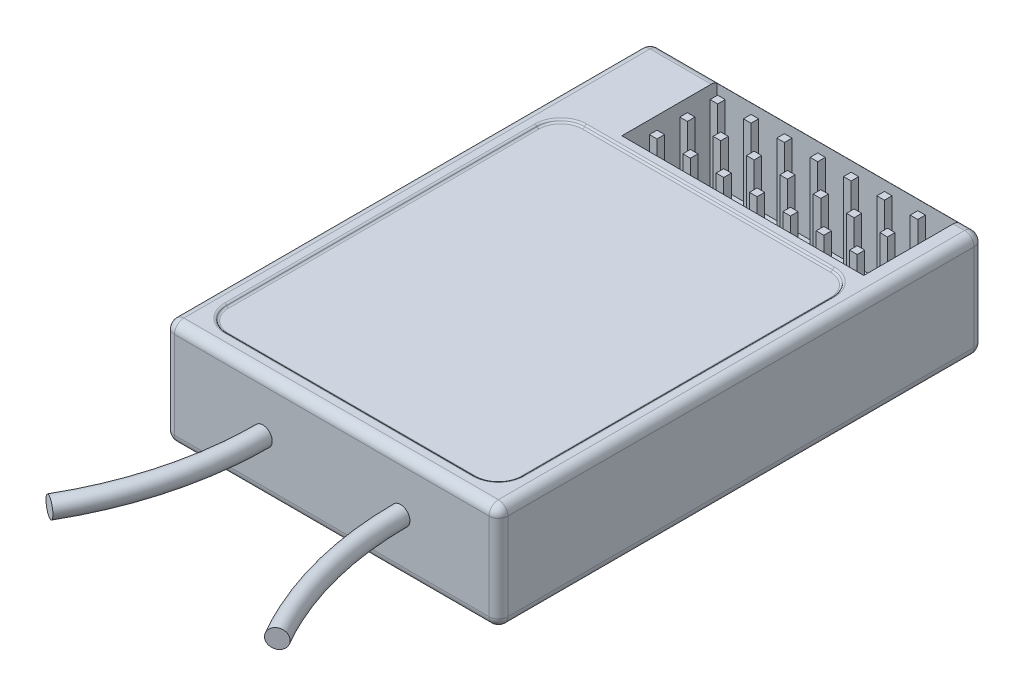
ISO-10303-21;
HEADER;
FILE_DESCRIPTION(('STEP AP214'),'2;1');
FILE_NAME('part.step','',(''),(''),'','','');
FILE_SCHEMA(('AUTOMOTIVE_DESIGN { 1 0 10303 214 1 1 1 1 }'));
ENDSEC;
DATA;
#1=APPLICATION_CONTEXT('core data for automotive mechanical design processes');
#2=APPLICATION_PROTOCOL_DEFINITION('international standard','automotive_design',2000,#1);
#3=PRODUCT_CONTEXT('',#1,'mechanical');
#4=PRODUCT('Part','Part','',(#3));
#5=PRODUCT_RELATED_PRODUCT_CATEGORY('part','',(#4));
#6=PRODUCT_DEFINITION_FORMATION('','',#4);
#7=PRODUCT_DEFINITION_CONTEXT('part definition',#1,'design');
#8=PRODUCT_DEFINITION('design','',#6,#7);
#9=PRODUCT_DEFINITION_SHAPE('','',#8);
#10=(LENGTH_UNIT() NAMED_UNIT(*) SI_UNIT(.MILLI.,.METRE.));
#11=(NAMED_UNIT(*) PLANE_ANGLE_UNIT() SI_UNIT($,.RADIAN.));
#12=(NAMED_UNIT(*) SI_UNIT($,.STERADIAN.) SOLID_ANGLE_UNIT());
#13=UNCERTAINTY_MEASURE_WITH_UNIT(LENGTH_MEASURE(1.E-05),#10,'distance_accuracy_value','');
#14=(GEOMETRIC_REPRESENTATION_CONTEXT(3) GLOBAL_UNCERTAINTY_ASSIGNED_CONTEXT((#13)) GLOBAL_UNIT_ASSIGNED_CONTEXT((#10,
#11,#12)) REPRESENTATION_CONTEXT('',''));
#15=CARTESIAN_POINT('',(0.,0.,0.));
#16=DIRECTION('',(0.,0.,1.));
#17=DIRECTION('',(1.,0.,0.));
#18=AXIS2_PLACEMENT_3D('',#15,#16,#17);
#19=CARTESIAN_POINT('',(2.0828,-3.175,-16.0147));
#20=DIRECTION('',(0.,1.,0.));
#21=DIRECTION('',(1.,0.,0.));
#22=AXIS2_PLACEMENT_3D('',#19,#20,#21);
#23=PLANE('',#22);
#24=DIRECTION('',(0.,0.,1.));
#25=VECTOR('',#24,1.);
#26=CARTESIAN_POINT('',(-8.0518,-3.175,-19.9898));
#27=LINE('',#26,#25);
#28=CARTESIAN_POINT('',(-8.0518,-3.175,-19.9898));
#29=VERTEX_POINT('',#28);
#30=CARTESIAN_POINT('',(-8.0518,-3.175,-19.52625));
#31=VERTEX_POINT('',#30);
#32=EDGE_CURVE('P0_E456',#29,#31,#27,.T.);
#33=ORIENTED_EDGE('',*,*,#32,.T.);
#34=DIRECTION('',(0.,0.,1.));
#35=VECTOR('',#34,1.);
#36=CARTESIAN_POINT('',(-8.0518,-3.175,-19.52625));
#37=LINE('',#36,#35);
#38=CARTESIAN_POINT('',(-8.0518,-3.175,-12.0396));
#39=VERTEX_POINT('',#38);
#40=EDGE_CURVE('P0_E559',#31,#39,#37,.T.);
#41=ORIENTED_EDGE('',*,*,#40,.T.);
#42=DIRECTION('',(1.,0.,0.));
#43=VECTOR('',#42,1.);
#44=CARTESIAN_POINT('',(-8.0518,-3.175,-12.0396));
#45=LINE('',#44,#43);
#46=CARTESIAN_POINT('',(12.2174,-3.175,-12.0396));
#47=VERTEX_POINT('',#46);
#48=EDGE_CURVE('P0_E395',#39,#47,#45,.T.);
#49=ORIENTED_EDGE('',*,*,#48,.T.);
#50=DIRECTION('',(0.,0.,-1.));
#51=VECTOR('',#50,1.);
#52=CARTESIAN_POINT('',(12.2174,-3.175,-12.0396));
#53=LINE('',#52,#51);
#54=CARTESIAN_POINT('',(12.2174,-3.175,-19.52625));
#55=VERTEX_POINT('',#54);
#56=EDGE_CURVE('P0_E622',#47,#55,#53,.T.);
#57=ORIENTED_EDGE('',*,*,#56,.T.);
#58=DIRECTION('',(0.,0.,-1.));
#59=VECTOR('',#58,1.);
#60=CARTESIAN_POINT('',(12.2174,-3.175,-19.52625));
#61=LINE('',#60,#59);
#62=CARTESIAN_POINT('',(12.2174,-3.175,-19.9898));
#63=VERTEX_POINT('',#62);
#64=EDGE_CURVE('P0_E27',#55,#63,#61,.T.);
#65=ORIENTED_EDGE('',*,*,#64,.T.);
#66=DIRECTION('',(-1.,0.,0.));
#67=VECTOR('',#66,1.);
#68=CARTESIAN_POINT('',(12.2174,-3.175,-19.9898));
#69=LINE('',#68,#67);
#70=EDGE_CURVE('P0_E11',#63,#29,#69,.T.);
#71=ORIENTED_EDGE('',*,*,#70,.T.);
#72=EDGE_LOOP('',(#33,#41,#49,#57,#65,#71));
#73=FACE_BOUND('',#72,.T.);
#74=ADVANCED_FACE('P0_F17',(#73),#23,.T.);
#75=CARTESIAN_POINT('',(12.2174,4.445,-19.9898));
#76=DIRECTION('',(0.,0.,-1.));
#77=DIRECTION('',(0.,-1.,0.));
#78=AXIS2_PLACEMENT_3D('',#75,#76,#77);
#79=PLANE('',#78);
#80=DIRECTION('',(1.,0.,0.));
#81=VECTOR('',#80,1.);
#82=CARTESIAN_POINT('',(-8.0518,4.29557946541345,-19.9898));
#83=LINE('',#82,#81);
#84=CARTESIAN_POINT('',(-8.0518,4.29557946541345,-19.9898));
#85=VERTEX_POINT('',#84);
#86=CARTESIAN_POINT('',(12.2174,4.29557946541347,-19.9898));
#87=VERTEX_POINT('',#86);
#88=EDGE_CURVE('P0_E450',#85,#87,#83,.T.);
#89=ORIENTED_EDGE('',*,*,#88,.F.);
#90=DIRECTION('',(0.,-1.,0.));
#91=VECTOR('',#90,1.);
#92=CARTESIAN_POINT('',(-8.0518,4.29557946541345,-19.9898));
#93=LINE('',#92,#91);
#94=EDGE_CURVE('P0_E451',#85,#29,#93,.T.);
#95=ORIENTED_EDGE('',*,*,#94,.T.);
#96=ORIENTED_EDGE('',*,*,#70,.F.);
#97=DIRECTION('',(0.,-1.,0.));
#98=VECTOR('',#97,1.);
#99=CARTESIAN_POINT('',(12.2174,4.29557946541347,-19.9898));
#100=LINE('',#99,#98);
#101=EDGE_CURVE('P0_E478',#87,#63,#100,.T.);
#102=ORIENTED_EDGE('',*,*,#101,.F.);
#103=EDGE_LOOP('',(#89,#95,#96,#102));
#104=FACE_BOUND('',#103,.T.);
#105=ADVANCED_FACE('P0_F1304',(#104),#79,.F.);
#106=CARTESIAN_POINT('',(12.2174,4.445,-12.0396));
#107=DIRECTION('',(1.,0.,0.));
#108=DIRECTION('',(0.,1.,0.));
#109=AXIS2_PLACEMENT_3D('',#106,#107,#108);
#110=PLANE('',#109);
#111=CARTESIAN_POINT('',(12.2174,3.65125,-19.52625));
#112=DIRECTION('',(1.,0.,0.));
#113=DIRECTION('',(0.,0.707106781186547,-0.707106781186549));
#114=AXIS2_PLACEMENT_3D('',#111,#112,#113);
#115=CIRCLE('',#114,0.79375);
#116=CARTESIAN_POINT('',(12.2174,4.445,-19.52625));
#117=VERTEX_POINT('',#116);
#118=EDGE_CURVE('P0_E503',#87,#117,#115,.T.);
#119=ORIENTED_EDGE('',*,*,#118,.F.);
#120=ORIENTED_EDGE('',*,*,#101,.T.);
#121=ORIENTED_EDGE('',*,*,#64,.F.);
#122=DIRECTION('',(0.,0.,-1.));
#123=VECTOR('',#122,1.);
#124=CARTESIAN_POINT('',(12.2174,-3.175,-12.0396));
#125=LINE('',#124,#123);
#126=CARTESIAN_POINT('',(12.2174,-3.175,-12.0396));
#127=VERTEX_POINT('',#126);
#128=EDGE_CURVE('P0_E551',#127,#55,#125,.T.);
#129=ORIENTED_EDGE('',*,*,#128,.F.);
#130=DIRECTION('',(0.,-1.,0.));
#131=VECTOR('',#130,1.);
#132=CARTESIAN_POINT('',(12.2174,4.445,-12.0396));
#133=LINE('',#132,#131);
#134=CARTESIAN_POINT('',(12.2174,4.445,-12.0396));
#135=VERTEX_POINT('',#134);
#136=EDGE_CURVE('P0_E455',#135,#127,#133,.T.);
#137=ORIENTED_EDGE('',*,*,#136,.F.);
#138=DIRECTION('',(0.,0.,1.));
#139=VECTOR('',#138,1.);
#140=CARTESIAN_POINT('',(12.2174,4.445,-19.52625));
#141=LINE('',#140,#139);
#142=EDGE_CURVE('P0_E516',#117,#135,#141,.T.);
#143=ORIENTED_EDGE('',*,*,#142,.F.);
#144=EDGE_LOOP('',(#119,#120,#121,#129,#137,#143));
#145=FACE_BOUND('',#144,.T.);
#146=ADVANCED_FACE('P0_F878',(#145),#110,.F.);
#147=CARTESIAN_POINT('',(-8.0518,4.445,-12.0396));
#148=DIRECTION('',(0.,0.,1.));
#149=DIRECTION('',(1.,0.,0.));
#150=AXIS2_PLACEMENT_3D('',#147,#148,#149);
#151=PLANE('',#150);
#152=DIRECTION('',(1.,0.,0.));
#153=VECTOR('',#152,1.);
#154=CARTESIAN_POINT('',(-8.0518,-3.175,-12.0396));
#155=LINE('',#154,#153);
#156=CARTESIAN_POINT('',(-8.0518,-3.175,-12.0396));
#157=VERTEX_POINT('',#156);
#158=EDGE_CURVE('P0_E46',#157,#127,#155,.T.);
#159=ORIENTED_EDGE('',*,*,#158,.F.);
#160=DIRECTION('',(0.,-1.,0.));
#161=VECTOR('',#160,1.);
#162=CARTESIAN_POINT('',(-8.0518,4.445,-12.0396));
#163=LINE('',#162,#161);
#164=CARTESIAN_POINT('',(-8.0518,4.445,-12.0396));
#165=VERTEX_POINT('',#164);
#166=EDGE_CURVE('P0_E512',#165,#157,#163,.T.);
#167=ORIENTED_EDGE('',*,*,#166,.F.);
#168=DIRECTION('',(-1.,0.,0.));
#169=VECTOR('',#168,1.);
#170=CARTESIAN_POINT('',(12.2174,4.445,-12.0396));
#171=LINE('',#170,#169);
#172=EDGE_CURVE('P0_E533',#135,#165,#171,.T.);
#173=ORIENTED_EDGE('',*,*,#172,.F.);
#174=ORIENTED_EDGE('',*,*,#136,.T.);
#175=EDGE_LOOP('',(#159,#167,#173,#174));
#176=FACE_BOUND('',#175,.T.);
#177=ADVANCED_FACE('P0_F880',(#176),#151,.F.);
#178=CARTESIAN_POINT('',(-8.0518,4.445,-19.9898));
#179=DIRECTION('',(-1.,0.,0.));
#180=DIRECTION('',(0.,0.,1.));
#181=AXIS2_PLACEMENT_3D('',#178,#179,#180);
#182=PLANE('',#181);
#183=CARTESIAN_POINT('',(-8.0518,3.65125,-19.52625));
#184=DIRECTION('',(-1.,0.,0.));
#185=DIRECTION('',(0.,0.707106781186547,-0.707106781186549));
#186=AXIS2_PLACEMENT_3D('',#183,#184,#185);
#187=CIRCLE('',#186,0.79375);
#188=CARTESIAN_POINT('',(-8.0518,4.445,-19.52625));
#189=VERTEX_POINT('',#188);
#190=EDGE_CURVE('P0_E720',#189,#85,#187,.T.);
#191=ORIENTED_EDGE('',*,*,#190,.F.);
#192=DIRECTION('',(0.,0.,-1.));
#193=VECTOR('',#192,1.);
#194=CARTESIAN_POINT('',(-8.0518,4.445,-12.0396));
#195=LINE('',#194,#193);
#196=EDGE_CURVE('P0_E537',#165,#189,#195,.T.);
#197=ORIENTED_EDGE('',*,*,#196,.F.);
#198=ORIENTED_EDGE('',*,*,#166,.T.);
#199=DIRECTION('',(0.,0.,1.));
#200=VECTOR('',#199,1.);
#201=CARTESIAN_POINT('',(-8.0518,-3.175,-19.52625));
#202=LINE('',#201,#200);
#203=EDGE_CURVE('P0_E40',#31,#157,#202,.T.);
#204=ORIENTED_EDGE('',*,*,#203,.F.);
#205=ORIENTED_EDGE('',*,*,#32,.F.);
#206=ORIENTED_EDGE('',*,*,#94,.F.);
#207=EDGE_LOOP('',(#191,#197,#198,#204,#205,#206));
#208=FACE_BOUND('',#207,.T.);
#209=ADVANCED_FACE('P0_F883',(#208),#182,.F.);
#210=CARTESIAN_POINT('',(13.97,4.445,0.));
#211=DIRECTION('',(1.,0.,0.));
#212=DIRECTION('',(0.,1.,0.));
#213=AXIS2_PLACEMENT_3D('',#210,#211,#212);
#214=PLANE('',#213);
#215=DIRECTION('',(0.,0.,1.));
#216=VECTOR('',#215,1.);
#217=CARTESIAN_POINT('',(13.97,-3.65125,-19.52625));
#218=LINE('',#217,#216);
#219=CARTESIAN_POINT('',(13.97,-3.65125,-19.52625));
#220=VERTEX_POINT('',#219);
#221=CARTESIAN_POINT('',(13.97,-3.65125,19.52625));
#222=VERTEX_POINT('',#221);
#223=EDGE_CURVE('P0_E411',#220,#222,#218,.T.);
#224=ORIENTED_EDGE('',*,*,#223,.F.);
#225=DIRECTION('',(0.,-1.,0.));
#226=VECTOR('',#225,1.);
#227=CARTESIAN_POINT('',(13.97,3.65125,-19.52625));
#228=LINE('',#227,#226);
#229=CARTESIAN_POINT('',(13.97,3.65125,-19.52625));
#230=VERTEX_POINT('',#229);
#231=EDGE_CURVE('P0_E509',#230,#220,#228,.T.);
#232=ORIENTED_EDGE('',*,*,#231,.F.);
#233=DIRECTION('',(0.,0.,-1.));
#234=VECTOR('',#233,1.);
#235=CARTESIAN_POINT('',(13.97,3.65125,19.52625));
#236=LINE('',#235,#234);
#237=CARTESIAN_POINT('',(13.97,3.65125,19.52625));
#238=VERTEX_POINT('',#237);
#239=EDGE_CURVE('P0_E449',#238,#230,#236,.T.);
#240=ORIENTED_EDGE('',*,*,#239,.F.);
#241=DIRECTION('',(0.,1.,0.));
#242=VECTOR('',#241,1.);
#243=CARTESIAN_POINT('',(13.97,-3.65125,19.52625));
#244=LINE('',#243,#242);
#245=EDGE_CURVE('P0_E417',#222,#238,#244,.T.);
#246=ORIENTED_EDGE('',*,*,#245,.F.);
#247=EDGE_LOOP('',(#224,#232,#240,#246));
#248=FACE_BOUND('',#247,.T.);
#249=ADVANCED_FACE('P0_F831',(#248),#214,.T.);
#250=CARTESIAN_POINT('',(0.,0.,-20.32));
#251=DIRECTION('',(0.,0.,1.));
#252=DIRECTION('',(1.,0.,0.));
#253=AXIS2_PLACEMENT_3D('',#250,#251,#252);
#254=PLANE('',#253);
#255=DIRECTION('',(1.,0.,0.));
#256=VECTOR('',#255,1.);
#257=CARTESIAN_POINT('',(-13.17625,-3.65125,-20.32));
#258=LINE('',#257,#256);
#259=CARTESIAN_POINT('',(-13.17625,-3.65125,-20.32));
#260=VERTEX_POINT('',#259);
#261=CARTESIAN_POINT('',(13.17625,-3.65125,-20.32));
#262=VERTEX_POINT('',#261);
#263=EDGE_CURVE('P0_E541',#260,#262,#258,.T.);
#264=ORIENTED_EDGE('',*,*,#263,.F.);
#265=DIRECTION('',(0.,-1.,0.));
#266=VECTOR('',#265,1.);
#267=CARTESIAN_POINT('',(-13.17625,3.65125,-20.32));
#268=LINE('',#267,#266);
#269=CARTESIAN_POINT('',(-13.17625,3.65125,-20.32));
#270=VERTEX_POINT('',#269);
#271=EDGE_CURVE('P0_E708',#270,#260,#268,.T.);
#272=ORIENTED_EDGE('',*,*,#271,.F.);
#273=DIRECTION('',(-1.,0.,0.));
#274=VECTOR('',#273,1.);
#275=CARTESIAN_POINT('',(13.17625,3.65125,-20.32));
#276=LINE('',#275,#274);
#277=CARTESIAN_POINT('',(13.17625,3.65125,-20.32));
#278=VERTEX_POINT('',#277);
#279=EDGE_CURVE('P0_E439',#278,#270,#276,.T.);
#280=ORIENTED_EDGE('',*,*,#279,.F.);
#281=DIRECTION('',(0.,1.,0.));
#282=VECTOR('',#281,1.);
#283=CARTESIAN_POINT('',(13.17625,-3.65125,-20.32));
#284=LINE('',#283,#282);
#285=EDGE_CURVE('P0_E21',#262,#278,#284,.T.);
#286=ORIENTED_EDGE('',*,*,#285,.F.);
#287=EDGE_LOOP('',(#264,#272,#280,#286));
#288=FACE_BOUND('',#287,.T.);
#289=ADVANCED_FACE('P0_F19',(#288),#254,.F.);
#290=CARTESIAN_POINT('',(13.17625,2.2225,-19.52625));
#291=DIRECTION('',(0.,1.,0.));
#292=DIRECTION('',(0.707106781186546,0.,-0.70710678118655));
#293=AXIS2_PLACEMENT_3D('',#290,#291,#292);
#294=CYLINDRICAL_SURFACE('',#293,0.79375);
#295=CARTESIAN_POINT('',(13.17625,-3.65125,-19.52625));
#296=DIRECTION('',(0.,-1.,0.));
#297=DIRECTION('',(0.707106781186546,0.,-0.707106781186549));
#298=AXIS2_PLACEMENT_3D('',#295,#296,#297);
#299=CIRCLE('',#298,0.79375);
#300=EDGE_CURVE('P0_E684',#262,#220,#299,.T.);
#301=ORIENTED_EDGE('',*,*,#300,.F.);
#302=ORIENTED_EDGE('',*,*,#285,.T.);
#303=CARTESIAN_POINT('',(13.17625,3.65125,-19.52625));
#304=DIRECTION('',(0.,1.,0.));
#305=DIRECTION('',(0.707106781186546,0.,-0.707106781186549));
#306=AXIS2_PLACEMENT_3D('',#303,#304,#305);
#307=CIRCLE('',#306,0.79375);
#308=EDGE_CURVE('P0_E420',#230,#278,#307,.T.);
#309=ORIENTED_EDGE('',*,*,#308,.F.);
#310=ORIENTED_EDGE('',*,*,#231,.T.);
#311=EDGE_LOOP('',(#301,#302,#309,#310));
#312=FACE_BOUND('',#311,.T.);
#313=ADVANCED_FACE('P0_F868',(#312),#294,.T.);
#314=CARTESIAN_POINT('',(13.17625,2.2225,19.52625));
#315=DIRECTION('',(0.,-1.,0.));
#316=DIRECTION('',(0.707106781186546,0.,0.70710678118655));
#317=AXIS2_PLACEMENT_3D('',#314,#315,#316);
#318=CYLINDRICAL_SURFACE('',#317,0.79375);
#319=CARTESIAN_POINT('',(13.17625,-3.65125,19.52625));
#320=DIRECTION('',(0.,-1.,0.));
#321=DIRECTION('',(0.707106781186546,0.,0.707106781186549));
#322=AXIS2_PLACEMENT_3D('',#319,#320,#321);
#323=CIRCLE('',#322,0.79375);
#324=CARTESIAN_POINT('',(13.17625,-3.65125,20.32));
#325=VERTEX_POINT('',#324);
#326=EDGE_CURVE('P0_E656',#222,#325,#323,.T.);
#327=ORIENTED_EDGE('',*,*,#326,.F.);
#328=ORIENTED_EDGE('',*,*,#245,.T.);
#329=CARTESIAN_POINT('',(13.17625,3.65125,19.52625));
#330=DIRECTION('',(0.,1.,0.));
#331=DIRECTION('',(0.707106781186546,0.,0.707106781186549));
#332=AXIS2_PLACEMENT_3D('',#329,#330,#331);
#333=CIRCLE('',#332,0.79375);
#334=CARTESIAN_POINT('',(13.17625,3.65125,20.32));
#335=VERTEX_POINT('',#334);
#336=EDGE_CURVE('P0_E582',#335,#238,#333,.T.);
#337=ORIENTED_EDGE('',*,*,#336,.F.);
#338=DIRECTION('',(0.,-1.,0.));
#339=VECTOR('',#338,1.);
#340=CARTESIAN_POINT('',(13.17625,3.65125,20.32));
#341=LINE('',#340,#339);
#342=EDGE_CURVE('P0_E495',#335,#325,#341,.T.);
#343=ORIENTED_EDGE('',*,*,#342,.T.);
#344=EDGE_LOOP('',(#327,#328,#337,#343));
#345=FACE_BOUND('',#344,.T.);
#346=ADVANCED_FACE('P0_F854',(#345),#318,.T.);
#347=CARTESIAN_POINT('',(-13.17625,3.65125,-19.52625));
#348=DIRECTION('',(0.,0.,1.));
#349=DIRECTION('',(1.,0.,0.));
#350=AXIS2_PLACEMENT_3D('',#347,#348,#349);
#351=SPHERICAL_SURFACE('',#350,0.79375);
#352=CARTESIAN_POINT('',(-13.17625,3.65125,-19.52625));
#353=DIRECTION('',(1.,0.,0.));
#354=DIRECTION('',(0.,0.,-1.));
#355=AXIS2_PLACEMENT_3D('',#352,#353,#354);
#356=CIRCLE('',#355,0.79375);
#357=CARTESIAN_POINT('',(-13.17625,4.445,-19.52625));
#358=VERTEX_POINT('',#357);
#359=EDGE_CURVE('P0_E443',#270,#358,#356,.T.);
#360=ORIENTED_EDGE('',*,*,#359,.F.);
#361=CARTESIAN_POINT('',(-13.17625,3.65125,-19.52625));
#362=DIRECTION('',(0.,1.,0.));
#363=DIRECTION('',(-0.707106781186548,0.,-0.707106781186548));
#364=AXIS2_PLACEMENT_3D('',#361,#362,#363);
#365=CIRCLE('',#364,0.79375);
#366=CARTESIAN_POINT('',(-13.97,3.65125,-19.52625));
#367=VERTEX_POINT('',#366);
#368=EDGE_CURVE('P0_E655',#270,#367,#365,.T.);
#369=ORIENTED_EDGE('',*,*,#368,.T.);
#370=CARTESIAN_POINT('',(-13.17625,3.65125,-19.52625));
#371=DIRECTION('',(0.,0.,1.));
#372=DIRECTION('',(0.,1.,0.));
#373=AXIS2_PLACEMENT_3D('',#370,#371,#372);
#374=CIRCLE('',#373,0.79375);
#375=EDGE_CURVE('P0_E583',#358,#367,#374,.T.);
#376=ORIENTED_EDGE('',*,*,#375,.F.);
#377=EDGE_LOOP('',(#360,#369,#376));
#378=FACE_BOUND('',#377,.T.);
#379=ADVANCED_FACE('P0_F1288',(#378),#351,.T.);
#380=CARTESIAN_POINT('',(13.17625,3.65125,-19.52625));
#381=DIRECTION('',(0.,0.,1.));
#382=DIRECTION('',(1.,0.,0.));
#383=AXIS2_PLACEMENT_3D('',#380,#381,#382);
#384=SPHERICAL_SURFACE('',#383,0.79375);
#385=CARTESIAN_POINT('',(13.17625,3.65125,-19.52625));
#386=DIRECTION('',(0.,0.,1.));
#387=DIRECTION('',(1.,0.,0.));
#388=AXIS2_PLACEMENT_3D('',#385,#386,#387);
#389=CIRCLE('',#388,0.79375);
#390=CARTESIAN_POINT('',(13.17625,4.445,-19.52625));
#391=VERTEX_POINT('',#390);
#392=EDGE_CURVE('P0_E410',#230,#391,#389,.T.);
#393=ORIENTED_EDGE('',*,*,#392,.F.);
#394=ORIENTED_EDGE('',*,*,#308,.T.);
#395=CARTESIAN_POINT('',(13.17625,3.65125,-19.52625));
#396=DIRECTION('',(-1.,0.,0.));
#397=DIRECTION('',(0.,1.,0.));
#398=AXIS2_PLACEMENT_3D('',#395,#396,#397);
#399=CIRCLE('',#398,0.79375);
#400=EDGE_CURVE('P0_E444',#391,#278,#399,.T.);
#401=ORIENTED_EDGE('',*,*,#400,.F.);
#402=EDGE_LOOP('',(#393,#394,#401));
#403=FACE_BOUND('',#402,.T.);
#404=ADVANCED_FACE('P0_F871',(#403),#384,.T.);
#405=CARTESIAN_POINT('',(13.17625,3.65125,19.52625));
#406=DIRECTION('',(0.,0.,1.));
#407=DIRECTION('',(1.,0.,0.));
#408=AXIS2_PLACEMENT_3D('',#405,#406,#407);
#409=SPHERICAL_SURFACE('',#408,0.79375);
#410=CARTESIAN_POINT('',(13.17625,3.65125,19.52625));
#411=DIRECTION('',(-1.,0.,0.));
#412=DIRECTION('',(0.,0.,1.));
#413=AXIS2_PLACEMENT_3D('',#410,#411,#412);
#414=CIRCLE('',#413,0.79375);
#415=CARTESIAN_POINT('',(13.17625,4.445,19.52625));
#416=VERTEX_POINT('',#415);
#417=EDGE_CURVE('P0_E409',#335,#416,#414,.T.);
#418=ORIENTED_EDGE('',*,*,#417,.F.);
#419=ORIENTED_EDGE('',*,*,#336,.T.);
#420=CARTESIAN_POINT('',(13.17625,3.65125,19.52625));
#421=DIRECTION('',(0.,0.,-1.));
#422=DIRECTION('',(0.,1.,0.));
#423=AXIS2_PLACEMENT_3D('',#420,#421,#422);
#424=CIRCLE('',#423,0.79375);
#425=EDGE_CURVE('P0_E445',#416,#238,#424,.T.);
#426=ORIENTED_EDGE('',*,*,#425,.F.);
#427=EDGE_LOOP('',(#418,#419,#426));
#428=FACE_BOUND('',#427,.T.);
#429=ADVANCED_FACE('P0_F827',(#428),#409,.T.);
#430=CARTESIAN_POINT('',(-13.17625,3.65125,19.52625));
#431=DIRECTION('',(0.,0.,1.));
#432=DIRECTION('',(1.,0.,0.));
#433=AXIS2_PLACEMENT_3D('',#430,#431,#432);
#434=SPHERICAL_SURFACE('',#433,0.79375);
#435=CARTESIAN_POINT('',(-13.17625,3.65125,19.52625));
#436=DIRECTION('',(0.,0.,-1.));
#437=DIRECTION('',(-1.,0.,0.));
#438=AXIS2_PLACEMENT_3D('',#435,#436,#437);
#439=CIRCLE('',#438,0.79375);
#440=CARTESIAN_POINT('',(-13.97,3.65125,19.52625));
#441=VERTEX_POINT('',#440);
#442=CARTESIAN_POINT('',(-13.17625,4.445,19.52625));
#443=VERTEX_POINT('',#442);
#444=EDGE_CURVE('P0_E579',#441,#443,#439,.T.);
#445=ORIENTED_EDGE('',*,*,#444,.F.);
#446=CARTESIAN_POINT('',(-13.17625,3.65125,19.52625));
#447=DIRECTION('',(0.,1.,0.));
#448=DIRECTION('',(-0.707106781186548,0.,0.707106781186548));
#449=AXIS2_PLACEMENT_3D('',#446,#447,#448);
#450=CIRCLE('',#449,0.79375);
#451=CARTESIAN_POINT('',(-13.17625,3.65125,20.32));
#452=VERTEX_POINT('',#451);
#453=EDGE_CURVE('P0_E499',#441,#452,#450,.T.);
#454=ORIENTED_EDGE('',*,*,#453,.T.);
#455=CARTESIAN_POINT('',(-13.17625,3.65125,19.52625));
#456=DIRECTION('',(1.,0.,0.));
#457=DIRECTION('',(0.,1.,0.));
#458=AXIS2_PLACEMENT_3D('',#455,#456,#457);
#459=CIRCLE('',#458,0.79375);
#460=EDGE_CURVE('P0_E406',#443,#452,#459,.T.);
#461=ORIENTED_EDGE('',*,*,#460,.F.);
#462=EDGE_LOOP('',(#445,#454,#461));
#463=FACE_BOUND('',#462,.T.);
#464=ADVANCED_FACE('P0_F892',(#463),#434,.T.);
#465=CARTESIAN_POINT('',(-13.17625,3.65125,0.));
#466=DIRECTION('',(0.,0.,1.));
#467=DIRECTION('',(-0.707106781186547,0.707106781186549,0.));
#468=AXIS2_PLACEMENT_3D('',#465,#466,#467);
#469=CYLINDRICAL_SURFACE('',#468,0.79375);
#470=ORIENTED_EDGE('',*,*,#375,.T.);
#471=DIRECTION('',(0.,0.,1.));
#472=VECTOR('',#471,1.);
#473=CARTESIAN_POINT('',(-13.97,3.65125,-19.52625));
#474=LINE('',#473,#472);
#475=EDGE_CURVE('P0_E718',#367,#441,#474,.T.);
#476=ORIENTED_EDGE('',*,*,#475,.T.);
#477=ORIENTED_EDGE('',*,*,#444,.T.);
#478=DIRECTION('',(0.,0.,-1.));
#479=VECTOR('',#478,1.);
#480=CARTESIAN_POINT('',(-13.17625,4.445,19.52625));
#481=LINE('',#480,#479);
#482=EDGE_CURVE('P0_E470',#443,#358,#481,.T.);
#483=ORIENTED_EDGE('',*,*,#482,.T.);
#484=EDGE_LOOP('',(#470,#476,#477,#483));
#485=FACE_BOUND('',#484,.T.);
#486=ADVANCED_FACE('P0_F887',(#485),#469,.T.);
#487=CARTESIAN_POINT('',(-6.985,3.65125,19.52625));
#488=DIRECTION('',(1.,0.,0.));
#489=DIRECTION('',(0.,0.707106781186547,0.707106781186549));
#490=AXIS2_PLACEMENT_3D('',#487,#488,#489);
#491=CYLINDRICAL_SURFACE('',#490,0.79375);
#492=ORIENTED_EDGE('',*,*,#460,.T.);
#493=DIRECTION('',(1.,0.,0.));
#494=VECTOR('',#493,1.);
#495=CARTESIAN_POINT('',(-13.17625,3.65125,20.32));
#496=LINE('',#495,#494);
#497=EDGE_CURVE('P0_E498',#452,#335,#496,.T.);
#498=ORIENTED_EDGE('',*,*,#497,.T.);
#499=ORIENTED_EDGE('',*,*,#417,.T.);
#500=DIRECTION('',(-1.,0.,0.));
#501=VECTOR('',#500,1.);
#502=CARTESIAN_POINT('',(13.17625,4.445,19.52625));
#503=LINE('',#502,#501);
#504=EDGE_CURVE('P0_E426',#416,#443,#503,.T.);
#505=ORIENTED_EDGE('',*,*,#504,.T.);
#506=EDGE_LOOP('',(#492,#498,#499,#505));
#507=FACE_BOUND('',#506,.T.);
#508=ADVANCED_FACE('P0_F846',(#507),#491,.T.);
#509=CARTESIAN_POINT('',(13.17625,3.65125,0.));
#510=DIRECTION('',(0.,0.,-1.));
#511=DIRECTION('',(0.707106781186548,0.707106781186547,0.));
#512=AXIS2_PLACEMENT_3D('',#509,#510,#511);
#513=CYLINDRICAL_SURFACE('',#512,0.79375);
#514=ORIENTED_EDGE('',*,*,#425,.T.);
#515=ORIENTED_EDGE('',*,*,#239,.T.);
#516=ORIENTED_EDGE('',*,*,#392,.T.);
#517=DIRECTION('',(0.,0.,1.));
#518=VECTOR('',#517,1.);
#519=CARTESIAN_POINT('',(13.17625,4.445,-19.52625));
#520=LINE('',#519,#518);
#521=EDGE_CURVE('P0_E421',#391,#416,#520,.T.);
#522=ORIENTED_EDGE('',*,*,#521,.T.);
#523=EDGE_LOOP('',(#514,#515,#516,#522));
#524=FACE_BOUND('',#523,.T.);
#525=ADVANCED_FACE('P0_F835',(#524),#513,.T.);
#526=CARTESIAN_POINT('',(-6.985,3.65125,-19.52625));
#527=DIRECTION('',(-1.,0.,0.));
#528=DIRECTION('',(0.,0.707106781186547,-0.707106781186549));
#529=AXIS2_PLACEMENT_3D('',#526,#527,#528);
#530=CYLINDRICAL_SURFACE('',#529,0.79375);
#531=ORIENTED_EDGE('',*,*,#118,.T.);
#532=DIRECTION('',(1.,0.,0.));
#533=VECTOR('',#532,1.);
#534=CARTESIAN_POINT('',(12.2174,4.445,-19.52625));
#535=LINE('',#534,#533);
#536=EDGE_CURVE('P0_E425',#117,#391,#535,.T.);
#537=ORIENTED_EDGE('',*,*,#536,.T.);
#538=ORIENTED_EDGE('',*,*,#400,.T.);
#539=ORIENTED_EDGE('',*,*,#279,.T.);
#540=ORIENTED_EDGE('',*,*,#359,.T.);
#541=DIRECTION('',(1.,0.,0.));
#542=VECTOR('',#541,1.);
#543=CARTESIAN_POINT('',(-13.17625,4.445,-19.52625));
#544=LINE('',#543,#542);
#545=EDGE_CURVE('P0_E474',#358,#189,#544,.T.);
#546=ORIENTED_EDGE('',*,*,#545,.T.);
#547=ORIENTED_EDGE('',*,*,#190,.T.);
#548=ORIENTED_EDGE('',*,*,#88,.T.);
#549=EDGE_LOOP('',(#531,#537,#538,#539,#540,#546,#547,#548));
#550=FACE_BOUND('',#549,.T.);
#551=ADVANCED_FACE('P0_F873',(#550),#530,.T.);
#552=CARTESIAN_POINT('',(13.97,-4.445,0.));
#553=DIRECTION('',(0.,-1.,0.));
#554=DIRECTION('',(0.,0.,-1.));
#555=AXIS2_PLACEMENT_3D('',#552,#553,#554);
#556=PLANE('',#555);
#557=DIRECTION('',(0.,0.,-1.));
#558=VECTOR('',#557,1.);
#559=CARTESIAN_POINT('',(13.17625,-4.445,19.52625));
#560=LINE('',#559,#558);
#561=CARTESIAN_POINT('',(13.17625,-4.445,19.52625));
#562=VERTEX_POINT('',#561);
#563=CARTESIAN_POINT('',(13.17625,-4.445,-19.52625));
#564=VERTEX_POINT('',#563);
#565=EDGE_CURVE('P0_E463',#562,#564,#560,.T.);
#566=ORIENTED_EDGE('',*,*,#565,.F.);
#567=DIRECTION('',(1.,0.,0.));
#568=VECTOR('',#567,1.);
#569=CARTESIAN_POINT('',(-13.17625,-4.445,19.52625));
#570=LINE('',#569,#568);
#571=CARTESIAN_POINT('',(-13.17625,-4.445,19.52625));
#572=VERTEX_POINT('',#571);
#573=EDGE_CURVE('P0_E617',#572,#562,#570,.T.);
#574=ORIENTED_EDGE('',*,*,#573,.F.);
#575=DIRECTION('',(0.,0.,1.));
#576=VECTOR('',#575,1.);
#577=CARTESIAN_POINT('',(-13.17625,-4.445,-19.52625));
#578=LINE('',#577,#576);
#579=CARTESIAN_POINT('',(-13.17625,-4.445,-19.52625));
#580=VERTEX_POINT('',#579);
#581=EDGE_CURVE('P0_E487',#580,#572,#578,.T.);
#582=ORIENTED_EDGE('',*,*,#581,.F.);
#583=DIRECTION('',(-1.,0.,0.));
#584=VECTOR('',#583,1.);
#585=CARTESIAN_POINT('',(13.17625,-4.445,-19.52625));
#586=LINE('',#585,#584);
#587=EDGE_CURVE('P0_E688',#564,#580,#586,.T.);
#588=ORIENTED_EDGE('',*,*,#587,.F.);
#589=EDGE_LOOP('',(#566,#574,#582,#588));
#590=FACE_BOUND('',#589,.T.);
#591=ADVANCED_FACE('P0_F1299',(#590),#556,.T.);
#592=CARTESIAN_POINT('',(0.,0.,20.32));
#593=DIRECTION('',(0.,0.,1.));
#594=DIRECTION('',(1.,0.,0.));
#595=AXIS2_PLACEMENT_3D('',#592,#593,#594);
#596=PLANE('',#595);
#597=DIRECTION('',(-1.,0.,0.));
#598=VECTOR('',#597,1.);
#599=CARTESIAN_POINT('',(13.17625,-3.65125,20.32));
#600=LINE('',#599,#598);
#601=CARTESIAN_POINT('',(-13.17625,-3.65125,20.32));
#602=VERTEX_POINT('',#601);
#603=EDGE_CURVE('P0_E393',#325,#602,#600,.T.);
#604=ORIENTED_EDGE('',*,*,#603,.F.);
#605=ORIENTED_EDGE('',*,*,#342,.F.);
#606=ORIENTED_EDGE('',*,*,#497,.F.);
#607=DIRECTION('',(0.,1.,0.));
#608=VECTOR('',#607,1.);
#609=CARTESIAN_POINT('',(-13.17625,-3.65125,20.32));
#610=LINE('',#609,#608);
#611=EDGE_CURVE('P0_E587',#602,#452,#610,.T.);
#612=ORIENTED_EDGE('',*,*,#611,.F.);
#613=EDGE_LOOP('',(#604,#605,#606,#612));
#614=FACE_BOUND('',#613,.T.);
#615=ADVANCED_FACE('P0_F852',(#614),#596,.T.);
#616=CARTESIAN_POINT('',(-13.17625,-2.2225,19.52625));
#617=DIRECTION('',(0.,1.,0.));
#618=DIRECTION('',(-0.707106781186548,0.,0.707106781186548));
#619=AXIS2_PLACEMENT_3D('',#616,#617,#618);
#620=CYLINDRICAL_SURFACE('',#619,0.79375);
#621=CARTESIAN_POINT('',(-13.17625,-3.65125,19.52625));
#622=DIRECTION('',(0.,-1.,0.));
#623=DIRECTION('',(-0.707106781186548,0.,0.707106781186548));
#624=AXIS2_PLACEMENT_3D('',#621,#622,#623);
#625=CIRCLE('',#624,0.79375);
#626=CARTESIAN_POINT('',(-13.97,-3.65125,19.52625));
#627=VERTEX_POINT('',#626);
#628=EDGE_CURVE('P0_E620',#602,#627,#625,.T.);
#629=ORIENTED_EDGE('',*,*,#628,.F.);
#630=ORIENTED_EDGE('',*,*,#611,.T.);
#631=ORIENTED_EDGE('',*,*,#453,.F.);
#632=DIRECTION('',(0.,-1.,0.));
#633=VECTOR('',#632,1.);
#634=CARTESIAN_POINT('',(-13.97,3.65125,19.52625));
#635=LINE('',#634,#633);
#636=EDGE_CURVE('P0_E740',#441,#627,#635,.T.);
#637=ORIENTED_EDGE('',*,*,#636,.T.);
#638=EDGE_LOOP('',(#629,#630,#631,#637));
#639=FACE_BOUND('',#638,.T.);
#640=ADVANCED_FACE('P0_F895',(#639),#620,.T.);
#641=CARTESIAN_POINT('',(-13.97,-4.445,0.));
#642=DIRECTION('',(-1.,0.,0.));
#643=DIRECTION('',(0.,0.,1.));
#644=AXIS2_PLACEMENT_3D('',#641,#642,#643);
#645=PLANE('',#644);
#646=DIRECTION('',(0.,0.,-1.));
#647=VECTOR('',#646,1.);
#648=CARTESIAN_POINT('',(-13.97,-3.65125,19.52625));
#649=LINE('',#648,#647);
#650=CARTESIAN_POINT('',(-13.97,-3.65125,-19.52625));
#651=VERTEX_POINT('',#650);
#652=EDGE_CURVE('P0_E504',#627,#651,#649,.T.);
#653=ORIENTED_EDGE('',*,*,#652,.F.);
#654=ORIENTED_EDGE('',*,*,#636,.F.);
#655=ORIENTED_EDGE('',*,*,#475,.F.);
#656=DIRECTION('',(0.,1.,0.));
#657=VECTOR('',#656,1.);
#658=CARTESIAN_POINT('',(-13.97,-3.65125,-19.52625));
#659=LINE('',#658,#657);
#660=EDGE_CURVE('P0_E651',#651,#367,#659,.T.);
#661=ORIENTED_EDGE('',*,*,#660,.F.);
#662=EDGE_LOOP('',(#653,#654,#655,#661));
#663=FACE_BOUND('',#662,.T.);
#664=ADVANCED_FACE('P0_F1272',(#663),#645,.T.);
#665=CARTESIAN_POINT('',(-13.17625,-2.2225,-19.52625));
#666=DIRECTION('',(0.,-1.,0.));
#667=DIRECTION('',(-0.707106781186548,0.,-0.707106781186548));
#668=AXIS2_PLACEMENT_3D('',#665,#666,#667);
#669=CYLINDRICAL_SURFACE('',#668,0.79375);
#670=CARTESIAN_POINT('',(-13.17625,-3.65125,-19.52625));
#671=DIRECTION('',(0.,-1.,0.));
#672=DIRECTION('',(-0.707106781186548,0.,-0.707106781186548));
#673=AXIS2_PLACEMENT_3D('',#670,#671,#672);
#674=CIRCLE('',#673,0.79375);
#675=EDGE_CURVE('P0_E405',#651,#260,#674,.T.);
#676=ORIENTED_EDGE('',*,*,#675,.F.);
#677=ORIENTED_EDGE('',*,*,#660,.T.);
#678=ORIENTED_EDGE('',*,*,#368,.F.);
#679=ORIENTED_EDGE('',*,*,#271,.T.);
#680=EDGE_LOOP('',(#676,#677,#678,#679));
#681=FACE_BOUND('',#680,.T.);
#682=ADVANCED_FACE('P0_F1276',(#681),#669,.T.);
#683=CARTESIAN_POINT('',(13.17625,-3.65125,19.52625));
#684=DIRECTION('',(0.,0.,1.));
#685=DIRECTION('',(1.,0.,0.));
#686=AXIS2_PLACEMENT_3D('',#683,#684,#685);
#687=SPHERICAL_SURFACE('',#686,0.79375);
#688=CARTESIAN_POINT('',(13.17625,-3.65125,19.52625));
#689=DIRECTION('',(0.,0.,-1.));
#690=DIRECTION('',(1.,0.,0.));
#691=AXIS2_PLACEMENT_3D('',#688,#689,#690);
#692=CIRCLE('',#691,0.79375);
#693=EDGE_CURVE('P0_E547',#222,#562,#692,.T.);
#694=ORIENTED_EDGE('',*,*,#693,.F.);
#695=ORIENTED_EDGE('',*,*,#326,.T.);
#696=CARTESIAN_POINT('',(13.17625,-3.65125,19.52625));
#697=DIRECTION('',(-1.,0.,0.));
#698=DIRECTION('',(0.,-1.,0.));
#699=AXIS2_PLACEMENT_3D('',#696,#697,#698);
#700=CIRCLE('',#699,0.79375);
#701=EDGE_CURVE('P0_E401',#562,#325,#700,.T.);
#702=ORIENTED_EDGE('',*,*,#701,.F.);
#703=EDGE_LOOP('',(#694,#695,#702));
#704=FACE_BOUND('',#703,.T.);
#705=ADVANCED_FACE('P0_F858',(#704),#687,.T.);
#706=CARTESIAN_POINT('',(-13.17625,-3.65125,19.52625));
#707=DIRECTION('',(0.,0.,1.));
#708=DIRECTION('',(1.,0.,0.));
#709=AXIS2_PLACEMENT_3D('',#706,#707,#708);
#710=SPHERICAL_SURFACE('',#709,0.79375);
#711=CARTESIAN_POINT('',(-13.17625,-3.65125,19.52625));
#712=DIRECTION('',(1.,0.,0.));
#713=DIRECTION('',(0.,0.,1.));
#714=AXIS2_PLACEMENT_3D('',#711,#712,#713);
#715=CIRCLE('',#714,0.79375);
#716=EDGE_CURVE('P0_E621',#602,#572,#715,.T.);
#717=ORIENTED_EDGE('',*,*,#716,.F.);
#718=ORIENTED_EDGE('',*,*,#628,.T.);
#719=CARTESIAN_POINT('',(-13.17625,-3.65125,19.52625));
#720=DIRECTION('',(0.,0.,-1.));
#721=DIRECTION('',(0.,-1.,0.));
#722=AXIS2_PLACEMENT_3D('',#719,#720,#721);
#723=CIRCLE('',#722,0.79375);
#724=EDGE_CURVE('P0_E508',#572,#627,#723,.T.);
#725=ORIENTED_EDGE('',*,*,#724,.F.);
#726=EDGE_LOOP('',(#717,#718,#725));
#727=FACE_BOUND('',#726,.T.);
#728=ADVANCED_FACE('P0_F902',(#727),#710,.T.);
#729=CARTESIAN_POINT('',(6.985,-3.65125,19.52625));
#730=DIRECTION('',(-1.,0.,0.));
#731=DIRECTION('',(0.,-0.707106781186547,0.707106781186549));
#732=AXIS2_PLACEMENT_3D('',#729,#730,#731);
#733=CYLINDRICAL_SURFACE('',#732,0.79375);
#734=ORIENTED_EDGE('',*,*,#701,.T.);
#735=ORIENTED_EDGE('',*,*,#603,.T.);
#736=ORIENTED_EDGE('',*,*,#716,.T.);
#737=ORIENTED_EDGE('',*,*,#573,.T.);
#738=EDGE_LOOP('',(#734,#735,#736,#737));
#739=FACE_BOUND('',#738,.T.);
#740=ADVANCED_FACE('P0_F904',(#739),#733,.T.);
#741=CARTESIAN_POINT('',(-13.17625,-3.65125,-19.52625));
#742=DIRECTION('',(0.,0.,1.));
#743=DIRECTION('',(1.,0.,0.));
#744=AXIS2_PLACEMENT_3D('',#741,#742,#743);
#745=SPHERICAL_SURFACE('',#744,0.79375);
#746=CARTESIAN_POINT('',(-13.17625,-3.65125,-19.52625));
#747=DIRECTION('',(0.,0.,1.));
#748=DIRECTION('',(-1.,0.,0.));
#749=AXIS2_PLACEMENT_3D('',#746,#747,#748);
#750=CIRCLE('',#749,0.79375);
#751=EDGE_CURVE('P0_E491',#651,#580,#750,.T.);
#752=ORIENTED_EDGE('',*,*,#751,.F.);
#753=ORIENTED_EDGE('',*,*,#675,.T.);
#754=CARTESIAN_POINT('',(-13.17625,-3.65125,-19.52625));
#755=DIRECTION('',(1.,0.,0.));
#756=DIRECTION('',(0.,-1.,0.));
#757=AXIS2_PLACEMENT_3D('',#754,#755,#756);
#758=CIRCLE('',#757,0.79375);
#759=EDGE_CURVE('P0_E415',#580,#260,#758,.T.);
#760=ORIENTED_EDGE('',*,*,#759,.F.);
#761=EDGE_LOOP('',(#752,#753,#760));
#762=FACE_BOUND('',#761,.T.);
#763=ADVANCED_FACE('P0_F1332',(#762),#745,.T.);
#764=CARTESIAN_POINT('',(-13.17625,-3.65125,0.));
#765=DIRECTION('',(0.,0.,-1.));
#766=DIRECTION('',(-0.707106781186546,-0.707106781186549,0.));
#767=AXIS2_PLACEMENT_3D('',#764,#765,#766);
#768=CYLINDRICAL_SURFACE('',#767,0.79375);
#769=ORIENTED_EDGE('',*,*,#724,.T.);
#770=ORIENTED_EDGE('',*,*,#652,.T.);
#771=ORIENTED_EDGE('',*,*,#751,.T.);
#772=ORIENTED_EDGE('',*,*,#581,.T.);
#773=EDGE_LOOP('',(#769,#770,#771,#772));
#774=FACE_BOUND('',#773,.T.);
#775=ADVANCED_FACE('P0_F1355',(#774),#768,.T.);
#776=CARTESIAN_POINT('',(13.17625,-3.65125,-19.52625));
#777=DIRECTION('',(0.,0.,1.));
#778=DIRECTION('',(1.,0.,0.));
#779=AXIS2_PLACEMENT_3D('',#776,#777,#778);
#780=SPHERICAL_SURFACE('',#779,0.79375);
#781=CARTESIAN_POINT('',(13.17625,-3.65125,-19.52625));
#782=DIRECTION('',(-1.,0.,0.));
#783=DIRECTION('',(0.,0.,-1.));
#784=AXIS2_PLACEMENT_3D('',#781,#782,#783);
#785=CIRCLE('',#784,0.79375);
#786=EDGE_CURVE('P0_E735',#262,#564,#785,.T.);
#787=ORIENTED_EDGE('',*,*,#786,.F.);
#788=ORIENTED_EDGE('',*,*,#300,.T.);
#789=CARTESIAN_POINT('',(13.17625,-3.65125,-19.52625));
#790=DIRECTION('',(0.,0.,1.));
#791=DIRECTION('',(0.,-1.,0.));
#792=AXIS2_PLACEMENT_3D('',#789,#790,#791);
#793=CIRCLE('',#792,0.79375);
#794=EDGE_CURVE('P0_E416',#564,#220,#793,.T.);
#795=ORIENTED_EDGE('',*,*,#794,.F.);
#796=EDGE_LOOP('',(#787,#788,#795));
#797=FACE_BOUND('',#796,.T.);
#798=ADVANCED_FACE('P0_F865',(#797),#780,.T.);
#799=CARTESIAN_POINT('',(6.985,-3.65125,-19.52625));
#800=DIRECTION('',(1.,0.,0.));
#801=DIRECTION('',(0.,-0.707106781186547,-0.707106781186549));
#802=AXIS2_PLACEMENT_3D('',#799,#800,#801);
#803=CYLINDRICAL_SURFACE('',#802,0.79375);
#804=ORIENTED_EDGE('',*,*,#759,.T.);
#805=ORIENTED_EDGE('',*,*,#263,.T.);
#806=ORIENTED_EDGE('',*,*,#786,.T.);
#807=ORIENTED_EDGE('',*,*,#587,.T.);
#808=EDGE_LOOP('',(#804,#805,#806,#807));
#809=FACE_BOUND('',#808,.T.);
#810=ADVANCED_FACE('P0_F1320',(#809),#803,.T.);
#811=CARTESIAN_POINT('',(13.17625,-3.65125,0.));
#812=DIRECTION('',(0.,0.,-1.));
#813=DIRECTION('',(0.707106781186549,-0.707106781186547,0.));
#814=AXIS2_PLACEMENT_3D('',#811,#812,#813);
#815=CYLINDRICAL_SURFACE('',#814,0.79375);
#816=ORIENTED_EDGE('',*,*,#693,.T.);
#817=ORIENTED_EDGE('',*,*,#565,.T.);
#818=ORIENTED_EDGE('',*,*,#794,.T.);
#819=ORIENTED_EDGE('',*,*,#223,.T.);
#820=EDGE_LOOP('',(#816,#817,#818,#819));
#821=FACE_BOUND('',#820,.T.);
#822=ADVANCED_FACE('P0_F861',(#821),#815,.T.);
#823=CARTESIAN_POINT('',(0.213922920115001,-3.556,-0.580135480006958));
#824=DIRECTION('',(0.,1.,0.));
#825=DIRECTION('',(1.,0.,0.));
#826=AXIS2_PLACEMENT_3D('',#823,#824,#825);
#827=PLANE('',#826);
#828=DIRECTION('',(0.,0.,1.));
#829=VECTOR('',#828,1.);
#830=CARTESIAN_POINT('',(13.17625,-3.556,-19.52625));
#831=LINE('',#830,#829);
#832=CARTESIAN_POINT('',(13.17625,-3.556,-19.52625));
#833=VERTEX_POINT('',#832);
#834=CARTESIAN_POINT('',(13.17625,-3.556,19.52625));
#835=VERTEX_POINT('',#834);
#836=EDGE_CURVE('P0_E567',#833,#835,#831,.T.);
#837=ORIENTED_EDGE('',*,*,#836,.F.);
#838=DIRECTION('',(1.,0.,0.));
#839=VECTOR('',#838,1.);
#840=CARTESIAN_POINT('',(12.2174,-3.556,-19.52625));
#841=LINE('',#840,#839);
#842=CARTESIAN_POINT('',(12.2174,-3.556,-19.52625));
#843=VERTEX_POINT('',#842);
#844=EDGE_CURVE('P0_E431',#843,#833,#841,.T.);
#845=ORIENTED_EDGE('',*,*,#844,.F.);
#846=DIRECTION('',(0.,0.,-1.));
#847=VECTOR('',#846,1.);
#848=CARTESIAN_POINT('',(12.2174,-3.556,-12.0396));
#849=LINE('',#848,#847);
#850=CARTESIAN_POINT('',(12.2174,-3.556,-12.0396));
#851=VERTEX_POINT('',#850);
#852=EDGE_CURVE('P0_E626',#851,#843,#849,.T.);
#853=ORIENTED_EDGE('',*,*,#852,.F.);
#854=DIRECTION('',(1.,0.,0.));
#855=VECTOR('',#854,1.);
#856=CARTESIAN_POINT('',(-8.0518,-3.556,-12.0396));
#857=LINE('',#856,#855);
#858=CARTESIAN_POINT('',(-8.0518,-3.556,-12.0396));
#859=VERTEX_POINT('',#858);
#860=EDGE_CURVE('P0_E399',#859,#851,#857,.T.);
#861=ORIENTED_EDGE('',*,*,#860,.F.);
#862=DIRECTION('',(0.,0.,1.));
#863=VECTOR('',#862,1.);
#864=CARTESIAN_POINT('',(-8.0518,-3.556,-19.52625));
#865=LINE('',#864,#863);
#866=CARTESIAN_POINT('',(-8.0518,-3.556,-19.52625));
#867=VERTEX_POINT('',#866);
#868=EDGE_CURVE('P0_E555',#867,#859,#865,.T.);
#869=ORIENTED_EDGE('',*,*,#868,.F.);
#870=DIRECTION('',(1.,0.,0.));
#871=VECTOR('',#870,1.);
#872=CARTESIAN_POINT('',(-13.17625,-3.556,-19.52625));
#873=LINE('',#872,#871);
#874=CARTESIAN_POINT('',(-13.17625,-3.556,-19.52625));
#875=VERTEX_POINT('',#874);
#876=EDGE_CURVE('P0_E485',#875,#867,#873,.T.);
#877=ORIENTED_EDGE('',*,*,#876,.F.);
#878=DIRECTION('',(0.,0.,-1.));
#879=VECTOR('',#878,1.);
#880=CARTESIAN_POINT('',(-13.17625,-3.556,19.52625));
#881=LINE('',#880,#879);
#882=CARTESIAN_POINT('',(-13.17625,-3.556,19.52625));
#883=VERTEX_POINT('',#882);
#884=EDGE_CURVE('P0_E668',#883,#875,#881,.T.);
#885=ORIENTED_EDGE('',*,*,#884,.F.);
#886=DIRECTION('',(-1.,0.,0.));
#887=VECTOR('',#886,1.);
#888=CARTESIAN_POINT('',(13.17625,-3.556,19.52625));
#889=LINE('',#888,#887);
#890=EDGE_CURVE('P0_E676',#835,#883,#889,.T.);
#891=ORIENTED_EDGE('',*,*,#890,.F.);
#892=EDGE_LOOP('',(#837,#845,#853,#861,#869,#877,#885,#891));
#893=FACE_BOUND('',#892,.T.);
#894=ADVANCED_FACE('P0_F1340',(#893),#827,.T.);
#895=CARTESIAN_POINT('',(0.213922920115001,-3.175,-0.580135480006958));
#896=DIRECTION('',(0.,1.,0.));
#897=DIRECTION('',(1.,0.,0.));
#898=AXIS2_PLACEMENT_3D('',#895,#896,#897);
#899=PLANE('',#898);
#900=DIRECTION('',(-1.,0.,0.));
#901=VECTOR('',#900,1.);
#902=CARTESIAN_POINT('',(13.17625,-3.175,19.52625));
#903=LINE('',#902,#901);
#904=CARTESIAN_POINT('',(13.17625,-3.175,19.52625));
#905=VERTEX_POINT('',#904);
#906=CARTESIAN_POINT('',(-13.17625,-3.175,19.52625));
#907=VERTEX_POINT('',#906);
#908=EDGE_CURVE('P0_E633',#905,#907,#903,.T.);
#909=ORIENTED_EDGE('',*,*,#908,.T.);
#910=DIRECTION('',(0.,0.,-1.));
#911=VECTOR('',#910,1.);
#912=CARTESIAN_POINT('',(-13.17625,-3.175,19.52625));
#913=LINE('',#912,#911);
#914=CARTESIAN_POINT('',(-13.17625,-3.175,-19.52625));
#915=VERTEX_POINT('',#914);
#916=EDGE_CURVE('P0_E675',#907,#915,#913,.T.);
#917=ORIENTED_EDGE('',*,*,#916,.T.);
#918=DIRECTION('',(1.,0.,0.));
#919=VECTOR('',#918,1.);
#920=CARTESIAN_POINT('',(-13.17625,-3.175,-19.52625));
#921=LINE('',#920,#919);
#922=EDGE_CURVE('P0_E482',#915,#31,#921,.T.);
#923=ORIENTED_EDGE('',*,*,#922,.T.);
#924=ORIENTED_EDGE('',*,*,#203,.T.);
#925=ORIENTED_EDGE('',*,*,#158,.T.);
#926=ORIENTED_EDGE('',*,*,#128,.T.);
#927=DIRECTION('',(1.,0.,0.));
#928=VECTOR('',#927,1.);
#929=CARTESIAN_POINT('',(12.2174,-3.175,-19.52625));
#930=LINE('',#929,#928);
#931=CARTESIAN_POINT('',(13.17625,-3.175,-19.52625));
#932=VERTEX_POINT('',#931);
#933=EDGE_CURVE('P0_E427',#55,#932,#930,.T.);
#934=ORIENTED_EDGE('',*,*,#933,.T.);
#935=DIRECTION('',(0.,0.,1.));
#936=VECTOR('',#935,1.);
#937=CARTESIAN_POINT('',(13.17625,-3.175,-19.52625));
#938=LINE('',#937,#936);
#939=EDGE_CURVE('P0_E546',#932,#905,#938,.T.);
#940=ORIENTED_EDGE('',*,*,#939,.T.);
#941=EDGE_LOOP('',(#909,#917,#923,#924,#925,#926,#934,#940));
#942=FACE_BOUND('',#941,.T.);
#943=ADVANCED_FACE('P0_F1372',(#942),#899,.F.);
#944=CARTESIAN_POINT('',(13.17625,-3.556,-19.52625));
#945=DIRECTION('',(1.,0.,0.));
#946=DIRECTION('',(0.,1.,0.));
#947=AXIS2_PLACEMENT_3D('',#944,#945,#946);
#948=PLANE('',#947);
#949=ORIENTED_EDGE('',*,*,#939,.F.);
#950=DIRECTION('',(0.,1.,0.));
#951=VECTOR('',#950,1.);
#952=CARTESIAN_POINT('',(13.17625,-3.556,-19.52625));
#953=LINE('',#952,#951);
#954=EDGE_CURVE('P0_E542',#833,#932,#953,.T.);
#955=ORIENTED_EDGE('',*,*,#954,.F.);
#956=ORIENTED_EDGE('',*,*,#836,.T.);
#957=DIRECTION('',(0.,1.,0.));
#958=VECTOR('',#957,1.);
#959=CARTESIAN_POINT('',(13.17625,-3.556,19.52625));
#960=LINE('',#959,#958);
#961=EDGE_CURVE('P0_E680',#835,#905,#960,.T.);
#962=ORIENTED_EDGE('',*,*,#961,.T.);
#963=EDGE_LOOP('',(#949,#955,#956,#962));
#964=FACE_BOUND('',#963,.T.);
#965=ADVANCED_FACE('P0_F1376',(#964),#948,.F.);
#966=CARTESIAN_POINT('',(12.2174,-3.556,-19.52625));
#967=DIRECTION('',(0.,0.,-1.));
#968=DIRECTION('',(0.,-1.,0.));
#969=AXIS2_PLACEMENT_3D('',#966,#967,#968);
#970=PLANE('',#969);
#971=ORIENTED_EDGE('',*,*,#933,.F.);
#972=DIRECTION('',(0.,1.,0.));
#973=VECTOR('',#972,1.);
#974=CARTESIAN_POINT('',(12.2174,-3.556,-19.52625));
#975=LINE('',#974,#973);
#976=EDGE_CURVE('P0_E432',#843,#55,#975,.T.);
#977=ORIENTED_EDGE('',*,*,#976,.F.);
#978=ORIENTED_EDGE('',*,*,#844,.T.);
#979=ORIENTED_EDGE('',*,*,#954,.T.);
#980=EDGE_LOOP('',(#971,#977,#978,#979));
#981=FACE_BOUND('',#980,.T.);
#982=ADVANCED_FACE('P0_F1535',(#981),#970,.F.);
#983=CARTESIAN_POINT('',(12.2174,-3.556,-12.0396));
#984=DIRECTION('',(-1.,0.,0.));
#985=DIRECTION('',(0.,0.,1.));
#986=AXIS2_PLACEMENT_3D('',#983,#984,#985);
#987=PLANE('',#986);
#988=ORIENTED_EDGE('',*,*,#56,.F.);
#989=DIRECTION('',(0.,1.,0.));
#990=VECTOR('',#989,1.);
#991=CARTESIAN_POINT('',(12.2174,-3.556,-12.0396));
#992=LINE('',#991,#990);
#993=EDGE_CURVE('P0_E627',#851,#47,#992,.T.);
#994=ORIENTED_EDGE('',*,*,#993,.F.);
#995=ORIENTED_EDGE('',*,*,#852,.T.);
#996=ORIENTED_EDGE('',*,*,#976,.T.);
#997=EDGE_LOOP('',(#988,#994,#995,#996));
#998=FACE_BOUND('',#997,.T.);
#999=ADVANCED_FACE('P0_F1539',(#998),#987,.F.);
#1000=CARTESIAN_POINT('',(-8.0518,-3.556,-12.0396));
#1001=DIRECTION('',(0.,0.,-1.));
#1002=DIRECTION('',(0.,-1.,0.));
#1003=AXIS2_PLACEMENT_3D('',#1000,#1001,#1002);
#1004=PLANE('',#1003);
#1005=ORIENTED_EDGE('',*,*,#48,.F.);
#1006=DIRECTION('',(0.,1.,0.));
#1007=VECTOR('',#1006,1.);
#1008=CARTESIAN_POINT('',(-8.0518,-3.556,-12.0396));
#1009=LINE('',#1008,#1007);
#1010=EDGE_CURVE('P0_E400',#859,#39,#1009,.T.);
#1011=ORIENTED_EDGE('',*,*,#1010,.F.);
#1012=ORIENTED_EDGE('',*,*,#860,.T.);
#1013=ORIENTED_EDGE('',*,*,#993,.T.);
#1014=EDGE_LOOP('',(#1005,#1011,#1012,#1013));
#1015=FACE_BOUND('',#1014,.T.);
#1016=ADVANCED_FACE('P0_F1548',(#1015),#1004,.F.);
#1017=CARTESIAN_POINT('',(-8.0518,-3.556,-19.52625));
#1018=DIRECTION('',(1.,0.,0.));
#1019=DIRECTION('',(0.,1.,0.));
#1020=AXIS2_PLACEMENT_3D('',#1017,#1018,#1019);
#1021=PLANE('',#1020);
#1022=ORIENTED_EDGE('',*,*,#40,.F.);
#1023=DIRECTION('',(0.,1.,0.));
#1024=VECTOR('',#1023,1.);
#1025=CARTESIAN_POINT('',(-8.0518,-3.556,-19.52625));
#1026=LINE('',#1025,#1024);
#1027=EDGE_CURVE('P0_E660',#867,#31,#1026,.T.);
#1028=ORIENTED_EDGE('',*,*,#1027,.F.);
#1029=ORIENTED_EDGE('',*,*,#868,.T.);
#1030=ORIENTED_EDGE('',*,*,#1010,.T.);
#1031=EDGE_LOOP('',(#1022,#1028,#1029,#1030));
#1032=FACE_BOUND('',#1031,.T.);
#1033=ADVANCED_FACE('P0_F1424',(#1032),#1021,.F.);
#1034=CARTESIAN_POINT('',(-13.17625,-3.556,-19.52625));
#1035=DIRECTION('',(0.,0.,-1.));
#1036=DIRECTION('',(0.,-1.,0.));
#1037=AXIS2_PLACEMENT_3D('',#1034,#1035,#1036);
#1038=PLANE('',#1037);
#1039=ORIENTED_EDGE('',*,*,#922,.F.);
#1040=DIRECTION('',(0.,1.,0.));
#1041=VECTOR('',#1040,1.);
#1042=CARTESIAN_POINT('',(-13.17625,-3.556,-19.52625));
#1043=LINE('',#1042,#1041);
#1044=EDGE_CURVE('P0_E486',#875,#915,#1043,.T.);
#1045=ORIENTED_EDGE('',*,*,#1044,.F.);
#1046=ORIENTED_EDGE('',*,*,#876,.T.);
#1047=ORIENTED_EDGE('',*,*,#1027,.T.);
#1048=EDGE_LOOP('',(#1039,#1045,#1046,#1047));
#1049=FACE_BOUND('',#1048,.T.);
#1050=ADVANCED_FACE('P0_F1419',(#1049),#1038,.F.);
#1051=CARTESIAN_POINT('',(-13.17625,-3.556,19.52625));
#1052=DIRECTION('',(-1.,0.,0.));
#1053=DIRECTION('',(0.,0.,1.));
#1054=AXIS2_PLACEMENT_3D('',#1051,#1052,#1053);
#1055=PLANE('',#1054);
#1056=ORIENTED_EDGE('',*,*,#916,.F.);
#1057=DIRECTION('',(0.,1.,0.));
#1058=VECTOR('',#1057,1.);
#1059=CARTESIAN_POINT('',(-13.17625,-3.556,19.52625));
#1060=LINE('',#1059,#1058);
#1061=EDGE_CURVE('P0_E671',#883,#907,#1060,.T.);
#1062=ORIENTED_EDGE('',*,*,#1061,.F.);
#1063=ORIENTED_EDGE('',*,*,#884,.T.);
#1064=ORIENTED_EDGE('',*,*,#1044,.T.);
#1065=EDGE_LOOP('',(#1056,#1062,#1063,#1064));
#1066=FACE_BOUND('',#1065,.T.);
#1067=ADVANCED_FACE('P0_F1423',(#1066),#1055,.F.);
#1068=CARTESIAN_POINT('',(13.17625,-3.556,19.52625));
#1069=DIRECTION('',(0.,0.,1.));
#1070=DIRECTION('',(1.,0.,0.));
#1071=AXIS2_PLACEMENT_3D('',#1068,#1069,#1070);
#1072=PLANE('',#1071);
#1073=ORIENTED_EDGE('',*,*,#908,.F.);
#1074=ORIENTED_EDGE('',*,*,#961,.F.);
#1075=ORIENTED_EDGE('',*,*,#890,.T.);
#1076=ORIENTED_EDGE('',*,*,#1061,.T.);
#1077=EDGE_LOOP('',(#1073,#1074,#1075,#1076));
#1078=FACE_BOUND('',#1077,.T.);
#1079=ADVANCED_FACE('P0_F1434',(#1078),#1072,.F.);
#1080=CARTESIAN_POINT('',(0.,4.2465625,3.743325));
#1081=DIRECTION('',(0.,1.,0.));
#1082=DIRECTION('',(1.,0.,0.));
#1083=AXIS2_PLACEMENT_3D('',#1080,#1081,#1082);
#1084=PLANE('',#1083);
#1085=DIRECTION('',(0.,0.,-1.));
#1086=VECTOR('',#1085,1.);
#1087=CARTESIAN_POINT('',(-12.2158125,4.2465625,16.73225));
#1088=LINE('',#1087,#1086);
#1089=CARTESIAN_POINT('',(-12.2158125,4.2465625,16.73225));
#1090=VERTEX_POINT('',#1089);
#1091=CARTESIAN_POINT('',(-12.2158125,4.2465625,-9.2456));
#1092=VERTEX_POINT('',#1091);
#1093=EDGE_CURVE('P0_E563',#1090,#1092,#1088,.T.);
#1094=ORIENTED_EDGE('',*,*,#1093,.F.);
#1095=CARTESIAN_POINT('',(-10.38225,4.2465625,16.73225));
#1096=DIRECTION('',(0.,-1.,0.));
#1097=DIRECTION('',(-0.707106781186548,0.,0.707106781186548));
#1098=AXIS2_PLACEMENT_3D('',#1095,#1096,#1097);
#1099=CIRCLE('',#1098,1.8335625);
#1100=CARTESIAN_POINT('',(-10.38225,4.2465625,18.5658125));
#1101=VERTEX_POINT('',#1100);
#1102=EDGE_CURVE('P0_E647',#1101,#1090,#1099,.T.);
#1103=ORIENTED_EDGE('',*,*,#1102,.F.);
#1104=DIRECTION('',(-1.,0.,0.));
#1105=VECTOR('',#1104,1.);
#1106=CARTESIAN_POINT('',(10.38225,4.2465625,18.5658125));
#1107=LINE('',#1106,#1105);
#1108=CARTESIAN_POINT('',(10.38225,4.2465625,18.5658125));
#1109=VERTEX_POINT('',#1108);
#1110=EDGE_CURVE('P0_E350',#1109,#1101,#1107,.T.);
#1111=ORIENTED_EDGE('',*,*,#1110,.F.);
#1112=CARTESIAN_POINT('',(10.38225,4.2465625,16.73225));
#1113=DIRECTION('',(0.,-1.,0.));
#1114=DIRECTION('',(0.707106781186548,0.,0.707106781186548));
#1115=AXIS2_PLACEMENT_3D('',#1112,#1113,#1114);
#1116=CIRCLE('',#1115,1.8335625);
#1117=CARTESIAN_POINT('',(12.2158125,4.2465625,16.73225));
#1118=VERTEX_POINT('',#1117);
#1119=EDGE_CURVE('P0_E349',#1118,#1109,#1116,.T.);
#1120=ORIENTED_EDGE('',*,*,#1119,.F.);
#1121=DIRECTION('',(0.,0.,1.));
#1122=VECTOR('',#1121,1.);
#1123=CARTESIAN_POINT('',(12.2158125,4.2465625,-9.2456));
#1124=LINE('',#1123,#1122);
#1125=CARTESIAN_POINT('',(12.2158125,4.2465625,-9.2456));
#1126=VERTEX_POINT('',#1125);
#1127=EDGE_CURVE('P0_E345',#1126,#1118,#1124,.T.);
#1128=ORIENTED_EDGE('',*,*,#1127,.F.);
#1129=CARTESIAN_POINT('',(10.38225,4.2465625,-9.2456));
#1130=DIRECTION('',(0.,-1.,0.));
#1131=DIRECTION('',(0.707106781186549,0.,-0.707106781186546));
#1132=AXIS2_PLACEMENT_3D('',#1129,#1130,#1131);
#1133=CIRCLE('',#1132,1.8335625);
#1134=CARTESIAN_POINT('',(10.38225,4.2465625,-11.0791625));
#1135=VERTEX_POINT('',#1134);
#1136=EDGE_CURVE('P0_E522',#1135,#1126,#1133,.T.);
#1137=ORIENTED_EDGE('',*,*,#1136,.F.);
#1138=DIRECTION('',(1.,0.,0.));
#1139=VECTOR('',#1138,1.);
#1140=CARTESIAN_POINT('',(-10.38225,4.2465625,-11.0791625));
#1141=LINE('',#1140,#1139);
#1142=CARTESIAN_POINT('',(-10.38225,4.2465625,-11.0791625));
#1143=VERTEX_POINT('',#1142);
#1144=EDGE_CURVE('P0_E532',#1143,#1135,#1141,.T.);
#1145=ORIENTED_EDGE('',*,*,#1144,.F.);
#1146=CARTESIAN_POINT('',(-10.38225,4.2465625,-9.2456));
#1147=DIRECTION('',(0.,-1.,0.));
#1148=DIRECTION('',(-0.707106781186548,0.,-0.707106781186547));
#1149=AXIS2_PLACEMENT_3D('',#1146,#1147,#1148);
#1150=CIRCLE('',#1149,1.8335625);
#1151=EDGE_CURVE('P0_E531',#1092,#1143,#1150,.T.);
#1152=ORIENTED_EDGE('',*,*,#1151,.F.);
#1153=EDGE_LOOP('',(#1094,#1103,#1111,#1120,#1128,#1137,#1145,#1152));
#1154=FACE_BOUND('',#1153,.T.);
#1155=ADVANCED_FACE('P0_F1430',(#1154),#1084,.T.);
#1156=CARTESIAN_POINT('',(12.2158125,4.445,10.2377875));
#1157=DIRECTION('',(0.,0.,-1.));
#1158=DIRECTION('',(0.707106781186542,-0.707106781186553,0.));
#1159=AXIS2_PLACEMENT_3D('',#1156,#1157,#1158);
#1160=CYLINDRICAL_SURFACE('',#1159,0.1984375);
#1161=DIRECTION('',(0.,0.,1.));
#1162=VECTOR('',#1161,1.);
#1163=CARTESIAN_POINT('',(12.3876644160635,4.34578125,-9.2456));
#1164=LINE('',#1163,#1162);
#1165=CARTESIAN_POINT('',(12.3876644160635,4.34578125,-9.2456));
#1166=VERTEX_POINT('',#1165);
#1167=CARTESIAN_POINT('',(12.3876644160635,4.34578125,16.73225));
#1168=VERTEX_POINT('',#1167);
#1169=EDGE_CURVE('P0_E343',#1166,#1168,#1164,.T.);
#1170=ORIENTED_EDGE('',*,*,#1169,.F.);
#1171=CARTESIAN_POINT('',(12.2158125,4.445,-9.2456));
#1172=DIRECTION('',(0.,0.,-1.));
#1173=DIRECTION('',(1.,0.,0.));
#1174=AXIS2_PLACEMENT_3D('',#1171,#1172,#1173);
#1175=CIRCLE('',#1174,0.1984375);
#1176=EDGE_CURVE('P0_E526',#1166,#1126,#1175,.T.);
#1177=ORIENTED_EDGE('',*,*,#1176,.T.);
#1178=ORIENTED_EDGE('',*,*,#1127,.T.);
#1179=CARTESIAN_POINT('',(12.2158125,4.445,16.73225));
#1180=DIRECTION('',(0.,0.,-1.));
#1181=DIRECTION('',(1.,0.,0.));
#1182=AXIS2_PLACEMENT_3D('',#1179,#1180,#1181);
#1183=CIRCLE('',#1182,0.1984375);
#1184=EDGE_CURVE('P0_E338',#1168,#1118,#1183,.T.);
#1185=ORIENTED_EDGE('',*,*,#1184,.F.);
#1186=EDGE_LOOP('',(#1170,#1177,#1178,#1185));
#1187=FACE_BOUND('',#1186,.T.);
#1188=ADVANCED_FACE('P0_F340',(#1187),#1160,.F.);
#1189=CARTESIAN_POINT('',(10.38225,4.445,16.73225));
#1190=DIRECTION('',(0.,1.,0.));
#1191=DIRECTION('',(0.,0.,1.));
#1192=AXIS2_PLACEMENT_3D('',#1189,#1190,#1191);
#1193=TOROIDAL_SURFACE('',#1192,1.8335625,0.1984375);
#1194=CARTESIAN_POINT('',(10.38225,4.34578125,16.73225));
#1195=DIRECTION('',(0.,-1.,0.));
#1196=DIRECTION('',(0.707106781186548,0.,0.707106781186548));
#1197=AXIS2_PLACEMENT_3D('',#1194,#1195,#1196);
#1198=CIRCLE('',#1197,2.00541441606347);
#1199=CARTESIAN_POINT('',(10.38225,4.34578125,18.7376644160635));
#1200=VERTEX_POINT('',#1199);
#1201=EDGE_CURVE('P0_E353',#1168,#1200,#1198,.T.);
#1202=ORIENTED_EDGE('',*,*,#1201,.F.);
#1203=ORIENTED_EDGE('',*,*,#1184,.T.);
#1204=ORIENTED_EDGE('',*,*,#1119,.T.);
#1205=CARTESIAN_POINT('',(10.38225,4.445,18.5658125));
#1206=DIRECTION('',(1.,0.,0.));
#1207=DIRECTION('',(0.,0.,1.));
#1208=AXIS2_PLACEMENT_3D('',#1205,#1206,#1207);
#1209=CIRCLE('',#1208,0.1984375);
#1210=EDGE_CURVE('P0_E356',#1200,#1109,#1209,.T.);
#1211=ORIENTED_EDGE('',*,*,#1210,.F.);
#1212=EDGE_LOOP('',(#1202,#1203,#1204,#1211));
#1213=FACE_BOUND('',#1212,.T.);
#1214=ADVANCED_FACE('P0_F354',(#1213),#1193,.F.);
#1215=CARTESIAN_POINT('',(-5.191125,4.445,18.5658125));
#1216=DIRECTION('',(1.,0.,0.));
#1217=DIRECTION('',(0.,-0.707106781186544,0.707106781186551));
#1218=AXIS2_PLACEMENT_3D('',#1215,#1216,#1217);
#1219=CYLINDRICAL_SURFACE('',#1218,0.1984375);
#1220=DIRECTION('',(-1.,0.,0.));
#1221=VECTOR('',#1220,1.);
#1222=CARTESIAN_POINT('',(10.38225,4.34578125,18.7376644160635));
#1223=LINE('',#1222,#1221);
#1224=CARTESIAN_POINT('',(-10.38225,4.34578125,18.7376644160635));
#1225=VERTEX_POINT('',#1224);
#1226=EDGE_CURVE('P0_E521',#1200,#1225,#1223,.T.);
#1227=ORIENTED_EDGE('',*,*,#1226,.F.);
#1228=ORIENTED_EDGE('',*,*,#1210,.T.);
#1229=ORIENTED_EDGE('',*,*,#1110,.T.);
#1230=CARTESIAN_POINT('',(-10.38225,4.445,18.5658125));
#1231=DIRECTION('',(1.,0.,0.));
#1232=DIRECTION('',(0.,0.,1.));
#1233=AXIS2_PLACEMENT_3D('',#1230,#1231,#1232);
#1234=CIRCLE('',#1233,0.1984375);
#1235=EDGE_CURVE('P0_E578',#1225,#1101,#1234,.T.);
#1236=ORIENTED_EDGE('',*,*,#1235,.F.);
#1237=EDGE_LOOP('',(#1227,#1228,#1229,#1236));
#1238=FACE_BOUND('',#1237,.T.);
#1239=ADVANCED_FACE('P0_F1414',(#1238),#1219,.F.);
#1240=CARTESIAN_POINT('',(-10.38225,4.445,16.73225));
#1241=DIRECTION('',(0.,1.,0.));
#1242=DIRECTION('',(0.,0.,1.));
#1243=AXIS2_PLACEMENT_3D('',#1240,#1241,#1242);
#1244=TOROIDAL_SURFACE('',#1243,1.8335625,0.1984375);
#1245=CARTESIAN_POINT('',(-10.38225,4.34578125,16.73225));
#1246=DIRECTION('',(0.,-1.,0.));
#1247=DIRECTION('',(-0.707106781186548,0.,0.707106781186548));
#1248=AXIS2_PLACEMENT_3D('',#1245,#1246,#1247);
#1249=CIRCLE('',#1248,2.00541441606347);
#1250=CARTESIAN_POINT('',(-12.3876644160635,4.34578125,16.73225));
#1251=VERTEX_POINT('',#1250);
#1252=EDGE_CURVE('P0_E520',#1225,#1251,#1249,.T.);
#1253=ORIENTED_EDGE('',*,*,#1252,.F.);
#1254=ORIENTED_EDGE('',*,*,#1235,.T.);
#1255=ORIENTED_EDGE('',*,*,#1102,.T.);
#1256=CARTESIAN_POINT('',(-12.2158125,4.445,16.73225));
#1257=DIRECTION('',(0.,0.,1.));
#1258=DIRECTION('',(-1.,0.,0.));
#1259=AXIS2_PLACEMENT_3D('',#1256,#1257,#1258);
#1260=CIRCLE('',#1259,0.1984375);
#1261=EDGE_CURVE('P0_E609',#1251,#1090,#1260,.T.);
#1262=ORIENTED_EDGE('',*,*,#1261,.F.);
#1263=EDGE_LOOP('',(#1253,#1254,#1255,#1262));
#1264=FACE_BOUND('',#1263,.T.);
#1265=ADVANCED_FACE('P0_F1443',(#1264),#1244,.F.);
#1266=CARTESIAN_POINT('',(-13.97,4.445,0.));
#1267=DIRECTION('',(0.,1.,0.));
#1268=DIRECTION('',(1.,0.,0.));
#1269=AXIS2_PLACEMENT_3D('',#1266,#1267,#1268);
#1270=PLANE('',#1269);
#1271=DIRECTION('',(0.,0.,1.));
#1272=VECTOR('',#1271,1.);
#1273=CARTESIAN_POINT('',(-12.559516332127,4.445,-9.2456));
#1274=LINE('',#1273,#1272);
#1275=CARTESIAN_POINT('',(-12.559516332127,4.445,-9.2456));
#1276=VERTEX_POINT('',#1275);
#1277=CARTESIAN_POINT('',(-12.559516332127,4.445,16.73225));
#1278=VERTEX_POINT('',#1277);
#1279=EDGE_CURVE('P0_E438',#1276,#1278,#1274,.T.);
#1280=ORIENTED_EDGE('',*,*,#1279,.F.);
#1281=CARTESIAN_POINT('',(-10.38225,4.445,-9.2456));
#1282=DIRECTION('',(0.,1.,0.));
#1283=DIRECTION('',(-0.707106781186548,0.,-0.707106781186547));
#1284=AXIS2_PLACEMENT_3D('',#1281,#1282,#1283);
#1285=CIRCLE('',#1284,2.17726633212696);
#1286=CARTESIAN_POINT('',(-10.38225,4.445,-11.422866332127));
#1287=VERTEX_POINT('',#1286);
#1288=EDGE_CURVE('P0_E437',#1287,#1276,#1285,.T.);
#1289=ORIENTED_EDGE('',*,*,#1288,.F.);
#1290=DIRECTION('',(-1.,0.,0.));
#1291=VECTOR('',#1290,1.);
#1292=CARTESIAN_POINT('',(10.38225,4.445,-11.422866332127));
#1293=LINE('',#1292,#1291);
#1294=CARTESIAN_POINT('',(10.38225,4.445,-11.422866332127));
#1295=VERTEX_POINT('',#1294);
#1296=EDGE_CURVE('P0_E664',#1295,#1287,#1293,.T.);
#1297=ORIENTED_EDGE('',*,*,#1296,.F.);
#1298=CARTESIAN_POINT('',(10.38225,4.445,-9.2456));
#1299=DIRECTION('',(0.,1.,0.));
#1300=DIRECTION('',(0.707106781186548,0.,-0.707106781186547));
#1301=AXIS2_PLACEMENT_3D('',#1298,#1299,#1300);
#1302=CIRCLE('',#1301,2.17726633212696);
#1303=CARTESIAN_POINT('',(12.559516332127,4.445,-9.2456));
#1304=VERTEX_POINT('',#1303);
#1305=EDGE_CURVE('P0_E389',#1304,#1295,#1302,.T.);
#1306=ORIENTED_EDGE('',*,*,#1305,.F.);
#1307=DIRECTION('',(0.,0.,-1.));
#1308=VECTOR('',#1307,1.);
#1309=CARTESIAN_POINT('',(12.559516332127,4.445,16.73225));
#1310=LINE('',#1309,#1308);
#1311=CARTESIAN_POINT('',(12.559516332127,4.445,16.73225));
#1312=VERTEX_POINT('',#1311);
#1313=EDGE_CURVE('P0_E375',#1312,#1304,#1310,.T.);
#1314=ORIENTED_EDGE('',*,*,#1313,.F.);
#1315=CARTESIAN_POINT('',(10.38225,4.445,16.73225));
#1316=DIRECTION('',(0.,1.,0.));
#1317=DIRECTION('',(0.707106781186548,0.,0.707106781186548));
#1318=AXIS2_PLACEMENT_3D('',#1315,#1316,#1317);
#1319=CIRCLE('',#1318,2.17726633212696);
#1320=CARTESIAN_POINT('',(10.38225,4.445,18.909516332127));
#1321=VERTEX_POINT('',#1320);
#1322=EDGE_CURVE('P0_E364',#1321,#1312,#1319,.T.);
#1323=ORIENTED_EDGE('',*,*,#1322,.F.);
#1324=DIRECTION('',(1.,0.,0.));
#1325=VECTOR('',#1324,1.);
#1326=CARTESIAN_POINT('',(-10.38225,4.445,18.909516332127));
#1327=LINE('',#1326,#1325);
#1328=CARTESIAN_POINT('',(-10.38225,4.445,18.909516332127));
#1329=VERTEX_POINT('',#1328);
#1330=EDGE_CURVE('P0_E572',#1329,#1321,#1327,.T.);
#1331=ORIENTED_EDGE('',*,*,#1330,.F.);
#1332=CARTESIAN_POINT('',(-10.38225,4.445,16.73225));
#1333=DIRECTION('',(0.,1.,0.));
#1334=DIRECTION('',(-0.707106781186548,0.,0.707106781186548));
#1335=AXIS2_PLACEMENT_3D('',#1332,#1333,#1334);
#1336=CIRCLE('',#1335,2.17726633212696);
#1337=EDGE_CURVE('P0_E517',#1278,#1329,#1336,.T.);
#1338=ORIENTED_EDGE('',*,*,#1337,.F.);
#1339=EDGE_LOOP('',(#1280,#1289,#1297,#1306,#1314,#1323,#1331,#1338));
#1340=FACE_BOUND('',#1339,.T.);
#1341=ORIENTED_EDGE('',*,*,#545,.F.);
#1342=ORIENTED_EDGE('',*,*,#482,.F.);
#1343=ORIENTED_EDGE('',*,*,#504,.F.);
#1344=ORIENTED_EDGE('',*,*,#521,.F.);
#1345=ORIENTED_EDGE('',*,*,#536,.F.);
#1346=ORIENTED_EDGE('',*,*,#142,.T.);
#1347=ORIENTED_EDGE('',*,*,#172,.T.);
#1348=ORIENTED_EDGE('',*,*,#196,.T.);
#1349=EDGE_LOOP('',(#1341,#1342,#1343,#1344,#1345,#1346,#1347,#1348));
#1350=FACE_BOUND('',#1349,.T.);
#1351=ADVANCED_FACE('P0_F844',(#1340,#1350),#1270,.T.);
#1352=CARTESIAN_POINT('',(-12.2158125,4.445,-2.7511375));
#1353=DIRECTION('',(0.,0.,1.));
#1354=DIRECTION('',(-0.707106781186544,-0.707106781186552,0.));
#1355=AXIS2_PLACEMENT_3D('',#1352,#1353,#1354);
#1356=CYLINDRICAL_SURFACE('',#1355,0.1984375);
#1357=DIRECTION('',(0.,0.,-1.));
#1358=VECTOR('',#1357,1.);
#1359=CARTESIAN_POINT('',(-12.3876644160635,4.34578125,16.73225));
#1360=LINE('',#1359,#1358);
#1361=CARTESIAN_POINT('',(-12.3876644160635,4.34578125,-9.2456));
#1362=VERTEX_POINT('',#1361);
#1363=EDGE_CURVE('P0_E464',#1251,#1362,#1360,.T.);
#1364=ORIENTED_EDGE('',*,*,#1363,.F.);
#1365=ORIENTED_EDGE('',*,*,#1261,.T.);
#1366=ORIENTED_EDGE('',*,*,#1093,.T.);
#1367=CARTESIAN_POINT('',(-12.2158125,4.445,-9.2456));
#1368=DIRECTION('',(0.,0.,-1.));
#1369=DIRECTION('',(0.,-1.,0.));
#1370=AXIS2_PLACEMENT_3D('',#1367,#1368,#1369);
#1371=CIRCLE('',#1370,0.1984375);
#1372=EDGE_CURVE('P0_E528',#1092,#1362,#1371,.T.);
#1373=ORIENTED_EDGE('',*,*,#1372,.T.);
#1374=EDGE_LOOP('',(#1364,#1365,#1366,#1373));
#1375=FACE_BOUND('',#1374,.T.);
#1376=ADVANCED_FACE('P0_F1489',(#1375),#1356,.F.);
#1377=CARTESIAN_POINT('',(-10.38225,4.445,-9.2456));
#1378=DIRECTION('',(0.,1.,0.));
#1379=DIRECTION('',(0.,0.,1.));
#1380=AXIS2_PLACEMENT_3D('',#1377,#1378,#1379);
#1381=TOROIDAL_SURFACE('',#1380,1.8335625,0.1984375);
#1382=CARTESIAN_POINT('',(-10.38225,4.34578125,-9.2456));
#1383=DIRECTION('',(0.,-1.,0.));
#1384=DIRECTION('',(-0.707106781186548,0.,-0.707106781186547));
#1385=AXIS2_PLACEMENT_3D('',#1382,#1383,#1384);
#1386=CIRCLE('',#1385,2.00541441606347);
#1387=CARTESIAN_POINT('',(-10.38225,4.34578125,-11.2510144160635));
#1388=VERTEX_POINT('',#1387);
#1389=EDGE_CURVE('P0_E481',#1362,#1388,#1386,.T.);
#1390=ORIENTED_EDGE('',*,*,#1389,.F.);
#1391=ORIENTED_EDGE('',*,*,#1372,.F.);
#1392=ORIENTED_EDGE('',*,*,#1151,.T.);
#1393=CARTESIAN_POINT('',(-10.38225,4.445,-11.0791625));
#1394=DIRECTION('',(-1.,0.,0.));
#1395=DIRECTION('',(0.,0.,-1.));
#1396=AXIS2_PLACEMENT_3D('',#1393,#1394,#1395);
#1397=CIRCLE('',#1396,0.1984375);
#1398=EDGE_CURVE('P0_E712',#1388,#1143,#1397,.T.);
#1399=ORIENTED_EDGE('',*,*,#1398,.F.);
#1400=EDGE_LOOP('',(#1390,#1391,#1392,#1399));
#1401=FACE_BOUND('',#1400,.T.);
#1402=ADVANCED_FACE('P0_F1500',(#1401),#1381,.F.);
#1403=CARTESIAN_POINT('',(5.191125,4.445,-11.0791625));
#1404=DIRECTION('',(-1.,0.,0.));
#1405=DIRECTION('',(0.,-0.707106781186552,-0.707106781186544));
#1406=AXIS2_PLACEMENT_3D('',#1403,#1404,#1405);
#1407=CYLINDRICAL_SURFACE('',#1406,0.1984375);
#1408=DIRECTION('',(1.,0.,0.));
#1409=VECTOR('',#1408,1.);
#1410=CARTESIAN_POINT('',(-10.38225,4.34578125,-11.2510144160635));
#1411=LINE('',#1410,#1409);
#1412=CARTESIAN_POINT('',(10.38225,4.34578125,-11.2510144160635));
#1413=VERTEX_POINT('',#1412);
#1414=EDGE_CURVE('P0_E644',#1388,#1413,#1411,.T.);
#1415=ORIENTED_EDGE('',*,*,#1414,.F.);
#1416=ORIENTED_EDGE('',*,*,#1398,.T.);
#1417=ORIENTED_EDGE('',*,*,#1144,.T.);
#1418=CARTESIAN_POINT('',(10.38225,4.445,-11.0791625));
#1419=DIRECTION('',(-1.,0.,0.));
#1420=DIRECTION('',(0.,0.,-1.));
#1421=AXIS2_PLACEMENT_3D('',#1418,#1419,#1420);
#1422=CIRCLE('',#1421,0.1984375);
#1423=EDGE_CURVE('P0_E527',#1413,#1135,#1422,.T.);
#1424=ORIENTED_EDGE('',*,*,#1423,.F.);
#1425=EDGE_LOOP('',(#1415,#1416,#1417,#1424));
#1426=FACE_BOUND('',#1425,.T.);
#1427=ADVANCED_FACE('P0_F1495',(#1426),#1407,.F.);
#1428=CARTESIAN_POINT('',(10.38225,4.445,-9.2456));
#1429=DIRECTION('',(0.,1.,0.));
#1430=DIRECTION('',(0.,0.,1.));
#1431=AXIS2_PLACEMENT_3D('',#1428,#1429,#1430);
#1432=TOROIDAL_SURFACE('',#1431,1.8335625,0.1984375);
#1433=CARTESIAN_POINT('',(10.38225,4.34578125,-9.2456));
#1434=DIRECTION('',(0.,-1.,0.));
#1435=DIRECTION('',(0.707106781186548,0.,-0.707106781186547));
#1436=AXIS2_PLACEMENT_3D('',#1433,#1434,#1435);
#1437=CIRCLE('',#1436,2.00541441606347);
#1438=EDGE_CURVE('P0_E381',#1413,#1166,#1437,.T.);
#1439=ORIENTED_EDGE('',*,*,#1438,.F.);
#1440=ORIENTED_EDGE('',*,*,#1423,.T.);
#1441=ORIENTED_EDGE('',*,*,#1136,.T.);
#1442=ORIENTED_EDGE('',*,*,#1176,.F.);
#1443=EDGE_LOOP('',(#1439,#1440,#1441,#1442));
#1444=FACE_BOUND('',#1443,.T.);
#1445=ADVANCED_FACE('P0_F1499',(#1444),#1432,.F.);
#1446=CARTESIAN_POINT('',(-10.38225,4.2465625,16.73225));
#1447=DIRECTION('',(0.,-1.,0.));
#1448=DIRECTION('',(0.,0.,-1.));
#1449=AXIS2_PLACEMENT_3D('',#1446,#1447,#1448);
#1450=TOROIDAL_SURFACE('',#1449,2.17726633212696,0.1984375);
#1451=CARTESIAN_POINT('',(-12.559516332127,4.2465625,16.73225));
#1452=DIRECTION('',(0.,0.,-1.));
#1453=DIRECTION('',(0.,1.,0.));
#1454=AXIS2_PLACEMENT_3D('',#1451,#1452,#1453);
#1455=CIRCLE('',#1454,0.1984375);
#1456=EDGE_CURVE('P0_E469',#1278,#1251,#1455,.T.);
#1457=ORIENTED_EDGE('',*,*,#1456,.F.);
#1458=ORIENTED_EDGE('',*,*,#1337,.T.);
#1459=CARTESIAN_POINT('',(-10.38225,4.2465625,18.909516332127));
#1460=DIRECTION('',(1.,0.,0.));
#1461=DIRECTION('',(0.,0.5,-0.866025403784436));
#1462=AXIS2_PLACEMENT_3D('',#1459,#1460,#1461);
#1463=CIRCLE('',#1462,0.1984375);
#1464=EDGE_CURVE('P0_E363',#1225,#1329,#1463,.T.);
#1465=ORIENTED_EDGE('',*,*,#1464,.F.);
#1466=ORIENTED_EDGE('',*,*,#1252,.T.);
#1467=EDGE_LOOP('',(#1457,#1458,#1465,#1466));
#1468=FACE_BOUND('',#1467,.T.);
#1469=ADVANCED_FACE('P0_F1570',(#1468),#1450,.T.);
#1470=CARTESIAN_POINT('',(-5.191125,4.2465625,18.909516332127));
#1471=DIRECTION('',(-1.,0.,0.));
#1472=DIRECTION('',(0.,0.866025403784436,-0.5));
#1473=AXIS2_PLACEMENT_3D('',#1470,#1471,#1472);
#1474=CYLINDRICAL_SURFACE('',#1473,0.1984375);
#1475=ORIENTED_EDGE('',*,*,#1464,.T.);
#1476=ORIENTED_EDGE('',*,*,#1330,.T.);
#1477=CARTESIAN_POINT('',(10.38225,4.2465625,18.909516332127));
#1478=DIRECTION('',(1.,0.,0.));
#1479=DIRECTION('',(0.,0.499999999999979,-0.866025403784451));
#1480=AXIS2_PLACEMENT_3D('',#1477,#1478,#1479);
#1481=CIRCLE('',#1480,0.1984375);
#1482=EDGE_CURVE('P0_E374',#1200,#1321,#1481,.T.);
#1483=ORIENTED_EDGE('',*,*,#1482,.F.);
#1484=ORIENTED_EDGE('',*,*,#1226,.T.);
#1485=EDGE_LOOP('',(#1475,#1476,#1483,#1484));
#1486=FACE_BOUND('',#1485,.T.);
#1487=ADVANCED_FACE('P0_F1574',(#1486),#1474,.T.);
#1488=CARTESIAN_POINT('',(10.38225,4.2465625,16.73225));
#1489=DIRECTION('',(0.,-1.,0.));
#1490=DIRECTION('',(0.,0.,-1.));
#1491=AXIS2_PLACEMENT_3D('',#1488,#1489,#1490);
#1492=TOROIDAL_SURFACE('',#1491,2.17726633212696,0.1984375);
#1493=ORIENTED_EDGE('',*,*,#1482,.T.);
#1494=ORIENTED_EDGE('',*,*,#1322,.T.);
#1495=CARTESIAN_POINT('',(12.559516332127,4.2465625,16.73225));
#1496=DIRECTION('',(0.,0.,-1.));
#1497=DIRECTION('',(-0.866025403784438,0.5,0.));
#1498=AXIS2_PLACEMENT_3D('',#1495,#1496,#1497);
#1499=CIRCLE('',#1498,0.1984375);
#1500=EDGE_CURVE('P0_E370',#1168,#1312,#1499,.T.);
#1501=ORIENTED_EDGE('',*,*,#1500,.F.);
#1502=ORIENTED_EDGE('',*,*,#1201,.T.);
#1503=EDGE_LOOP('',(#1493,#1494,#1501,#1502));
#1504=FACE_BOUND('',#1503,.T.);
#1505=ADVANCED_FACE('P0_F377',(#1504),#1492,.T.);
#1506=CARTESIAN_POINT('',(12.559516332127,4.2465625,10.2377875));
#1507=DIRECTION('',(0.,0.,1.));
#1508=DIRECTION('',(-0.5,0.866025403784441,0.));
#1509=AXIS2_PLACEMENT_3D('',#1506,#1507,#1508);
#1510=CYLINDRICAL_SURFACE('',#1509,0.1984375);
#1511=ORIENTED_EDGE('',*,*,#1500,.T.);
#1512=ORIENTED_EDGE('',*,*,#1313,.T.);
#1513=CARTESIAN_POINT('',(12.559516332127,4.2465625,-9.2456));
#1514=DIRECTION('',(0.,0.,-1.));
#1515=DIRECTION('',(-0.866025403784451,0.499999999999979,0.));
#1516=AXIS2_PLACEMENT_3D('',#1513,#1514,#1515);
#1517=CIRCLE('',#1516,0.1984375);
#1518=EDGE_CURVE('P0_E372',#1166,#1304,#1517,.T.);
#1519=ORIENTED_EDGE('',*,*,#1518,.F.);
#1520=ORIENTED_EDGE('',*,*,#1169,.T.);
#1521=EDGE_LOOP('',(#1511,#1512,#1519,#1520));
#1522=FACE_BOUND('',#1521,.T.);
#1523=ADVANCED_FACE('P0_F369',(#1522),#1510,.T.);
#1524=CARTESIAN_POINT('',(10.38225,4.2465625,-9.2456));
#1525=DIRECTION('',(0.,-1.,0.));
#1526=DIRECTION('',(0.,0.,-1.));
#1527=AXIS2_PLACEMENT_3D('',#1524,#1525,#1526);
#1528=TOROIDAL_SURFACE('',#1527,2.17726633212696,0.1984375);
#1529=ORIENTED_EDGE('',*,*,#1518,.T.);
#1530=ORIENTED_EDGE('',*,*,#1305,.T.);
#1531=CARTESIAN_POINT('',(10.38225,4.2465625,-11.422866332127));
#1532=DIRECTION('',(-1.,0.,0.));
#1533=DIRECTION('',(0.,0.5,0.866025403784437));
#1534=AXIS2_PLACEMENT_3D('',#1531,#1532,#1533);
#1535=CIRCLE('',#1534,0.1984375);
#1536=EDGE_CURVE('P0_E616',#1413,#1295,#1535,.T.);
#1537=ORIENTED_EDGE('',*,*,#1536,.F.);
#1538=ORIENTED_EDGE('',*,*,#1438,.T.);
#1539=EDGE_LOOP('',(#1529,#1530,#1537,#1538));
#1540=FACE_BOUND('',#1539,.T.);
#1541=ADVANCED_FACE('P0_F1366',(#1540),#1528,.T.);
#1542=CARTESIAN_POINT('',(5.191125,4.2465625,-11.422866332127));
#1543=DIRECTION('',(1.,0.,0.));
#1544=DIRECTION('',(0.,0.866025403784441,0.5));
#1545=AXIS2_PLACEMENT_3D('',#1542,#1543,#1544);
#1546=CYLINDRICAL_SURFACE('',#1545,0.1984375);
#1547=ORIENTED_EDGE('',*,*,#1536,.T.);
#1548=ORIENTED_EDGE('',*,*,#1296,.T.);
#1549=CARTESIAN_POINT('',(-10.38225,4.2465625,-11.422866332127));
#1550=DIRECTION('',(-1.,0.,0.));
#1551=DIRECTION('',(0.,0.500000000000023,0.866025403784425));
#1552=AXIS2_PLACEMENT_3D('',#1549,#1550,#1551);
#1553=CIRCLE('',#1552,0.1984375);
#1554=EDGE_CURVE('P0_E433',#1388,#1287,#1553,.T.);
#1555=ORIENTED_EDGE('',*,*,#1554,.F.);
#1556=ORIENTED_EDGE('',*,*,#1414,.T.);
#1557=EDGE_LOOP('',(#1547,#1548,#1555,#1556));
#1558=FACE_BOUND('',#1557,.T.);
#1559=ADVANCED_FACE('P0_F1361',(#1558),#1546,.T.);
#1560=CARTESIAN_POINT('',(-10.38225,4.2465625,-9.2456));
#1561=DIRECTION('',(0.,-1.,0.));
#1562=DIRECTION('',(0.,0.,-1.));
#1563=AXIS2_PLACEMENT_3D('',#1560,#1561,#1562);
#1564=TOROIDAL_SURFACE('',#1563,2.17726633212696,0.1984375);
#1565=ORIENTED_EDGE('',*,*,#1554,.T.);
#1566=ORIENTED_EDGE('',*,*,#1288,.T.);
#1567=CARTESIAN_POINT('',(-12.559516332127,4.2465625,-9.2456));
#1568=DIRECTION('',(0.,0.,1.));
#1569=DIRECTION('',(0.866025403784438,0.5,0.));
#1570=AXIS2_PLACEMENT_3D('',#1567,#1568,#1569);
#1571=CIRCLE('',#1570,0.1984375);
#1572=EDGE_CURVE('P0_E468',#1362,#1276,#1571,.T.);
#1573=ORIENTED_EDGE('',*,*,#1572,.F.);
#1574=ORIENTED_EDGE('',*,*,#1389,.T.);
#1575=EDGE_LOOP('',(#1565,#1566,#1573,#1574));
#1576=FACE_BOUND('',#1575,.T.);
#1577=ADVANCED_FACE('P0_F1365',(#1576),#1564,.T.);
#1578=CARTESIAN_POINT('',(-12.559516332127,4.2465625,-2.7511375));
#1579=DIRECTION('',(0.,0.,-1.));
#1580=DIRECTION('',(0.5,0.866025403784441,0.));
#1581=AXIS2_PLACEMENT_3D('',#1578,#1579,#1580);
#1582=CYLINDRICAL_SURFACE('',#1581,0.1984375);
#1583=ORIENTED_EDGE('',*,*,#1456,.T.);
#1584=ORIENTED_EDGE('',*,*,#1363,.T.);
#1585=ORIENTED_EDGE('',*,*,#1572,.T.);
#1586=ORIENTED_EDGE('',*,*,#1279,.T.);
#1587=EDGE_LOOP('',(#1583,#1584,#1585,#1586));
#1588=FACE_BOUND('',#1587,.T.);
#1589=ADVANCED_FACE('P0_F1391',(#1588),#1582,.T.);
#1590=CLOSED_SHELL('',(#74,#105,#146,#177,#209,#249,#289,#313,#346,#379,#404,#429,#464,#486,
#508,#525,#551,#591,#615,#640,#664,#682,#705,#728,#740,#763,#775,#798,#810,#822,#894,#943,#965,
#982,#999,#1016,#1033,#1050,#1067,#1079,#1155,#1188,#1214,#1239,#1265,#1351,#1376,#1402,#1427,
#1445,#1469,#1487,#1505,#1523,#1541,#1559,#1577,#1589));
#1591=MANIFOLD_SOLID_BREP('P0_B1',#1590);
#1592=CARTESIAN_POINT('',(10.0965,4.445,-18.6817));
#1593=DIRECTION('',(0.,1.,0.));
#1594=DIRECTION('',(1.,0.,0.));
#1595=AXIS2_PLACEMENT_3D('',#1592,#1593,#1594);
#1596=PLANE('',#1595);
#1597=DIRECTION('',(0.,0.,-1.));
#1598=VECTOR('',#1597,1.);
#1599=CARTESIAN_POINT('',(9.779,4.445,-18.3642));
#1600=LINE('',#1599,#1598);
#1601=CARTESIAN_POINT('',(9.779,4.445,-18.3642));
#1602=VERTEX_POINT('',#1601);
#1603=CARTESIAN_POINT('',(9.779,4.445,-18.9992));
#1604=VERTEX_POINT('',#1603);
#1605=EDGE_CURVE('P1_E89',#1602,#1604,#1600,.T.);
#1606=ORIENTED_EDGE('',*,*,#1605,.F.);
#1607=DIRECTION('',(-1.,0.,0.));
#1608=VECTOR('',#1607,1.);
#1609=CARTESIAN_POINT('',(10.414,4.445,-18.3642));
#1610=LINE('',#1609,#1608);
#1611=CARTESIAN_POINT('',(10.414,4.445,-18.3642));
#1612=VERTEX_POINT('',#1611);
#1613=EDGE_CURVE('P1_E28',#1612,#1602,#1610,.T.);
#1614=ORIENTED_EDGE('',*,*,#1613,.F.);
#1615=DIRECTION('',(0.,0.,1.));
#1616=VECTOR('',#1615,1.);
#1617=CARTESIAN_POINT('',(10.414,4.445,-18.9992));
#1618=LINE('',#1617,#1616);
#1619=CARTESIAN_POINT('',(10.414,4.445,-18.9992));
#1620=VERTEX_POINT('',#1619);
#1621=EDGE_CURVE('P1_E67',#1620,#1612,#1618,.T.);
#1622=ORIENTED_EDGE('',*,*,#1621,.F.);
#1623=DIRECTION('',(1.,0.,0.));
#1624=VECTOR('',#1623,1.);
#1625=CARTESIAN_POINT('',(9.779,4.445,-18.9992));
#1626=LINE('',#1625,#1624);
#1627=EDGE_CURVE('P1_E75',#1604,#1620,#1626,.T.);
#1628=ORIENTED_EDGE('',*,*,#1627,.F.);
#1629=EDGE_LOOP('',(#1606,#1614,#1622,#1628));
#1630=FACE_BOUND('',#1629,.T.);
#1631=ADVANCED_FACE('P1_F17',(#1630),#1596,.T.);
#1632=CARTESIAN_POINT('',(10.0965,-3.175,-18.6817));
#1633=DIRECTION('',(0.,1.,0.));
#1634=DIRECTION('',(1.,0.,0.));
#1635=AXIS2_PLACEMENT_3D('',#1632,#1633,#1634);
#1636=PLANE('',#1635);
#1637=DIRECTION('',(1.,0.,0.));
#1638=VECTOR('',#1637,1.);
#1639=CARTESIAN_POINT('',(9.779,-3.175,-18.3642));
#1640=LINE('',#1639,#1638);
#1641=CARTESIAN_POINT('',(9.779,-3.175,-18.3642));
#1642=VERTEX_POINT('',#1641);
#1643=CARTESIAN_POINT('',(10.414,-3.175,-18.3642));
#1644=VERTEX_POINT('',#1643);
#1645=EDGE_CURVE('P1_E11',#1642,#1644,#1640,.T.);
#1646=ORIENTED_EDGE('',*,*,#1645,.F.);
#1647=DIRECTION('',(0.,0.,1.));
#1648=VECTOR('',#1647,1.);
#1649=CARTESIAN_POINT('',(9.779,-3.175,-18.9992));
#1650=LINE('',#1649,#1648);
#1651=CARTESIAN_POINT('',(9.779,-3.175,-18.9992));
#1652=VERTEX_POINT('',#1651);
#1653=EDGE_CURVE('P1_E91',#1652,#1642,#1650,.T.);
#1654=ORIENTED_EDGE('',*,*,#1653,.F.);
#1655=DIRECTION('',(-1.,0.,0.));
#1656=VECTOR('',#1655,1.);
#1657=CARTESIAN_POINT('',(10.414,-3.175,-18.9992));
#1658=LINE('',#1657,#1656);
#1659=CARTESIAN_POINT('',(10.414,-3.175,-18.9992));
#1660=VERTEX_POINT('',#1659);
#1661=EDGE_CURVE('P1_E112',#1660,#1652,#1658,.T.);
#1662=ORIENTED_EDGE('',*,*,#1661,.F.);
#1663=DIRECTION('',(0.,0.,-1.));
#1664=VECTOR('',#1663,1.);
#1665=CARTESIAN_POINT('',(10.414,-3.175,-18.3642));
#1666=LINE('',#1665,#1664);
#1667=EDGE_CURVE('P1_E56',#1644,#1660,#1666,.T.);
#1668=ORIENTED_EDGE('',*,*,#1667,.F.);
#1669=EDGE_LOOP('',(#1646,#1654,#1662,#1668));
#1670=FACE_BOUND('',#1669,.T.);
#1671=ADVANCED_FACE('P1_F122',(#1670),#1636,.F.);
#1672=CARTESIAN_POINT('',(10.414,-3.175,-18.3642));
#1673=DIRECTION('',(0.,0.,1.));
#1674=DIRECTION('',(1.,0.,0.));
#1675=AXIS2_PLACEMENT_3D('',#1672,#1673,#1674);
#1676=PLANE('',#1675);
#1677=ORIENTED_EDGE('',*,*,#1613,.T.);
#1678=DIRECTION('',(0.,1.,0.));
#1679=VECTOR('',#1678,1.);
#1680=CARTESIAN_POINT('',(9.779,-3.175,-18.3642));
#1681=LINE('',#1680,#1679);
#1682=EDGE_CURVE('P1_E82',#1642,#1602,#1681,.T.);
#1683=ORIENTED_EDGE('',*,*,#1682,.F.);
#1684=ORIENTED_EDGE('',*,*,#1645,.T.);
#1685=DIRECTION('',(0.,1.,0.));
#1686=VECTOR('',#1685,1.);
#1687=CARTESIAN_POINT('',(10.414,-3.175,-18.3642));
#1688=LINE('',#1687,#1686);
#1689=EDGE_CURVE('P1_E21',#1644,#1612,#1688,.T.);
#1690=ORIENTED_EDGE('',*,*,#1689,.T.);
#1691=EDGE_LOOP('',(#1677,#1683,#1684,#1690));
#1692=FACE_BOUND('',#1691,.T.);
#1693=ADVANCED_FACE('P1_F19',(#1692),#1676,.T.);
#1694=CARTESIAN_POINT('',(10.414,-3.175,-18.9992));
#1695=DIRECTION('',(1.,0.,0.));
#1696=DIRECTION('',(0.,1.,0.));
#1697=AXIS2_PLACEMENT_3D('',#1694,#1695,#1696);
#1698=PLANE('',#1697);
#1699=ORIENTED_EDGE('',*,*,#1621,.T.);
#1700=ORIENTED_EDGE('',*,*,#1689,.F.);
#1701=ORIENTED_EDGE('',*,*,#1667,.T.);
#1702=DIRECTION('',(0.,1.,0.));
#1703=VECTOR('',#1702,1.);
#1704=CARTESIAN_POINT('',(10.414,-3.175,-18.9992));
#1705=LINE('',#1704,#1703);
#1706=EDGE_CURVE('P1_E108',#1660,#1620,#1705,.T.);
#1707=ORIENTED_EDGE('',*,*,#1706,.T.);
#1708=EDGE_LOOP('',(#1699,#1700,#1701,#1707));
#1709=FACE_BOUND('',#1708,.T.);
#1710=ADVANCED_FACE('P1_F123',(#1709),#1698,.T.);
#1711=CARTESIAN_POINT('',(9.779,-3.175,-18.9992));
#1712=DIRECTION('',(0.,0.,-1.));
#1713=DIRECTION('',(0.,-1.,0.));
#1714=AXIS2_PLACEMENT_3D('',#1711,#1712,#1713);
#1715=PLANE('',#1714);
#1716=ORIENTED_EDGE('',*,*,#1627,.T.);
#1717=ORIENTED_EDGE('',*,*,#1706,.F.);
#1718=ORIENTED_EDGE('',*,*,#1661,.T.);
#1719=DIRECTION('',(0.,1.,0.));
#1720=VECTOR('',#1719,1.);
#1721=CARTESIAN_POINT('',(9.779,-3.175,-18.9992));
#1722=LINE('',#1721,#1720);
#1723=EDGE_CURVE('P1_E95',#1652,#1604,#1722,.T.);
#1724=ORIENTED_EDGE('',*,*,#1723,.T.);
#1725=EDGE_LOOP('',(#1716,#1717,#1718,#1724));
#1726=FACE_BOUND('',#1725,.T.);
#1727=ADVANCED_FACE('P1_F120',(#1726),#1715,.T.);
#1728=CARTESIAN_POINT('',(9.779,-3.175,-18.3642));
#1729=DIRECTION('',(-1.,0.,0.));
#1730=DIRECTION('',(0.,0.,1.));
#1731=AXIS2_PLACEMENT_3D('',#1728,#1729,#1730);
#1732=PLANE('',#1731);
#1733=ORIENTED_EDGE('',*,*,#1605,.T.);
#1734=ORIENTED_EDGE('',*,*,#1723,.F.);
#1735=ORIENTED_EDGE('',*,*,#1653,.T.);
#1736=ORIENTED_EDGE('',*,*,#1682,.T.);
#1737=EDGE_LOOP('',(#1733,#1734,#1735,#1736));
#1738=FACE_BOUND('',#1737,.T.);
#1739=ADVANCED_FACE('P1_F87',(#1738),#1732,.T.);
#1740=CLOSED_SHELL('',(#1631,#1671,#1693,#1710,#1727,#1739));
#1741=MANIFOLD_SOLID_BREP('P1_B1',#1740);
#1742=CARTESIAN_POINT('',(10.0965,4.445,-16.1417));
#1743=DIRECTION('',(0.,1.,0.));
#1744=DIRECTION('',(1.,0.,0.));
#1745=AXIS2_PLACEMENT_3D('',#1742,#1743,#1744);
#1746=PLANE('',#1745);
#1747=DIRECTION('',(0.,0.,-1.));
#1748=VECTOR('',#1747,1.);
#1749=CARTESIAN_POINT('',(9.779,4.445,-15.8242));
#1750=LINE('',#1749,#1748);
#1751=CARTESIAN_POINT('',(9.779,4.445,-15.8242));
#1752=VERTEX_POINT('',#1751);
#1753=CARTESIAN_POINT('',(9.779,4.445,-16.4592));
#1754=VERTEX_POINT('',#1753);
#1755=EDGE_CURVE('P2_E105',#1752,#1754,#1750,.T.);
#1756=ORIENTED_EDGE('',*,*,#1755,.F.);
#1757=DIRECTION('',(-1.,0.,0.));
#1758=VECTOR('',#1757,1.);
#1759=CARTESIAN_POINT('',(10.414,4.445,-15.8242));
#1760=LINE('',#1759,#1758);
#1761=CARTESIAN_POINT('',(10.414,4.445,-15.8242));
#1762=VERTEX_POINT('',#1761);
#1763=EDGE_CURVE('P2_E28',#1762,#1752,#1760,.T.);
#1764=ORIENTED_EDGE('',*,*,#1763,.F.);
#1765=DIRECTION('',(0.,0.,1.));
#1766=VECTOR('',#1765,1.);
#1767=CARTESIAN_POINT('',(10.414,4.445,-16.4592));
#1768=LINE('',#1767,#1766);
#1769=CARTESIAN_POINT('',(10.414,4.445,-16.4592));
#1770=VERTEX_POINT('',#1769);
#1771=EDGE_CURVE('P2_E76',#1770,#1762,#1768,.T.);
#1772=ORIENTED_EDGE('',*,*,#1771,.F.);
#1773=DIRECTION('',(1.,0.,0.));
#1774=VECTOR('',#1773,1.);
#1775=CARTESIAN_POINT('',(9.779,4.445,-16.4592));
#1776=LINE('',#1775,#1774);
#1777=EDGE_CURVE('P2_E56',#1754,#1770,#1776,.T.);
#1778=ORIENTED_EDGE('',*,*,#1777,.F.);
#1779=EDGE_LOOP('',(#1756,#1764,#1772,#1778));
#1780=FACE_BOUND('',#1779,.T.);
#1781=ADVANCED_FACE('P2_F17',(#1780),#1746,.T.);
#1782=CARTESIAN_POINT('',(10.0965,-3.175,-16.1417));
#1783=DIRECTION('',(0.,1.,0.));
#1784=DIRECTION('',(1.,0.,0.));
#1785=AXIS2_PLACEMENT_3D('',#1782,#1783,#1784);
#1786=PLANE('',#1785);
#1787=DIRECTION('',(1.,0.,0.));
#1788=VECTOR('',#1787,1.);
#1789=CARTESIAN_POINT('',(9.779,-3.175,-15.8242));
#1790=LINE('',#1789,#1788);
#1791=CARTESIAN_POINT('',(9.779,-3.175,-15.8242));
#1792=VERTEX_POINT('',#1791);
#1793=CARTESIAN_POINT('',(10.414,-3.175,-15.8242));
#1794=VERTEX_POINT('',#1793);
#1795=EDGE_CURVE('P2_E11',#1792,#1794,#1790,.T.);
#1796=ORIENTED_EDGE('',*,*,#1795,.F.);
#1797=DIRECTION('',(0.,0.,1.));
#1798=VECTOR('',#1797,1.);
#1799=CARTESIAN_POINT('',(9.779,-3.175,-16.4592));
#1800=LINE('',#1799,#1798);
#1801=CARTESIAN_POINT('',(9.779,-3.175,-16.4592));
#1802=VERTEX_POINT('',#1801);
#1803=EDGE_CURVE('P2_E90',#1802,#1792,#1800,.T.);
#1804=ORIENTED_EDGE('',*,*,#1803,.F.);
#1805=DIRECTION('',(-1.,0.,0.));
#1806=VECTOR('',#1805,1.);
#1807=CARTESIAN_POINT('',(10.414,-3.175,-16.4592));
#1808=LINE('',#1807,#1806);
#1809=CARTESIAN_POINT('',(10.414,-3.175,-16.4592));
#1810=VERTEX_POINT('',#1809);
#1811=EDGE_CURVE('P2_E88',#1810,#1802,#1808,.T.);
#1812=ORIENTED_EDGE('',*,*,#1811,.F.);
#1813=DIRECTION('',(0.,0.,-1.));
#1814=VECTOR('',#1813,1.);
#1815=CARTESIAN_POINT('',(10.414,-3.175,-15.8242));
#1816=LINE('',#1815,#1814);
#1817=EDGE_CURVE('P2_E21',#1794,#1810,#1816,.T.);
#1818=ORIENTED_EDGE('',*,*,#1817,.F.);
#1819=EDGE_LOOP('',(#1796,#1804,#1812,#1818));
#1820=FACE_BOUND('',#1819,.T.);
#1821=ADVANCED_FACE('P2_F19',(#1820),#1786,.F.);
#1822=CARTESIAN_POINT('',(10.414,-3.175,-15.8242));
#1823=DIRECTION('',(0.,0.,1.));
#1824=DIRECTION('',(1.,0.,0.));
#1825=AXIS2_PLACEMENT_3D('',#1822,#1823,#1824);
#1826=PLANE('',#1825);
#1827=ORIENTED_EDGE('',*,*,#1763,.T.);
#1828=DIRECTION('',(0.,1.,0.));
#1829=VECTOR('',#1828,1.);
#1830=CARTESIAN_POINT('',(9.779,-3.175,-15.8242));
#1831=LINE('',#1830,#1829);
#1832=EDGE_CURVE('P2_E102',#1792,#1752,#1831,.T.);
#1833=ORIENTED_EDGE('',*,*,#1832,.F.);
#1834=ORIENTED_EDGE('',*,*,#1795,.T.);
#1835=DIRECTION('',(0.,1.,0.));
#1836=VECTOR('',#1835,1.);
#1837=CARTESIAN_POINT('',(10.414,-3.175,-15.8242));
#1838=LINE('',#1837,#1836);
#1839=EDGE_CURVE('P2_E86',#1794,#1762,#1838,.T.);
#1840=ORIENTED_EDGE('',*,*,#1839,.T.);
#1841=EDGE_LOOP('',(#1827,#1833,#1834,#1840));
#1842=FACE_BOUND('',#1841,.T.);
#1843=ADVANCED_FACE('P2_F158',(#1842),#1826,.T.);
#1844=CARTESIAN_POINT('',(10.414,-3.175,-16.4592));
#1845=DIRECTION('',(1.,0.,0.));
#1846=DIRECTION('',(0.,1.,0.));
#1847=AXIS2_PLACEMENT_3D('',#1844,#1845,#1846);
#1848=PLANE('',#1847);
#1849=ORIENTED_EDGE('',*,*,#1771,.T.);
#1850=ORIENTED_EDGE('',*,*,#1839,.F.);
#1851=ORIENTED_EDGE('',*,*,#1817,.T.);
#1852=DIRECTION('',(0.,1.,0.));
#1853=VECTOR('',#1852,1.);
#1854=CARTESIAN_POINT('',(10.414,-3.175,-16.4592));
#1855=LINE('',#1854,#1853);
#1856=EDGE_CURVE('P2_E85',#1810,#1770,#1855,.T.);
#1857=ORIENTED_EDGE('',*,*,#1856,.T.);
#1858=EDGE_LOOP('',(#1849,#1850,#1851,#1857));
#1859=FACE_BOUND('',#1858,.T.);
#1860=ADVANCED_FACE('P2_F83',(#1859),#1848,.T.);
#1861=CARTESIAN_POINT('',(9.779,-3.175,-16.4592));
#1862=DIRECTION('',(0.,0.,-1.));
#1863=DIRECTION('',(0.,-1.,0.));
#1864=AXIS2_PLACEMENT_3D('',#1861,#1862,#1863);
#1865=PLANE('',#1864);
#1866=ORIENTED_EDGE('',*,*,#1777,.T.);
#1867=ORIENTED_EDGE('',*,*,#1856,.F.);
#1868=ORIENTED_EDGE('',*,*,#1811,.T.);
#1869=DIRECTION('',(0.,1.,0.));
#1870=VECTOR('',#1869,1.);
#1871=CARTESIAN_POINT('',(9.779,-3.175,-16.4592));
#1872=LINE('',#1871,#1870);
#1873=EDGE_CURVE('P2_E111',#1802,#1754,#1872,.T.);
#1874=ORIENTED_EDGE('',*,*,#1873,.T.);
#1875=EDGE_LOOP('',(#1866,#1867,#1868,#1874));
#1876=FACE_BOUND('',#1875,.T.);
#1877=ADVANCED_FACE('P2_F95',(#1876),#1865,.T.);
#1878=CARTESIAN_POINT('',(9.779,-3.175,-15.8242));
#1879=DIRECTION('',(-1.,0.,0.));
#1880=DIRECTION('',(0.,0.,1.));
#1881=AXIS2_PLACEMENT_3D('',#1878,#1879,#1880);
#1882=PLANE('',#1881);
#1883=ORIENTED_EDGE('',*,*,#1755,.T.);
#1884=ORIENTED_EDGE('',*,*,#1873,.F.);
#1885=ORIENTED_EDGE('',*,*,#1803,.T.);
#1886=ORIENTED_EDGE('',*,*,#1832,.T.);
#1887=EDGE_LOOP('',(#1883,#1884,#1885,#1886));
#1888=FACE_BOUND('',#1887,.T.);
#1889=ADVANCED_FACE('P2_F157',(#1888),#1882,.T.);
#1890=CLOSED_SHELL('',(#1781,#1821,#1843,#1860,#1877,#1889));
#1891=MANIFOLD_SOLID_BREP('P2_B1',#1890);
#1892=CARTESIAN_POINT('',(10.0965,4.445,-13.6017));
#1893=DIRECTION('',(0.,1.,0.));
#1894=DIRECTION('',(1.,0.,0.));
#1895=AXIS2_PLACEMENT_3D('',#1892,#1893,#1894);
#1896=PLANE('',#1895);
#1897=DIRECTION('',(0.,0.,-1.));
#1898=VECTOR('',#1897,1.);
#1899=CARTESIAN_POINT('',(9.779,4.445,-13.2842));
#1900=LINE('',#1899,#1898);
#1901=CARTESIAN_POINT('',(9.779,4.445,-13.2842));
#1902=VERTEX_POINT('',#1901);
#1903=CARTESIAN_POINT('',(9.779,4.445,-13.9192));
#1904=VERTEX_POINT('',#1903);
#1905=EDGE_CURVE('P3_E104',#1902,#1904,#1900,.T.);
#1906=ORIENTED_EDGE('',*,*,#1905,.F.);
#1907=DIRECTION('',(-1.,0.,0.));
#1908=VECTOR('',#1907,1.);
#1909=CARTESIAN_POINT('',(10.414,4.445,-13.2842));
#1910=LINE('',#1909,#1908);
#1911=CARTESIAN_POINT('',(10.414,4.445,-13.2842));
#1912=VERTEX_POINT('',#1911);
#1913=EDGE_CURVE('P3_E28',#1912,#1902,#1910,.T.);
#1914=ORIENTED_EDGE('',*,*,#1913,.F.);
#1915=DIRECTION('',(0.,0.,1.));
#1916=VECTOR('',#1915,1.);
#1917=CARTESIAN_POINT('',(10.414,4.445,-13.9192));
#1918=LINE('',#1917,#1916);
#1919=CARTESIAN_POINT('',(10.414,4.445,-13.9192));
#1920=VERTEX_POINT('',#1919);
#1921=EDGE_CURVE('P3_E69',#1920,#1912,#1918,.T.);
#1922=ORIENTED_EDGE('',*,*,#1921,.F.);
#1923=DIRECTION('',(1.,0.,0.));
#1924=VECTOR('',#1923,1.);
#1925=CARTESIAN_POINT('',(9.779,4.445,-13.9192));
#1926=LINE('',#1925,#1924);
#1927=EDGE_CURVE('P3_E73',#1904,#1920,#1926,.T.);
#1928=ORIENTED_EDGE('',*,*,#1927,.F.);
#1929=EDGE_LOOP('',(#1906,#1914,#1922,#1928));
#1930=FACE_BOUND('',#1929,.T.);
#1931=ADVANCED_FACE('P3_F17',(#1930),#1896,.T.);
#1932=CARTESIAN_POINT('',(10.0965,-3.175,-13.6017));
#1933=DIRECTION('',(0.,1.,0.));
#1934=DIRECTION('',(1.,0.,0.));
#1935=AXIS2_PLACEMENT_3D('',#1932,#1933,#1934);
#1936=PLANE('',#1935);
#1937=DIRECTION('',(1.,0.,0.));
#1938=VECTOR('',#1937,1.);
#1939=CARTESIAN_POINT('',(9.779,-3.175,-13.2842));
#1940=LINE('',#1939,#1938);
#1941=CARTESIAN_POINT('',(9.779,-3.175,-13.2842));
#1942=VERTEX_POINT('',#1941);
#1943=CARTESIAN_POINT('',(10.414,-3.175,-13.2842));
#1944=VERTEX_POINT('',#1943);
#1945=EDGE_CURVE('P3_E11',#1942,#1944,#1940,.T.);
#1946=ORIENTED_EDGE('',*,*,#1945,.F.);
#1947=DIRECTION('',(0.,0.,1.));
#1948=VECTOR('',#1947,1.);
#1949=CARTESIAN_POINT('',(9.779,-3.175,-13.9192));
#1950=LINE('',#1949,#1948);
#1951=CARTESIAN_POINT('',(9.779,-3.175,-13.9192));
#1952=VERTEX_POINT('',#1951);
#1953=EDGE_CURVE('P3_E101',#1952,#1942,#1950,.T.);
#1954=ORIENTED_EDGE('',*,*,#1953,.F.);
#1955=DIRECTION('',(-1.,0.,0.));
#1956=VECTOR('',#1955,1.);
#1957=CARTESIAN_POINT('',(10.414,-3.175,-13.9192));
#1958=LINE('',#1957,#1956);
#1959=CARTESIAN_POINT('',(10.414,-3.175,-13.9192));
#1960=VERTEX_POINT('',#1959);
#1961=EDGE_CURVE('P3_E79',#1960,#1952,#1958,.T.);
#1962=ORIENTED_EDGE('',*,*,#1961,.F.);
#1963=DIRECTION('',(0.,0.,-1.));
#1964=VECTOR('',#1963,1.);
#1965=CARTESIAN_POINT('',(10.414,-3.175,-13.2842));
#1966=LINE('',#1965,#1964);
#1967=EDGE_CURVE('P3_E84',#1944,#1960,#1966,.T.);
#1968=ORIENTED_EDGE('',*,*,#1967,.F.);
#1969=EDGE_LOOP('',(#1946,#1954,#1962,#1968));
#1970=FACE_BOUND('',#1969,.T.);
#1971=ADVANCED_FACE('P3_F120',(#1970),#1936,.F.);
#1972=CARTESIAN_POINT('',(10.414,-3.175,-13.2842));
#1973=DIRECTION('',(0.,0.,1.));
#1974=DIRECTION('',(1.,0.,0.));
#1975=AXIS2_PLACEMENT_3D('',#1972,#1973,#1974);
#1976=PLANE('',#1975);
#1977=ORIENTED_EDGE('',*,*,#1913,.T.);
#1978=DIRECTION('',(0.,1.,0.));
#1979=VECTOR('',#1978,1.);
#1980=CARTESIAN_POINT('',(9.779,-3.175,-13.2842));
#1981=LINE('',#1980,#1979);
#1982=EDGE_CURVE('P3_E94',#1942,#1902,#1981,.T.);
#1983=ORIENTED_EDGE('',*,*,#1982,.F.);
#1984=ORIENTED_EDGE('',*,*,#1945,.T.);
#1985=DIRECTION('',(0.,1.,0.));
#1986=VECTOR('',#1985,1.);
#1987=CARTESIAN_POINT('',(10.414,-3.175,-13.2842));
#1988=LINE('',#1987,#1986);
#1989=EDGE_CURVE('P3_E21',#1944,#1912,#1988,.T.);
#1990=ORIENTED_EDGE('',*,*,#1989,.T.);
#1991=EDGE_LOOP('',(#1977,#1983,#1984,#1990));
#1992=FACE_BOUND('',#1991,.T.);
#1993=ADVANCED_FACE('P3_F19',(#1992),#1976,.T.);
#1994=CARTESIAN_POINT('',(10.414,-3.175,-13.9192));
#1995=DIRECTION('',(1.,0.,0.));
#1996=DIRECTION('',(0.,1.,0.));
#1997=AXIS2_PLACEMENT_3D('',#1994,#1995,#1996);
#1998=PLANE('',#1997);
#1999=ORIENTED_EDGE('',*,*,#1921,.T.);
#2000=ORIENTED_EDGE('',*,*,#1989,.F.);
#2001=ORIENTED_EDGE('',*,*,#1967,.T.);
#2002=DIRECTION('',(0.,1.,0.));
#2003=VECTOR('',#2002,1.);
#2004=CARTESIAN_POINT('',(10.414,-3.175,-13.9192));
#2005=LINE('',#2004,#2003);
#2006=EDGE_CURVE('P3_E82',#1960,#1920,#2005,.T.);
#2007=ORIENTED_EDGE('',*,*,#2006,.T.);
#2008=EDGE_LOOP('',(#1999,#2000,#2001,#2007));
#2009=FACE_BOUND('',#2008,.T.);
#2010=ADVANCED_FACE('P3_F83',(#2009),#1998,.T.);
#2011=CARTESIAN_POINT('',(9.779,-3.175,-13.9192));
#2012=DIRECTION('',(0.,0.,-1.));
#2013=DIRECTION('',(0.,-1.,0.));
#2014=AXIS2_PLACEMENT_3D('',#2011,#2012,#2013);
#2015=PLANE('',#2014);
#2016=ORIENTED_EDGE('',*,*,#1927,.T.);
#2017=ORIENTED_EDGE('',*,*,#2006,.F.);
#2018=ORIENTED_EDGE('',*,*,#1961,.T.);
#2019=DIRECTION('',(0.,1.,0.));
#2020=VECTOR('',#2019,1.);
#2021=CARTESIAN_POINT('',(9.779,-3.175,-13.9192));
#2022=LINE('',#2021,#2020);
#2023=EDGE_CURVE('P3_E91',#1952,#1904,#2022,.T.);
#2024=ORIENTED_EDGE('',*,*,#2023,.T.);
#2025=EDGE_LOOP('',(#2016,#2017,#2018,#2024));
#2026=FACE_BOUND('',#2025,.T.);
#2027=ADVANCED_FACE('P3_F89',(#2026),#2015,.T.);
#2028=CARTESIAN_POINT('',(9.779,-3.175,-13.2842));
#2029=DIRECTION('',(-1.,0.,0.));
#2030=DIRECTION('',(0.,0.,1.));
#2031=AXIS2_PLACEMENT_3D('',#2028,#2029,#2030);
#2032=PLANE('',#2031);
#2033=ORIENTED_EDGE('',*,*,#1905,.T.);
#2034=ORIENTED_EDGE('',*,*,#2023,.F.);
#2035=ORIENTED_EDGE('',*,*,#1953,.T.);
#2036=ORIENTED_EDGE('',*,*,#1982,.T.);
#2037=EDGE_LOOP('',(#2033,#2034,#2035,#2036));
#2038=FACE_BOUND('',#2037,.T.);
#2039=ADVANCED_FACE('P3_F119',(#2038),#2032,.T.);
#2040=CLOSED_SHELL('',(#1931,#1971,#1993,#2010,#2027,#2039));
#2041=MANIFOLD_SOLID_BREP('P3_B1',#2040);
#2042=CARTESIAN_POINT('',(7.3025,4.445,-18.6817));
#2043=DIRECTION('',(0.,1.,0.));
#2044=DIRECTION('',(1.,0.,0.));
#2045=AXIS2_PLACEMENT_3D('',#2042,#2043,#2044);
#2046=PLANE('',#2045);
#2047=DIRECTION('',(0.,0.,-1.));
#2048=VECTOR('',#2047,1.);
#2049=CARTESIAN_POINT('',(6.985,4.445,-18.3642));
#2050=LINE('',#2049,#2048);
#2051=CARTESIAN_POINT('',(6.985,4.445,-18.3642));
#2052=VERTEX_POINT('',#2051);
#2053=CARTESIAN_POINT('',(6.985,4.445,-18.9992));
#2054=VERTEX_POINT('',#2053);
#2055=EDGE_CURVE('P4_E103',#2052,#2054,#2050,.T.);
#2056=ORIENTED_EDGE('',*,*,#2055,.F.);
#2057=DIRECTION('',(-1.,0.,0.));
#2058=VECTOR('',#2057,1.);
#2059=CARTESIAN_POINT('',(7.62,4.445,-18.3642));
#2060=LINE('',#2059,#2058);
#2061=CARTESIAN_POINT('',(7.62,4.445,-18.3642));
#2062=VERTEX_POINT('',#2061);
#2063=EDGE_CURVE('P4_E20',#2062,#2052,#2060,.T.);
#2064=ORIENTED_EDGE('',*,*,#2063,.F.);
#2065=DIRECTION('',(0.,0.,1.));
#2066=VECTOR('',#2065,1.);
#2067=CARTESIAN_POINT('',(7.62,4.445,-18.9992));
#2068=LINE('',#2067,#2066);
#2069=CARTESIAN_POINT('',(7.62,4.445,-18.9992));
#2070=VERTEX_POINT('',#2069);
#2071=EDGE_CURVE('P4_E65',#2070,#2062,#2068,.T.);
#2072=ORIENTED_EDGE('',*,*,#2071,.F.);
#2073=DIRECTION('',(1.,0.,0.));
#2074=VECTOR('',#2073,1.);
#2075=CARTESIAN_POINT('',(6.985,4.445,-18.9992));
#2076=LINE('',#2075,#2074);
#2077=EDGE_CURVE('P4_E69',#2054,#2070,#2076,.T.);
#2078=ORIENTED_EDGE('',*,*,#2077,.F.);
#2079=EDGE_LOOP('',(#2056,#2064,#2072,#2078));
#2080=FACE_BOUND('',#2079,.T.);
#2081=ADVANCED_FACE('P4_F17',(#2080),#2046,.T.);
#2082=CARTESIAN_POINT('',(7.3025,-3.175,-18.6817));
#2083=DIRECTION('',(0.,1.,0.));
#2084=DIRECTION('',(1.,0.,0.));
#2085=AXIS2_PLACEMENT_3D('',#2082,#2083,#2084);
#2086=PLANE('',#2085);
#2087=DIRECTION('',(1.,0.,0.));
#2088=VECTOR('',#2087,1.);
#2089=CARTESIAN_POINT('',(6.985,-3.175,-18.3642));
#2090=LINE('',#2089,#2088);
#2091=CARTESIAN_POINT('',(6.985,-3.175,-18.3642));
#2092=VERTEX_POINT('',#2091);
#2093=CARTESIAN_POINT('',(7.62,-3.175,-18.3642));
#2094=VERTEX_POINT('',#2093);
#2095=EDGE_CURVE('P4_E11',#2092,#2094,#2090,.T.);
#2096=ORIENTED_EDGE('',*,*,#2095,.F.);
#2097=DIRECTION('',(0.,0.,1.));
#2098=VECTOR('',#2097,1.);
#2099=CARTESIAN_POINT('',(6.985,-3.175,-18.9992));
#2100=LINE('',#2099,#2098);
#2101=CARTESIAN_POINT('',(6.985,-3.175,-18.9992));
#2102=VERTEX_POINT('',#2101);
#2103=EDGE_CURVE('P4_E97',#2102,#2092,#2100,.T.);
#2104=ORIENTED_EDGE('',*,*,#2103,.F.);
#2105=DIRECTION('',(-1.,0.,0.));
#2106=VECTOR('',#2105,1.);
#2107=CARTESIAN_POINT('',(7.62,-3.175,-18.9992));
#2108=LINE('',#2107,#2106);
#2109=CARTESIAN_POINT('',(7.62,-3.175,-18.9992));
#2110=VERTEX_POINT('',#2109);
#2111=EDGE_CURVE('P4_E75',#2110,#2102,#2108,.T.);
#2112=ORIENTED_EDGE('',*,*,#2111,.F.);
#2113=DIRECTION('',(0.,0.,-1.));
#2114=VECTOR('',#2113,1.);
#2115=CARTESIAN_POINT('',(7.62,-3.175,-18.3642));
#2116=LINE('',#2115,#2114);
#2117=EDGE_CURVE('P4_E80',#2094,#2110,#2116,.T.);
#2118=ORIENTED_EDGE('',*,*,#2117,.F.);
#2119=EDGE_LOOP('',(#2096,#2104,#2112,#2118));
#2120=FACE_BOUND('',#2119,.T.);
#2121=ADVANCED_FACE('P4_F123',(#2120),#2086,.F.);
#2122=CARTESIAN_POINT('',(7.62,-3.175,-18.3642));
#2123=DIRECTION('',(0.,0.,1.));
#2124=DIRECTION('',(1.,0.,0.));
#2125=AXIS2_PLACEMENT_3D('',#2122,#2123,#2124);
#2126=PLANE('',#2125);
#2127=ORIENTED_EDGE('',*,*,#2063,.T.);
#2128=DIRECTION('',(0.,1.,0.));
#2129=VECTOR('',#2128,1.);
#2130=CARTESIAN_POINT('',(6.985,-3.175,-18.3642));
#2131=LINE('',#2130,#2129);
#2132=EDGE_CURVE('P4_E90',#2092,#2052,#2131,.T.);
#2133=ORIENTED_EDGE('',*,*,#2132,.F.);
#2134=ORIENTED_EDGE('',*,*,#2095,.T.);
#2135=DIRECTION('',(0.,1.,0.));
#2136=VECTOR('',#2135,1.);
#2137=CARTESIAN_POINT('',(7.62,-3.175,-18.3642));
#2138=LINE('',#2137,#2136);
#2139=EDGE_CURVE('P4_E74',#2094,#2062,#2138,.T.);
#2140=ORIENTED_EDGE('',*,*,#2139,.T.);
#2141=EDGE_LOOP('',(#2127,#2133,#2134,#2140));
#2142=FACE_BOUND('',#2141,.T.);
#2143=ADVANCED_FACE('P4_F118',(#2142),#2126,.T.);
#2144=CARTESIAN_POINT('',(7.62,-3.175,-18.9992));
#2145=DIRECTION('',(1.,0.,0.));
#2146=DIRECTION('',(0.,1.,0.));
#2147=AXIS2_PLACEMENT_3D('',#2144,#2145,#2146);
#2148=PLANE('',#2147);
#2149=ORIENTED_EDGE('',*,*,#2071,.T.);
#2150=ORIENTED_EDGE('',*,*,#2139,.F.);
#2151=ORIENTED_EDGE('',*,*,#2117,.T.);
#2152=DIRECTION('',(0.,1.,0.));
#2153=VECTOR('',#2152,1.);
#2154=CARTESIAN_POINT('',(7.62,-3.175,-18.9992));
#2155=LINE('',#2154,#2153);
#2156=EDGE_CURVE('P4_E78',#2110,#2070,#2155,.T.);
#2157=ORIENTED_EDGE('',*,*,#2156,.T.);
#2158=EDGE_LOOP('',(#2149,#2150,#2151,#2157));
#2159=FACE_BOUND('',#2158,.T.);
#2160=ADVANCED_FACE('P4_F79',(#2159),#2148,.T.);
#2161=CARTESIAN_POINT('',(6.985,-3.175,-18.9992));
#2162=DIRECTION('',(0.,0.,-1.));
#2163=DIRECTION('',(0.,-1.,0.));
#2164=AXIS2_PLACEMENT_3D('',#2161,#2162,#2163);
#2165=PLANE('',#2164);
#2166=ORIENTED_EDGE('',*,*,#2077,.T.);
#2167=ORIENTED_EDGE('',*,*,#2156,.F.);
#2168=ORIENTED_EDGE('',*,*,#2111,.T.);
#2169=DIRECTION('',(0.,1.,0.));
#2170=VECTOR('',#2169,1.);
#2171=CARTESIAN_POINT('',(6.985,-3.175,-18.9992));
#2172=LINE('',#2171,#2170);
#2173=EDGE_CURVE('P4_E87',#2102,#2054,#2172,.T.);
#2174=ORIENTED_EDGE('',*,*,#2173,.T.);
#2175=EDGE_LOOP('',(#2166,#2167,#2168,#2174));
#2176=FACE_BOUND('',#2175,.T.);
#2177=ADVANCED_FACE('P4_F85',(#2176),#2165,.T.);
#2178=CARTESIAN_POINT('',(6.985,-3.175,-18.3642));
#2179=DIRECTION('',(-1.,0.,0.));
#2180=DIRECTION('',(0.,0.,1.));
#2181=AXIS2_PLACEMENT_3D('',#2178,#2179,#2180);
#2182=PLANE('',#2181);
#2183=ORIENTED_EDGE('',*,*,#2055,.T.);
#2184=ORIENTED_EDGE('',*,*,#2173,.F.);
#2185=ORIENTED_EDGE('',*,*,#2103,.T.);
#2186=ORIENTED_EDGE('',*,*,#2132,.T.);
#2187=EDGE_LOOP('',(#2183,#2184,#2185,#2186));
#2188=FACE_BOUND('',#2187,.T.);
#2189=ADVANCED_FACE('P4_F120',(#2188),#2182,.T.);
#2190=CLOSED_SHELL('',(#2081,#2121,#2143,#2160,#2177,#2189));
#2191=MANIFOLD_SOLID_BREP('P4_B1',#2190);
#2192=CARTESIAN_POINT('',(7.3025,4.445,-16.1417));
#2193=DIRECTION('',(0.,1.,0.));
#2194=DIRECTION('',(1.,0.,0.));
#2195=AXIS2_PLACEMENT_3D('',#2192,#2193,#2194);
#2196=PLANE('',#2195);
#2197=DIRECTION('',(0.,0.,-1.));
#2198=VECTOR('',#2197,1.);
#2199=CARTESIAN_POINT('',(6.985,4.445,-15.8242));
#2200=LINE('',#2199,#2198);
#2201=CARTESIAN_POINT('',(6.985,4.445,-15.8242));
#2202=VERTEX_POINT('',#2201);
#2203=CARTESIAN_POINT('',(6.985,4.445,-16.4592));
#2204=VERTEX_POINT('',#2203);
#2205=EDGE_CURVE('P5_E104',#2202,#2204,#2200,.T.);
#2206=ORIENTED_EDGE('',*,*,#2205,.F.);
#2207=DIRECTION('',(-1.,0.,0.));
#2208=VECTOR('',#2207,1.);
#2209=CARTESIAN_POINT('',(7.62,4.445,-15.8242));
#2210=LINE('',#2209,#2208);
#2211=CARTESIAN_POINT('',(7.62,4.445,-15.8242));
#2212=VERTEX_POINT('',#2211);
#2213=EDGE_CURVE('P5_E27',#2212,#2202,#2210,.T.);
#2214=ORIENTED_EDGE('',*,*,#2213,.F.);
#2215=DIRECTION('',(0.,0.,1.));
#2216=VECTOR('',#2215,1.);
#2217=CARTESIAN_POINT('',(7.62,4.445,-16.4592));
#2218=LINE('',#2217,#2216);
#2219=CARTESIAN_POINT('',(7.62,4.445,-16.4592));
#2220=VERTEX_POINT('',#2219);
#2221=EDGE_CURVE('P5_E80',#2220,#2212,#2218,.T.);
#2222=ORIENTED_EDGE('',*,*,#2221,.F.);
#2223=DIRECTION('',(1.,0.,0.));
#2224=VECTOR('',#2223,1.);
#2225=CARTESIAN_POINT('',(6.985,4.445,-16.4592));
#2226=LINE('',#2225,#2224);
#2227=EDGE_CURVE('P5_E61',#2204,#2220,#2226,.T.);
#2228=ORIENTED_EDGE('',*,*,#2227,.F.);
#2229=EDGE_LOOP('',(#2206,#2214,#2222,#2228));
#2230=FACE_BOUND('',#2229,.T.);
#2231=ADVANCED_FACE('P5_F17',(#2230),#2196,.T.);
#2232=CARTESIAN_POINT('',(7.3025,-3.175,-16.1417));
#2233=DIRECTION('',(0.,1.,0.));
#2234=DIRECTION('',(1.,0.,0.));
#2235=AXIS2_PLACEMENT_3D('',#2232,#2233,#2234);
#2236=PLANE('',#2235);
#2237=DIRECTION('',(1.,0.,0.));
#2238=VECTOR('',#2237,1.);
#2239=CARTESIAN_POINT('',(6.985,-3.175,-15.8242));
#2240=LINE('',#2239,#2238);
#2241=CARTESIAN_POINT('',(6.985,-3.175,-15.8242));
#2242=VERTEX_POINT('',#2241);
#2243=CARTESIAN_POINT('',(7.62,-3.175,-15.8242));
#2244=VERTEX_POINT('',#2243);
#2245=EDGE_CURVE('P5_E11',#2242,#2244,#2240,.T.);
#2246=ORIENTED_EDGE('',*,*,#2245,.F.);
#2247=DIRECTION('',(0.,0.,1.));
#2248=VECTOR('',#2247,1.);
#2249=CARTESIAN_POINT('',(6.985,-3.175,-16.4592));
#2250=LINE('',#2249,#2248);
#2251=CARTESIAN_POINT('',(6.985,-3.175,-16.4592));
#2252=VERTEX_POINT('',#2251);
#2253=EDGE_CURVE('P5_E101',#2252,#2242,#2250,.T.);
#2254=ORIENTED_EDGE('',*,*,#2253,.F.);
#2255=DIRECTION('',(-1.,0.,0.));
#2256=VECTOR('',#2255,1.);
#2257=CARTESIAN_POINT('',(7.62,-3.175,-16.4592));
#2258=LINE('',#2257,#2256);
#2259=CARTESIAN_POINT('',(7.62,-3.175,-16.4592));
#2260=VERTEX_POINT('',#2259);
#2261=EDGE_CURVE('P5_E70',#2260,#2252,#2258,.T.);
#2262=ORIENTED_EDGE('',*,*,#2261,.F.);
#2263=DIRECTION('',(0.,0.,-1.));
#2264=VECTOR('',#2263,1.);
#2265=CARTESIAN_POINT('',(7.62,-3.175,-15.8242));
#2266=LINE('',#2265,#2264);
#2267=EDGE_CURVE('P5_E88',#2244,#2260,#2266,.T.);
#2268=ORIENTED_EDGE('',*,*,#2267,.F.);
#2269=EDGE_LOOP('',(#2246,#2254,#2262,#2268));
#2270=FACE_BOUND('',#2269,.T.);
#2271=ADVANCED_FACE('P5_F126',(#2270),#2236,.F.);
#2272=CARTESIAN_POINT('',(7.62,-3.175,-15.8242));
#2273=DIRECTION('',(0.,0.,1.));
#2274=DIRECTION('',(1.,0.,0.));
#2275=AXIS2_PLACEMENT_3D('',#2272,#2273,#2274);
#2276=PLANE('',#2275);
#2277=ORIENTED_EDGE('',*,*,#2213,.T.);
#2278=DIRECTION('',(0.,1.,0.));
#2279=VECTOR('',#2278,1.);
#2280=CARTESIAN_POINT('',(6.985,-3.175,-15.8242));
#2281=LINE('',#2280,#2279);
#2282=EDGE_CURVE('P5_E20',#2242,#2202,#2281,.T.);
#2283=ORIENTED_EDGE('',*,*,#2282,.F.);
#2284=ORIENTED_EDGE('',*,*,#2245,.T.);
#2285=DIRECTION('',(0.,1.,0.));
#2286=VECTOR('',#2285,1.);
#2287=CARTESIAN_POINT('',(7.62,-3.175,-15.8242));
#2288=LINE('',#2287,#2286);
#2289=EDGE_CURVE('P5_E85',#2244,#2212,#2288,.T.);
#2290=ORIENTED_EDGE('',*,*,#2289,.T.);
#2291=EDGE_LOOP('',(#2277,#2283,#2284,#2290));
#2292=FACE_BOUND('',#2291,.T.);
#2293=ADVANCED_FACE('P5_F124',(#2292),#2276,.T.);
#2294=CARTESIAN_POINT('',(7.62,-3.175,-16.4592));
#2295=DIRECTION('',(1.,0.,0.));
#2296=DIRECTION('',(0.,1.,0.));
#2297=AXIS2_PLACEMENT_3D('',#2294,#2295,#2296);
#2298=PLANE('',#2297);
#2299=ORIENTED_EDGE('',*,*,#2221,.T.);
#2300=ORIENTED_EDGE('',*,*,#2289,.F.);
#2301=ORIENTED_EDGE('',*,*,#2267,.T.);
#2302=DIRECTION('',(0.,1.,0.));
#2303=VECTOR('',#2302,1.);
#2304=CARTESIAN_POINT('',(7.62,-3.175,-16.4592));
#2305=LINE('',#2304,#2303);
#2306=EDGE_CURVE('P5_E86',#2260,#2220,#2305,.T.);
#2307=ORIENTED_EDGE('',*,*,#2306,.T.);
#2308=EDGE_LOOP('',(#2299,#2300,#2301,#2307));
#2309=FACE_BOUND('',#2308,.T.);
#2310=ADVANCED_FACE('P5_F87',(#2309),#2298,.T.);
#2311=CARTESIAN_POINT('',(6.985,-3.175,-16.4592));
#2312=DIRECTION('',(0.,0.,-1.));
#2313=DIRECTION('',(0.,-1.,0.));
#2314=AXIS2_PLACEMENT_3D('',#2311,#2312,#2313);
#2315=PLANE('',#2314);
#2316=ORIENTED_EDGE('',*,*,#2227,.T.);
#2317=ORIENTED_EDGE('',*,*,#2306,.F.);
#2318=ORIENTED_EDGE('',*,*,#2261,.T.);
#2319=DIRECTION('',(0.,1.,0.));
#2320=VECTOR('',#2319,1.);
#2321=CARTESIAN_POINT('',(6.985,-3.175,-16.4592));
#2322=LINE('',#2321,#2320);
#2323=EDGE_CURVE('P5_E93',#2252,#2204,#2322,.T.);
#2324=ORIENTED_EDGE('',*,*,#2323,.T.);
#2325=EDGE_LOOP('',(#2316,#2317,#2318,#2324));
#2326=FACE_BOUND('',#2325,.T.);
#2327=ADVANCED_FACE('P5_F91',(#2326),#2315,.T.);
#2328=CARTESIAN_POINT('',(6.985,-3.175,-15.8242));
#2329=DIRECTION('',(-1.,0.,0.));
#2330=DIRECTION('',(0.,0.,1.));
#2331=AXIS2_PLACEMENT_3D('',#2328,#2329,#2330);
#2332=PLANE('',#2331);
#2333=ORIENTED_EDGE('',*,*,#2205,.T.);
#2334=ORIENTED_EDGE('',*,*,#2323,.F.);
#2335=ORIENTED_EDGE('',*,*,#2253,.T.);
#2336=ORIENTED_EDGE('',*,*,#2282,.T.);
#2337=EDGE_LOOP('',(#2333,#2334,#2335,#2336));
#2338=FACE_BOUND('',#2337,.T.);
#2339=ADVANCED_FACE('P5_F123',(#2338),#2332,.T.);
#2340=CLOSED_SHELL('',(#2231,#2271,#2293,#2310,#2327,#2339));
#2341=MANIFOLD_SOLID_BREP('P5_B1',#2340);
#2342=CARTESIAN_POINT('',(7.3025,4.445,-13.6017));
#2343=DIRECTION('',(0.,1.,0.));
#2344=DIRECTION('',(1.,0.,0.));
#2345=AXIS2_PLACEMENT_3D('',#2342,#2343,#2344);
#2346=PLANE('',#2345);
#2347=DIRECTION('',(0.,0.,-1.));
#2348=VECTOR('',#2347,1.);
#2349=CARTESIAN_POINT('',(6.985,4.445,-13.2842));
#2350=LINE('',#2349,#2348);
#2351=CARTESIAN_POINT('',(6.985,4.445,-13.2842));
#2352=VERTEX_POINT('',#2351);
#2353=CARTESIAN_POINT('',(6.985,4.445,-13.9192));
#2354=VERTEX_POINT('',#2353);
#2355=EDGE_CURVE('P6_E117',#2352,#2354,#2350,.T.);
#2356=ORIENTED_EDGE('',*,*,#2355,.F.);
#2357=DIRECTION('',(-1.,0.,0.));
#2358=VECTOR('',#2357,1.);
#2359=CARTESIAN_POINT('',(7.62,4.445,-13.2842));
#2360=LINE('',#2359,#2358);
#2361=CARTESIAN_POINT('',(7.62,4.445,-13.2842));
#2362=VERTEX_POINT('',#2361);
#2363=EDGE_CURVE('P6_E20',#2362,#2352,#2360,.T.);
#2364=ORIENTED_EDGE('',*,*,#2363,.F.);
#2365=DIRECTION('',(0.,0.,1.));
#2366=VECTOR('',#2365,1.);
#2367=CARTESIAN_POINT('',(7.62,4.445,-13.9192));
#2368=LINE('',#2367,#2366);
#2369=CARTESIAN_POINT('',(7.62,4.445,-13.9192));
#2370=VERTEX_POINT('',#2369);
#2371=EDGE_CURVE('P6_E92',#2370,#2362,#2368,.T.);
#2372=ORIENTED_EDGE('',*,*,#2371,.F.);
#2373=DIRECTION('',(1.,0.,0.));
#2374=VECTOR('',#2373,1.);
#2375=CARTESIAN_POINT('',(6.985,4.445,-13.9192));
#2376=LINE('',#2375,#2374);
#2377=EDGE_CURVE('P6_E59',#2354,#2370,#2376,.T.);
#2378=ORIENTED_EDGE('',*,*,#2377,.F.);
#2379=EDGE_LOOP('',(#2356,#2364,#2372,#2378));
#2380=FACE_BOUND('',#2379,.T.);
#2381=ADVANCED_FACE('P6_F17',(#2380),#2346,.T.);
#2382=CARTESIAN_POINT('',(7.3025,-3.175,-13.6017));
#2383=DIRECTION('',(0.,1.,0.));
#2384=DIRECTION('',(1.,0.,0.));
#2385=AXIS2_PLACEMENT_3D('',#2382,#2383,#2384);
#2386=PLANE('',#2385);
#2387=DIRECTION('',(1.,0.,0.));
#2388=VECTOR('',#2387,1.);
#2389=CARTESIAN_POINT('',(6.985,-3.175,-13.2842));
#2390=LINE('',#2389,#2388);
#2391=CARTESIAN_POINT('',(6.985,-3.175,-13.2842));
#2392=VERTEX_POINT('',#2391);
#2393=CARTESIAN_POINT('',(7.62,-3.175,-13.2842));
#2394=VERTEX_POINT('',#2393);
#2395=EDGE_CURVE('P6_E11',#2392,#2394,#2390,.T.);
#2396=ORIENTED_EDGE('',*,*,#2395,.F.);
#2397=DIRECTION('',(0.,0.,1.));
#2398=VECTOR('',#2397,1.);
#2399=CARTESIAN_POINT('',(6.985,-3.175,-13.9192));
#2400=LINE('',#2399,#2398);
#2401=CARTESIAN_POINT('',(6.985,-3.175,-13.9192));
#2402=VERTEX_POINT('',#2401);
#2403=EDGE_CURVE('P6_E89',#2402,#2392,#2400,.T.);
#2404=ORIENTED_EDGE('',*,*,#2403,.F.);
#2405=DIRECTION('',(-1.,0.,0.));
#2406=VECTOR('',#2405,1.);
#2407=CARTESIAN_POINT('',(7.62,-3.175,-13.9192));
#2408=LINE('',#2407,#2406);
#2409=CARTESIAN_POINT('',(7.62,-3.175,-13.9192));
#2410=VERTEX_POINT('',#2409);
#2411=EDGE_CURVE('P6_E68',#2410,#2402,#2408,.T.);
#2412=ORIENTED_EDGE('',*,*,#2411,.F.);
#2413=DIRECTION('',(0.,0.,-1.));
#2414=VECTOR('',#2413,1.);
#2415=CARTESIAN_POINT('',(7.62,-3.175,-13.2842));
#2416=LINE('',#2415,#2414);
#2417=EDGE_CURVE('P6_E81',#2394,#2410,#2416,.T.);
#2418=ORIENTED_EDGE('',*,*,#2417,.F.);
#2419=EDGE_LOOP('',(#2396,#2404,#2412,#2418));
#2420=FACE_BOUND('',#2419,.T.);
#2421=ADVANCED_FACE('P6_F87',(#2420),#2386,.F.);
#2422=CARTESIAN_POINT('',(7.62,-3.175,-13.2842));
#2423=DIRECTION('',(0.,0.,1.));
#2424=DIRECTION('',(1.,0.,0.));
#2425=AXIS2_PLACEMENT_3D('',#2422,#2423,#2424);
#2426=PLANE('',#2425);
#2427=ORIENTED_EDGE('',*,*,#2363,.T.);
#2428=DIRECTION('',(0.,1.,0.));
#2429=VECTOR('',#2428,1.);
#2430=CARTESIAN_POINT('',(6.985,-3.175,-13.2842));
#2431=LINE('',#2430,#2429);
#2432=EDGE_CURVE('P6_E101',#2392,#2352,#2431,.T.);
#2433=ORIENTED_EDGE('',*,*,#2432,.F.);
#2434=ORIENTED_EDGE('',*,*,#2395,.T.);
#2435=DIRECTION('',(0.,1.,0.));
#2436=VECTOR('',#2435,1.);
#2437=CARTESIAN_POINT('',(7.62,-3.175,-13.2842));
#2438=LINE('',#2437,#2436);
#2439=EDGE_CURVE('P6_E85',#2394,#2362,#2438,.T.);
#2440=ORIENTED_EDGE('',*,*,#2439,.T.);
#2441=EDGE_LOOP('',(#2427,#2433,#2434,#2440));
#2442=FACE_BOUND('',#2441,.T.);
#2443=ADVANCED_FACE('P6_F164',(#2442),#2426,.T.);
#2444=CARTESIAN_POINT('',(7.62,-3.175,-13.9192));
#2445=DIRECTION('',(1.,0.,0.));
#2446=DIRECTION('',(0.,1.,0.));
#2447=AXIS2_PLACEMENT_3D('',#2444,#2445,#2446);
#2448=PLANE('',#2447);
#2449=ORIENTED_EDGE('',*,*,#2371,.T.);
#2450=ORIENTED_EDGE('',*,*,#2439,.F.);
#2451=ORIENTED_EDGE('',*,*,#2417,.T.);
#2452=DIRECTION('',(0.,1.,0.));
#2453=VECTOR('',#2452,1.);
#2454=CARTESIAN_POINT('',(7.62,-3.175,-13.9192));
#2455=LINE('',#2454,#2453);
#2456=EDGE_CURVE('P6_E84',#2410,#2370,#2455,.T.);
#2457=ORIENTED_EDGE('',*,*,#2456,.T.);
#2458=EDGE_LOOP('',(#2449,#2450,#2451,#2457));
#2459=FACE_BOUND('',#2458,.T.);
#2460=ADVANCED_FACE('P6_F83',(#2459),#2448,.T.);
#2461=CARTESIAN_POINT('',(6.985,-3.175,-13.9192));
#2462=DIRECTION('',(0.,0.,-1.));
#2463=DIRECTION('',(0.,-1.,0.));
#2464=AXIS2_PLACEMENT_3D('',#2461,#2462,#2463);
#2465=PLANE('',#2464);
#2466=ORIENTED_EDGE('',*,*,#2377,.T.);
#2467=ORIENTED_EDGE('',*,*,#2456,.F.);
#2468=ORIENTED_EDGE('',*,*,#2411,.T.);
#2469=DIRECTION('',(0.,1.,0.));
#2470=VECTOR('',#2469,1.);
#2471=CARTESIAN_POINT('',(6.985,-3.175,-13.9192));
#2472=LINE('',#2471,#2470);
#2473=EDGE_CURVE('P6_E109',#2402,#2354,#2472,.T.);
#2474=ORIENTED_EDGE('',*,*,#2473,.T.);
#2475=EDGE_LOOP('',(#2466,#2467,#2468,#2474));
#2476=FACE_BOUND('',#2475,.T.);
#2477=ADVANCED_FACE('P6_F94',(#2476),#2465,.T.);
#2478=CARTESIAN_POINT('',(6.985,-3.175,-13.2842));
#2479=DIRECTION('',(-1.,0.,0.));
#2480=DIRECTION('',(0.,0.,1.));
#2481=AXIS2_PLACEMENT_3D('',#2478,#2479,#2480);
#2482=PLANE('',#2481);
#2483=ORIENTED_EDGE('',*,*,#2355,.T.);
#2484=ORIENTED_EDGE('',*,*,#2473,.F.);
#2485=ORIENTED_EDGE('',*,*,#2403,.T.);
#2486=ORIENTED_EDGE('',*,*,#2432,.T.);
#2487=EDGE_LOOP('',(#2483,#2484,#2485,#2486));
#2488=FACE_BOUND('',#2487,.T.);
#2489=ADVANCED_FACE('P6_F116',(#2488),#2482,.T.);
#2490=CLOSED_SHELL('',(#2381,#2421,#2443,#2460,#2477,#2489));
#2491=MANIFOLD_SOLID_BREP('P6_B1',#2490);
#2492=CARTESIAN_POINT('',(4.5085,4.445,-18.6817));
#2493=DIRECTION('',(0.,1.,0.));
#2494=DIRECTION('',(1.,0.,0.));
#2495=AXIS2_PLACEMENT_3D('',#2492,#2493,#2494);
#2496=PLANE('',#2495);
#2497=DIRECTION('',(0.,0.,-1.));
#2498=VECTOR('',#2497,1.);
#2499=CARTESIAN_POINT('',(4.191,4.445,-18.3642));
#2500=LINE('',#2499,#2498);
#2501=CARTESIAN_POINT('',(4.191,4.445,-18.3642));
#2502=VERTEX_POINT('',#2501);
#2503=CARTESIAN_POINT('',(4.191,4.445,-18.9992));
#2504=VERTEX_POINT('',#2503);
#2505=EDGE_CURVE('P7_E111',#2502,#2504,#2500,.T.);
#2506=ORIENTED_EDGE('',*,*,#2505,.F.);
#2507=DIRECTION('',(-1.,0.,0.));
#2508=VECTOR('',#2507,1.);
#2509=CARTESIAN_POINT('',(4.826,4.445,-18.3642));
#2510=LINE('',#2509,#2508);
#2511=CARTESIAN_POINT('',(4.826,4.445,-18.3642));
#2512=VERTEX_POINT('',#2511);
#2513=EDGE_CURVE('P7_E28',#2512,#2502,#2510,.T.);
#2514=ORIENTED_EDGE('',*,*,#2513,.F.);
#2515=DIRECTION('',(0.,0.,1.));
#2516=VECTOR('',#2515,1.);
#2517=CARTESIAN_POINT('',(4.826,4.445,-18.9992));
#2518=LINE('',#2517,#2516);
#2519=CARTESIAN_POINT('',(4.826,4.445,-18.9992));
#2520=VERTEX_POINT('',#2519);
#2521=EDGE_CURVE('P7_E83',#2520,#2512,#2518,.T.);
#2522=ORIENTED_EDGE('',*,*,#2521,.F.);
#2523=DIRECTION('',(1.,0.,0.));
#2524=VECTOR('',#2523,1.);
#2525=CARTESIAN_POINT('',(4.191,4.445,-18.9992));
#2526=LINE('',#2525,#2524);
#2527=EDGE_CURVE('P7_E65',#2504,#2520,#2526,.T.);
#2528=ORIENTED_EDGE('',*,*,#2527,.F.);
#2529=EDGE_LOOP('',(#2506,#2514,#2522,#2528));
#2530=FACE_BOUND('',#2529,.T.);
#2531=ADVANCED_FACE('P7_F17',(#2530),#2496,.T.);
#2532=CARTESIAN_POINT('',(4.5085,-3.175,-18.6817));
#2533=DIRECTION('',(0.,1.,0.));
#2534=DIRECTION('',(1.,0.,0.));
#2535=AXIS2_PLACEMENT_3D('',#2532,#2533,#2534);
#2536=PLANE('',#2535);
#2537=DIRECTION('',(1.,0.,0.));
#2538=VECTOR('',#2537,1.);
#2539=CARTESIAN_POINT('',(4.191,-3.175,-18.3642));
#2540=LINE('',#2539,#2538);
#2541=CARTESIAN_POINT('',(4.191,-3.175,-18.3642));
#2542=VERTEX_POINT('',#2541);
#2543=CARTESIAN_POINT('',(4.826,-3.175,-18.3642));
#2544=VERTEX_POINT('',#2543);
#2545=EDGE_CURVE('P7_E11',#2542,#2544,#2540,.T.);
#2546=ORIENTED_EDGE('',*,*,#2545,.F.);
#2547=DIRECTION('',(0.,0.,1.));
#2548=VECTOR('',#2547,1.);
#2549=CARTESIAN_POINT('',(4.191,-3.175,-18.9992));
#2550=LINE('',#2549,#2548);
#2551=CARTESIAN_POINT('',(4.191,-3.175,-18.9992));
#2552=VERTEX_POINT('',#2551);
#2553=EDGE_CURVE('P7_E105',#2552,#2542,#2550,.T.);
#2554=ORIENTED_EDGE('',*,*,#2553,.F.);
#2555=DIRECTION('',(-1.,0.,0.));
#2556=VECTOR('',#2555,1.);
#2557=CARTESIAN_POINT('',(4.826,-3.175,-18.9992));
#2558=LINE('',#2557,#2556);
#2559=CARTESIAN_POINT('',(4.826,-3.175,-18.9992));
#2560=VERTEX_POINT('',#2559);
#2561=EDGE_CURVE('P7_E74',#2560,#2552,#2558,.T.);
#2562=ORIENTED_EDGE('',*,*,#2561,.F.);
#2563=DIRECTION('',(0.,0.,-1.));
#2564=VECTOR('',#2563,1.);
#2565=CARTESIAN_POINT('',(4.826,-3.175,-18.3642));
#2566=LINE('',#2565,#2564);
#2567=EDGE_CURVE('P7_E92',#2544,#2560,#2566,.T.);
#2568=ORIENTED_EDGE('',*,*,#2567,.F.);
#2569=EDGE_LOOP('',(#2546,#2554,#2562,#2568));
#2570=FACE_BOUND('',#2569,.T.);
#2571=ADVANCED_FACE('P7_F19',(#2570),#2536,.F.);
#2572=CARTESIAN_POINT('',(4.826,-3.175,-18.3642));
#2573=DIRECTION('',(0.,0.,1.));
#2574=DIRECTION('',(1.,0.,0.));
#2575=AXIS2_PLACEMENT_3D('',#2572,#2573,#2574);
#2576=PLANE('',#2575);
#2577=ORIENTED_EDGE('',*,*,#2513,.T.);
#2578=DIRECTION('',(0.,1.,0.));
#2579=VECTOR('',#2578,1.);
#2580=CARTESIAN_POINT('',(4.191,-3.175,-18.3642));
#2581=LINE('',#2580,#2579);
#2582=EDGE_CURVE('P7_E99',#2542,#2502,#2581,.T.);
#2583=ORIENTED_EDGE('',*,*,#2582,.F.);
#2584=ORIENTED_EDGE('',*,*,#2545,.T.);
#2585=DIRECTION('',(0.,1.,0.));
#2586=VECTOR('',#2585,1.);
#2587=CARTESIAN_POINT('',(4.826,-3.175,-18.3642));
#2588=LINE('',#2587,#2586);
#2589=EDGE_CURVE('P7_E88',#2544,#2512,#2588,.T.);
#2590=ORIENTED_EDGE('',*,*,#2589,.T.);
#2591=EDGE_LOOP('',(#2577,#2583,#2584,#2590));
#2592=FACE_BOUND('',#2591,.T.);
#2593=ADVANCED_FACE('P7_F157',(#2592),#2576,.T.);
#2594=CARTESIAN_POINT('',(4.826,-3.175,-18.9992));
#2595=DIRECTION('',(1.,0.,0.));
#2596=DIRECTION('',(0.,1.,0.));
#2597=AXIS2_PLACEMENT_3D('',#2594,#2595,#2596);
#2598=PLANE('',#2597);
#2599=ORIENTED_EDGE('',*,*,#2521,.T.);
#2600=ORIENTED_EDGE('',*,*,#2589,.F.);
#2601=ORIENTED_EDGE('',*,*,#2567,.T.);
#2602=DIRECTION('',(0.,1.,0.));
#2603=VECTOR('',#2602,1.);
#2604=CARTESIAN_POINT('',(4.826,-3.175,-18.9992));
#2605=LINE('',#2604,#2603);
#2606=EDGE_CURVE('P7_E90',#2560,#2520,#2605,.T.);
#2607=ORIENTED_EDGE('',*,*,#2606,.T.);
#2608=EDGE_LOOP('',(#2599,#2600,#2601,#2607));
#2609=FACE_BOUND('',#2608,.T.);
#2610=ADVANCED_FACE('P7_F91',(#2609),#2598,.T.);
#2611=CARTESIAN_POINT('',(4.191,-3.175,-18.9992));
#2612=DIRECTION('',(0.,0.,-1.));
#2613=DIRECTION('',(0.,-1.,0.));
#2614=AXIS2_PLACEMENT_3D('',#2611,#2612,#2613);
#2615=PLANE('',#2614);
#2616=ORIENTED_EDGE('',*,*,#2527,.T.);
#2617=ORIENTED_EDGE('',*,*,#2606,.F.);
#2618=ORIENTED_EDGE('',*,*,#2561,.T.);
#2619=DIRECTION('',(0.,1.,0.));
#2620=VECTOR('',#2619,1.);
#2621=CARTESIAN_POINT('',(4.191,-3.175,-18.9992));
#2622=LINE('',#2621,#2620);
#2623=EDGE_CURVE('P7_E21',#2552,#2504,#2622,.T.);
#2624=ORIENTED_EDGE('',*,*,#2623,.T.);
#2625=EDGE_LOOP('',(#2616,#2617,#2618,#2624));
#2626=FACE_BOUND('',#2625,.T.);
#2627=ADVANCED_FACE('P7_F95',(#2626),#2615,.T.);
#2628=CARTESIAN_POINT('',(4.191,-3.175,-18.3642));
#2629=DIRECTION('',(-1.,0.,0.));
#2630=DIRECTION('',(0.,0.,1.));
#2631=AXIS2_PLACEMENT_3D('',#2628,#2629,#2630);
#2632=PLANE('',#2631);
#2633=ORIENTED_EDGE('',*,*,#2505,.T.);
#2634=ORIENTED_EDGE('',*,*,#2623,.F.);
#2635=ORIENTED_EDGE('',*,*,#2553,.T.);
#2636=ORIENTED_EDGE('',*,*,#2582,.T.);
#2637=EDGE_LOOP('',(#2633,#2634,#2635,#2636));
#2638=FACE_BOUND('',#2637,.T.);
#2639=ADVANCED_FACE('P7_F161',(#2638),#2632,.T.);
#2640=CLOSED_SHELL('',(#2531,#2571,#2593,#2610,#2627,#2639));
#2641=MANIFOLD_SOLID_BREP('P7_B1',#2640);
#2642=CARTESIAN_POINT('',(4.5085,4.445,-16.1417));
#2643=DIRECTION('',(0.,1.,0.));
#2644=DIRECTION('',(1.,0.,0.));
#2645=AXIS2_PLACEMENT_3D('',#2642,#2643,#2644);
#2646=PLANE('',#2645);
#2647=DIRECTION('',(0.,0.,-1.));
#2648=VECTOR('',#2647,1.);
#2649=CARTESIAN_POINT('',(4.191,4.445,-15.8242));
#2650=LINE('',#2649,#2648);
#2651=CARTESIAN_POINT('',(4.191,4.445,-15.8242));
#2652=VERTEX_POINT('',#2651);
#2653=CARTESIAN_POINT('',(4.191,4.445,-16.4592));
#2654=VERTEX_POINT('',#2653);
#2655=EDGE_CURVE('P8_E68',#2652,#2654,#2650,.T.);
#2656=ORIENTED_EDGE('',*,*,#2655,.F.);
#2657=DIRECTION('',(-1.,0.,0.));
#2658=VECTOR('',#2657,1.);
#2659=CARTESIAN_POINT('',(4.826,4.445,-15.8242));
#2660=LINE('',#2659,#2658);
#2661=CARTESIAN_POINT('',(4.826,4.445,-15.8242));
#2662=VERTEX_POINT('',#2661);
#2663=EDGE_CURVE('P8_E27',#2662,#2652,#2660,.T.);
#2664=ORIENTED_EDGE('',*,*,#2663,.F.);
#2665=DIRECTION('',(0.,0.,1.));
#2666=VECTOR('',#2665,1.);
#2667=CARTESIAN_POINT('',(4.826,4.445,-16.4592));
#2668=LINE('',#2667,#2666);
#2669=CARTESIAN_POINT('',(4.826,4.445,-16.4592));
#2670=VERTEX_POINT('',#2669);
#2671=EDGE_CURVE('P8_E70',#2670,#2662,#2668,.T.);
#2672=ORIENTED_EDGE('',*,*,#2671,.F.);
#2673=DIRECTION('',(1.,0.,0.));
#2674=VECTOR('',#2673,1.);
#2675=CARTESIAN_POINT('',(4.191,4.445,-16.4592));
#2676=LINE('',#2675,#2674);
#2677=EDGE_CURVE('P8_E65',#2654,#2670,#2676,.T.);
#2678=ORIENTED_EDGE('',*,*,#2677,.F.);
#2679=EDGE_LOOP('',(#2656,#2664,#2672,#2678));
#2680=FACE_BOUND('',#2679,.T.);
#2681=ADVANCED_FACE('P8_F17',(#2680),#2646,.T.);
#2682=CARTESIAN_POINT('',(4.5085,-3.175,-16.1417));
#2683=DIRECTION('',(0.,1.,0.));
#2684=DIRECTION('',(1.,0.,0.));
#2685=AXIS2_PLACEMENT_3D('',#2682,#2683,#2684);
#2686=PLANE('',#2685);
#2687=DIRECTION('',(1.,0.,0.));
#2688=VECTOR('',#2687,1.);
#2689=CARTESIAN_POINT('',(4.191,-3.175,-15.8242));
#2690=LINE('',#2689,#2688);
#2691=CARTESIAN_POINT('',(4.191,-3.175,-15.8242));
#2692=VERTEX_POINT('',#2691);
#2693=CARTESIAN_POINT('',(4.826,-3.175,-15.8242));
#2694=VERTEX_POINT('',#2693);
#2695=EDGE_CURVE('P8_E11',#2692,#2694,#2690,.T.);
#2696=ORIENTED_EDGE('',*,*,#2695,.F.);
#2697=DIRECTION('',(0.,0.,1.));
#2698=VECTOR('',#2697,1.);
#2699=CARTESIAN_POINT('',(4.191,-3.175,-16.4592));
#2700=LINE('',#2699,#2698);
#2701=CARTESIAN_POINT('',(4.191,-3.175,-16.4592));
#2702=VERTEX_POINT('',#2701);
#2703=EDGE_CURVE('P8_E86',#2702,#2692,#2700,.T.);
#2704=ORIENTED_EDGE('',*,*,#2703,.F.);
#2705=DIRECTION('',(-1.,0.,0.));
#2706=VECTOR('',#2705,1.);
#2707=CARTESIAN_POINT('',(4.826,-3.175,-16.4592));
#2708=LINE('',#2707,#2706);
#2709=CARTESIAN_POINT('',(4.826,-3.175,-16.4592));
#2710=VERTEX_POINT('',#2709);
#2711=EDGE_CURVE('P8_E81',#2710,#2702,#2708,.T.);
#2712=ORIENTED_EDGE('',*,*,#2711,.F.);
#2713=DIRECTION('',(0.,0.,-1.));
#2714=VECTOR('',#2713,1.);
#2715=CARTESIAN_POINT('',(4.826,-3.175,-15.8242));
#2716=LINE('',#2715,#2714);
#2717=EDGE_CURVE('P8_E110',#2694,#2710,#2716,.T.);
#2718=ORIENTED_EDGE('',*,*,#2717,.F.);
#2719=EDGE_LOOP('',(#2696,#2704,#2712,#2718));
#2720=FACE_BOUND('',#2719,.T.);
#2721=ADVANCED_FACE('P8_F127',(#2720),#2686,.F.);
#2722=CARTESIAN_POINT('',(4.826,-3.175,-15.8242));
#2723=DIRECTION('',(0.,0.,1.));
#2724=DIRECTION('',(1.,0.,0.));
#2725=AXIS2_PLACEMENT_3D('',#2722,#2723,#2724);
#2726=PLANE('',#2725);
#2727=ORIENTED_EDGE('',*,*,#2663,.T.);
#2728=DIRECTION('',(0.,1.,0.));
#2729=VECTOR('',#2728,1.);
#2730=CARTESIAN_POINT('',(4.191,-3.175,-15.8242));
#2731=LINE('',#2730,#2729);
#2732=EDGE_CURVE('P8_E76',#2692,#2652,#2731,.T.);
#2733=ORIENTED_EDGE('',*,*,#2732,.F.);
#2734=ORIENTED_EDGE('',*,*,#2695,.T.);
#2735=DIRECTION('',(0.,1.,0.));
#2736=VECTOR('',#2735,1.);
#2737=CARTESIAN_POINT('',(4.826,-3.175,-15.8242));
#2738=LINE('',#2737,#2736);
#2739=EDGE_CURVE('P8_E102',#2694,#2662,#2738,.T.);
#2740=ORIENTED_EDGE('',*,*,#2739,.T.);
#2741=EDGE_LOOP('',(#2727,#2733,#2734,#2740));
#2742=FACE_BOUND('',#2741,.T.);
#2743=ADVANCED_FACE('P8_F115',(#2742),#2726,.T.);
#2744=CARTESIAN_POINT('',(4.826,-3.175,-16.4592));
#2745=DIRECTION('',(1.,0.,0.));
#2746=DIRECTION('',(0.,1.,0.));
#2747=AXIS2_PLACEMENT_3D('',#2744,#2745,#2746);
#2748=PLANE('',#2747);
#2749=ORIENTED_EDGE('',*,*,#2671,.T.);
#2750=ORIENTED_EDGE('',*,*,#2739,.F.);
#2751=ORIENTED_EDGE('',*,*,#2717,.T.);
#2752=DIRECTION('',(0.,1.,0.));
#2753=VECTOR('',#2752,1.);
#2754=CARTESIAN_POINT('',(4.826,-3.175,-16.4592));
#2755=LINE('',#2754,#2753);
#2756=EDGE_CURVE('P8_E75',#2710,#2670,#2755,.T.);
#2757=ORIENTED_EDGE('',*,*,#2756,.T.);
#2758=EDGE_LOOP('',(#2749,#2750,#2751,#2757));
#2759=FACE_BOUND('',#2758,.T.);
#2760=ADVANCED_FACE('P8_F119',(#2759),#2748,.T.);
#2761=CARTESIAN_POINT('',(4.191,-3.175,-16.4592));
#2762=DIRECTION('',(0.,0.,-1.));
#2763=DIRECTION('',(0.,-1.,0.));
#2764=AXIS2_PLACEMENT_3D('',#2761,#2762,#2763);
#2765=PLANE('',#2764);
#2766=ORIENTED_EDGE('',*,*,#2677,.T.);
#2767=ORIENTED_EDGE('',*,*,#2756,.F.);
#2768=ORIENTED_EDGE('',*,*,#2711,.T.);
#2769=DIRECTION('',(0.,1.,0.));
#2770=VECTOR('',#2769,1.);
#2771=CARTESIAN_POINT('',(4.191,-3.175,-16.4592));
#2772=LINE('',#2771,#2770);
#2773=EDGE_CURVE('P8_E79',#2702,#2654,#2772,.T.);
#2774=ORIENTED_EDGE('',*,*,#2773,.T.);
#2775=EDGE_LOOP('',(#2766,#2767,#2768,#2774));
#2776=FACE_BOUND('',#2775,.T.);
#2777=ADVANCED_FACE('P8_F19',(#2776),#2765,.T.);
#2778=CARTESIAN_POINT('',(4.191,-3.175,-15.8242));
#2779=DIRECTION('',(-1.,0.,0.));
#2780=DIRECTION('',(0.,0.,1.));
#2781=AXIS2_PLACEMENT_3D('',#2778,#2779,#2780);
#2782=PLANE('',#2781);
#2783=ORIENTED_EDGE('',*,*,#2655,.T.);
#2784=ORIENTED_EDGE('',*,*,#2773,.F.);
#2785=ORIENTED_EDGE('',*,*,#2703,.T.);
#2786=ORIENTED_EDGE('',*,*,#2732,.T.);
#2787=EDGE_LOOP('',(#2783,#2784,#2785,#2786));
#2788=FACE_BOUND('',#2787,.T.);
#2789=ADVANCED_FACE('P8_F89',(#2788),#2782,.T.);
#2790=CLOSED_SHELL('',(#2681,#2721,#2743,#2760,#2777,#2789));
#2791=MANIFOLD_SOLID_BREP('P8_B1',#2790);
#2792=CARTESIAN_POINT('',(4.5085,4.445,-13.6017));
#2793=DIRECTION('',(0.,1.,0.));
#2794=DIRECTION('',(1.,0.,0.));
#2795=AXIS2_PLACEMENT_3D('',#2792,#2793,#2794);
#2796=PLANE('',#2795);
#2797=DIRECTION('',(0.,0.,-1.));
#2798=VECTOR('',#2797,1.);
#2799=CARTESIAN_POINT('',(4.191,4.445,-13.2842));
#2800=LINE('',#2799,#2798);
#2801=CARTESIAN_POINT('',(4.191,4.445,-13.2842));
#2802=VERTEX_POINT('',#2801);
#2803=CARTESIAN_POINT('',(4.191,4.445,-13.9192));
#2804=VERTEX_POINT('',#2803);
#2805=EDGE_CURVE('P9_E113',#2802,#2804,#2800,.T.);
#2806=ORIENTED_EDGE('',*,*,#2805,.F.);
#2807=DIRECTION('',(-1.,0.,0.));
#2808=VECTOR('',#2807,1.);
#2809=CARTESIAN_POINT('',(4.826,4.445,-13.2842));
#2810=LINE('',#2809,#2808);
#2811=CARTESIAN_POINT('',(4.826,4.445,-13.2842));
#2812=VERTEX_POINT('',#2811);
#2813=EDGE_CURVE('P9_E28',#2812,#2802,#2810,.T.);
#2814=ORIENTED_EDGE('',*,*,#2813,.F.);
#2815=DIRECTION('',(0.,0.,1.));
#2816=VECTOR('',#2815,1.);
#2817=CARTESIAN_POINT('',(4.826,4.445,-13.9192));
#2818=LINE('',#2817,#2816);
#2819=CARTESIAN_POINT('',(4.826,4.445,-13.9192));
#2820=VERTEX_POINT('',#2819);
#2821=EDGE_CURVE('P9_E67',#2820,#2812,#2818,.T.);
#2822=ORIENTED_EDGE('',*,*,#2821,.F.);
#2823=DIRECTION('',(1.,0.,0.));
#2824=VECTOR('',#2823,1.);
#2825=CARTESIAN_POINT('',(4.191,4.445,-13.9192));
#2826=LINE('',#2825,#2824);
#2827=EDGE_CURVE('P9_E71',#2804,#2820,#2826,.T.);
#2828=ORIENTED_EDGE('',*,*,#2827,.F.);
#2829=EDGE_LOOP('',(#2806,#2814,#2822,#2828));
#2830=FACE_BOUND('',#2829,.T.);
#2831=ADVANCED_FACE('P9_F17',(#2830),#2796,.T.);
#2832=CARTESIAN_POINT('',(4.5085,-3.175,-13.6017));
#2833=DIRECTION('',(0.,1.,0.));
#2834=DIRECTION('',(1.,0.,0.));
#2835=AXIS2_PLACEMENT_3D('',#2832,#2833,#2834);
#2836=PLANE('',#2835);
#2837=DIRECTION('',(1.,0.,0.));
#2838=VECTOR('',#2837,1.);
#2839=CARTESIAN_POINT('',(4.191,-3.175,-13.2842));
#2840=LINE('',#2839,#2838);
#2841=CARTESIAN_POINT('',(4.191,-3.175,-13.2842));
#2842=VERTEX_POINT('',#2841);
#2843=CARTESIAN_POINT('',(4.826,-3.175,-13.2842));
#2844=VERTEX_POINT('',#2843);
#2845=EDGE_CURVE('P9_E11',#2842,#2844,#2840,.T.);
#2846=ORIENTED_EDGE('',*,*,#2845,.F.);
#2847=DIRECTION('',(0.,0.,1.));
#2848=VECTOR('',#2847,1.);
#2849=CARTESIAN_POINT('',(4.191,-3.175,-13.9192));
#2850=LINE('',#2849,#2848);
#2851=CARTESIAN_POINT('',(4.191,-3.175,-13.9192));
#2852=VERTEX_POINT('',#2851);
#2853=EDGE_CURVE('P9_E97',#2852,#2842,#2850,.T.);
#2854=ORIENTED_EDGE('',*,*,#2853,.F.);
#2855=DIRECTION('',(-1.,0.,0.));
#2856=VECTOR('',#2855,1.);
#2857=CARTESIAN_POINT('',(4.826,-3.175,-13.9192));
#2858=LINE('',#2857,#2856);
#2859=CARTESIAN_POINT('',(4.826,-3.175,-13.9192));
#2860=VERTEX_POINT('',#2859);
#2861=EDGE_CURVE('P9_E21',#2860,#2852,#2858,.T.);
#2862=ORIENTED_EDGE('',*,*,#2861,.F.);
#2863=DIRECTION('',(0.,0.,-1.));
#2864=VECTOR('',#2863,1.);
#2865=CARTESIAN_POINT('',(4.826,-3.175,-13.2842));
#2866=LINE('',#2865,#2864);
#2867=EDGE_CURVE('P9_E81',#2844,#2860,#2866,.T.);
#2868=ORIENTED_EDGE('',*,*,#2867,.F.);
#2869=EDGE_LOOP('',(#2846,#2854,#2862,#2868));
#2870=FACE_BOUND('',#2869,.T.);
#2871=ADVANCED_FACE('P9_F159',(#2870),#2836,.F.);
#2872=CARTESIAN_POINT('',(4.826,-3.175,-13.2842));
#2873=DIRECTION('',(0.,0.,1.));
#2874=DIRECTION('',(1.,0.,0.));
#2875=AXIS2_PLACEMENT_3D('',#2872,#2873,#2874);
#2876=PLANE('',#2875);
#2877=ORIENTED_EDGE('',*,*,#2813,.T.);
#2878=DIRECTION('',(0.,1.,0.));
#2879=VECTOR('',#2878,1.);
#2880=CARTESIAN_POINT('',(4.191,-3.175,-13.2842));
#2881=LINE('',#2880,#2879);
#2882=EDGE_CURVE('P9_E90',#2842,#2802,#2881,.T.);
#2883=ORIENTED_EDGE('',*,*,#2882,.F.);
#2884=ORIENTED_EDGE('',*,*,#2845,.T.);
#2885=DIRECTION('',(0.,1.,0.));
#2886=VECTOR('',#2885,1.);
#2887=CARTESIAN_POINT('',(4.826,-3.175,-13.2842));
#2888=LINE('',#2887,#2886);
#2889=EDGE_CURVE('P9_E76',#2844,#2812,#2888,.T.);
#2890=ORIENTED_EDGE('',*,*,#2889,.T.);
#2891=EDGE_LOOP('',(#2877,#2883,#2884,#2890));
#2892=FACE_BOUND('',#2891,.T.);
#2893=ADVANCED_FACE('P9_F171',(#2892),#2876,.T.);
#2894=CARTESIAN_POINT('',(4.826,-3.175,-13.9192));
#2895=DIRECTION('',(1.,0.,0.));
#2896=DIRECTION('',(0.,1.,0.));
#2897=AXIS2_PLACEMENT_3D('',#2894,#2895,#2896);
#2898=PLANE('',#2897);
#2899=ORIENTED_EDGE('',*,*,#2821,.T.);
#2900=ORIENTED_EDGE('',*,*,#2889,.F.);
#2901=ORIENTED_EDGE('',*,*,#2867,.T.);
#2902=DIRECTION('',(0.,1.,0.));
#2903=VECTOR('',#2902,1.);
#2904=CARTESIAN_POINT('',(4.826,-3.175,-13.9192));
#2905=LINE('',#2904,#2903);
#2906=EDGE_CURVE('P9_E79',#2860,#2820,#2905,.T.);
#2907=ORIENTED_EDGE('',*,*,#2906,.T.);
#2908=EDGE_LOOP('',(#2899,#2900,#2901,#2907));
#2909=FACE_BOUND('',#2908,.T.);
#2910=ADVANCED_FACE('P9_F80',(#2909),#2898,.T.);
#2911=CARTESIAN_POINT('',(4.191,-3.175,-13.9192));
#2912=DIRECTION('',(0.,0.,-1.));
#2913=DIRECTION('',(0.,-1.,0.));
#2914=AXIS2_PLACEMENT_3D('',#2911,#2912,#2913);
#2915=PLANE('',#2914);
#2916=ORIENTED_EDGE('',*,*,#2827,.T.);
#2917=ORIENTED_EDGE('',*,*,#2906,.F.);
#2918=ORIENTED_EDGE('',*,*,#2861,.T.);
#2919=DIRECTION('',(0.,1.,0.));
#2920=VECTOR('',#2919,1.);
#2921=CARTESIAN_POINT('',(4.191,-3.175,-13.9192));
#2922=LINE('',#2921,#2920);
#2923=EDGE_CURVE('P9_E87',#2852,#2804,#2922,.T.);
#2924=ORIENTED_EDGE('',*,*,#2923,.T.);
#2925=EDGE_LOOP('',(#2916,#2917,#2918,#2924));
#2926=FACE_BOUND('',#2925,.T.);
#2927=ADVANCED_FACE('P9_F19',(#2926),#2915,.T.);
#2928=CARTESIAN_POINT('',(4.191,-3.175,-13.2842));
#2929=DIRECTION('',(-1.,0.,0.));
#2930=DIRECTION('',(0.,0.,1.));
#2931=AXIS2_PLACEMENT_3D('',#2928,#2929,#2930);
#2932=PLANE('',#2931);
#2933=ORIENTED_EDGE('',*,*,#2805,.T.);
#2934=ORIENTED_EDGE('',*,*,#2923,.F.);
#2935=ORIENTED_EDGE('',*,*,#2853,.T.);
#2936=ORIENTED_EDGE('',*,*,#2882,.T.);
#2937=EDGE_LOOP('',(#2933,#2934,#2935,#2936));
#2938=FACE_BOUND('',#2937,.T.);
#2939=ADVANCED_FACE('P9_F188',(#2938),#2932,.T.);
#2940=CLOSED_SHELL('',(#2831,#2871,#2893,#2910,#2927,#2939));
#2941=MANIFOLD_SOLID_BREP('P9_B1',#2940);
#2942=CARTESIAN_POINT('',(1.7145,4.445,-18.6817));
#2943=DIRECTION('',(0.,1.,0.));
#2944=DIRECTION('',(1.,0.,0.));
#2945=AXIS2_PLACEMENT_3D('',#2942,#2943,#2944);
#2946=PLANE('',#2945);
#2947=DIRECTION('',(0.,0.,-1.));
#2948=VECTOR('',#2947,1.);
#2949=CARTESIAN_POINT('',(1.397,4.445,-18.3642));
#2950=LINE('',#2949,#2948);
#2951=CARTESIAN_POINT('',(1.397,4.445,-18.3642));
#2952=VERTEX_POINT('',#2951);
#2953=CARTESIAN_POINT('',(1.397,4.445,-18.9992));
#2954=VERTEX_POINT('',#2953);
#2955=EDGE_CURVE('P10_E96',#2952,#2954,#2950,.T.);
#2956=ORIENTED_EDGE('',*,*,#2955,.F.);
#2957=DIRECTION('',(-1.,0.,0.));
#2958=VECTOR('',#2957,1.);
#2959=CARTESIAN_POINT('',(2.032,4.445,-18.3642));
#2960=LINE('',#2959,#2958);
#2961=CARTESIAN_POINT('',(2.032,4.445,-18.3642));
#2962=VERTEX_POINT('',#2961);
#2963=EDGE_CURVE('P10_E28',#2962,#2952,#2960,.T.);
#2964=ORIENTED_EDGE('',*,*,#2963,.F.);
#2965=DIRECTION('',(0.,0.,1.));
#2966=VECTOR('',#2965,1.);
#2967=CARTESIAN_POINT('',(2.032,4.445,-18.9992));
#2968=LINE('',#2967,#2966);
#2969=CARTESIAN_POINT('',(2.032,4.445,-18.9992));
#2970=VERTEX_POINT('',#2969);
#2971=EDGE_CURVE('P10_E72',#2970,#2962,#2968,.T.);
#2972=ORIENTED_EDGE('',*,*,#2971,.F.);
#2973=DIRECTION('',(1.,0.,0.));
#2974=VECTOR('',#2973,1.);
#2975=CARTESIAN_POINT('',(1.397,4.445,-18.9992));
#2976=LINE('',#2975,#2974);
#2977=EDGE_CURVE('P10_E21',#2954,#2970,#2976,.T.);
#2978=ORIENTED_EDGE('',*,*,#2977,.F.);
#2979=EDGE_LOOP('',(#2956,#2964,#2972,#2978));
#2980=FACE_BOUND('',#2979,.T.);
#2981=ADVANCED_FACE('P10_F17',(#2980),#2946,.T.);
#2982=CARTESIAN_POINT('',(1.7145,-3.175,-18.6817));
#2983=DIRECTION('',(0.,1.,0.));
#2984=DIRECTION('',(1.,0.,0.));
#2985=AXIS2_PLACEMENT_3D('',#2982,#2983,#2984);
#2986=PLANE('',#2985);
#2987=DIRECTION('',(1.,0.,0.));
#2988=VECTOR('',#2987,1.);
#2989=CARTESIAN_POINT('',(1.397,-3.175,-18.3642));
#2990=LINE('',#2989,#2988);
#2991=CARTESIAN_POINT('',(1.397,-3.175,-18.3642));
#2992=VERTEX_POINT('',#2991);
#2993=CARTESIAN_POINT('',(2.032,-3.175,-18.3642));
#2994=VERTEX_POINT('',#2993);
#2995=EDGE_CURVE('P10_E11',#2992,#2994,#2990,.T.);
#2996=ORIENTED_EDGE('',*,*,#2995,.F.);
#2997=DIRECTION('',(0.,0.,1.));
#2998=VECTOR('',#2997,1.);
#2999=CARTESIAN_POINT('',(1.397,-3.175,-18.9992));
#3000=LINE('',#2999,#2998);
#3001=CARTESIAN_POINT('',(1.397,-3.175,-18.9992));
#3002=VERTEX_POINT('',#3001);
#3003=EDGE_CURVE('P10_E77',#3002,#2992,#3000,.T.);
#3004=ORIENTED_EDGE('',*,*,#3003,.F.);
#3005=DIRECTION('',(-1.,0.,0.));
#3006=VECTOR('',#3005,1.);
#3007=CARTESIAN_POINT('',(2.032,-3.175,-18.9992));
#3008=LINE('',#3007,#3006);
#3009=CARTESIAN_POINT('',(2.032,-3.175,-18.9992));
#3010=VERTEX_POINT('',#3009);
#3011=EDGE_CURVE('P10_E104',#3010,#3002,#3008,.T.);
#3012=ORIENTED_EDGE('',*,*,#3011,.F.);
#3013=DIRECTION('',(0.,0.,-1.));
#3014=VECTOR('',#3013,1.);
#3015=CARTESIAN_POINT('',(2.032,-3.175,-18.3642));
#3016=LINE('',#3015,#3014);
#3017=EDGE_CURVE('P10_E63',#2994,#3010,#3016,.T.);
#3018=ORIENTED_EDGE('',*,*,#3017,.F.);
#3019=EDGE_LOOP('',(#2996,#3004,#3012,#3018));
#3020=FACE_BOUND('',#3019,.T.);
#3021=ADVANCED_FACE('P10_F19',(#3020),#2986,.F.);
#3022=CARTESIAN_POINT('',(2.032,-3.175,-18.3642));
#3023=DIRECTION('',(0.,0.,1.));
#3024=DIRECTION('',(1.,0.,0.));
#3025=AXIS2_PLACEMENT_3D('',#3022,#3023,#3024);
#3026=PLANE('',#3025);
#3027=ORIENTED_EDGE('',*,*,#2963,.T.);
#3028=DIRECTION('',(0.,1.,0.));
#3029=VECTOR('',#3028,1.);
#3030=CARTESIAN_POINT('',(1.397,-3.175,-18.3642));
#3031=LINE('',#3030,#3029);
#3032=EDGE_CURVE('P10_E80',#2992,#2952,#3031,.T.);
#3033=ORIENTED_EDGE('',*,*,#3032,.F.);
#3034=ORIENTED_EDGE('',*,*,#2995,.T.);
#3035=DIRECTION('',(0.,1.,0.));
#3036=VECTOR('',#3035,1.);
#3037=CARTESIAN_POINT('',(2.032,-3.175,-18.3642));
#3038=LINE('',#3037,#3036);
#3039=EDGE_CURVE('P10_E100',#2994,#2962,#3038,.T.);
#3040=ORIENTED_EDGE('',*,*,#3039,.T.);
#3041=EDGE_LOOP('',(#3027,#3033,#3034,#3040));
#3042=FACE_BOUND('',#3041,.T.);
#3043=ADVANCED_FACE('P10_F81',(#3042),#3026,.T.);
#3044=CARTESIAN_POINT('',(2.032,-3.175,-18.9992));
#3045=DIRECTION('',(1.,0.,0.));
#3046=DIRECTION('',(0.,1.,0.));
#3047=AXIS2_PLACEMENT_3D('',#3044,#3045,#3046);
#3048=PLANE('',#3047);
#3049=ORIENTED_EDGE('',*,*,#2971,.T.);
#3050=ORIENTED_EDGE('',*,*,#3039,.F.);
#3051=ORIENTED_EDGE('',*,*,#3017,.T.);
#3052=DIRECTION('',(0.,1.,0.));
#3053=VECTOR('',#3052,1.);
#3054=CARTESIAN_POINT('',(2.032,-3.175,-18.9992));
#3055=LINE('',#3054,#3053);
#3056=EDGE_CURVE('P10_E101',#3010,#2970,#3055,.T.);
#3057=ORIENTED_EDGE('',*,*,#3056,.T.);
#3058=EDGE_LOOP('',(#3049,#3050,#3051,#3057));
#3059=FACE_BOUND('',#3058,.T.);
#3060=ADVANCED_FACE('P10_F118',(#3059),#3048,.T.);
#3061=CARTESIAN_POINT('',(1.397,-3.175,-18.9992));
#3062=DIRECTION('',(0.,0.,-1.));
#3063=DIRECTION('',(0.,-1.,0.));
#3064=AXIS2_PLACEMENT_3D('',#3061,#3062,#3063);
#3065=PLANE('',#3064);
#3066=ORIENTED_EDGE('',*,*,#2977,.T.);
#3067=ORIENTED_EDGE('',*,*,#3056,.F.);
#3068=ORIENTED_EDGE('',*,*,#3011,.T.);
#3069=DIRECTION('',(0.,1.,0.));
#3070=VECTOR('',#3069,1.);
#3071=CARTESIAN_POINT('',(1.397,-3.175,-18.9992));
#3072=LINE('',#3071,#3070);
#3073=EDGE_CURVE('P10_E89',#3002,#2954,#3072,.T.);
#3074=ORIENTED_EDGE('',*,*,#3073,.T.);
#3075=EDGE_LOOP('',(#3066,#3067,#3068,#3074));
#3076=FACE_BOUND('',#3075,.T.);
#3077=ADVANCED_FACE('P10_F122',(#3076),#3065,.T.);
#3078=CARTESIAN_POINT('',(1.397,-3.175,-18.3642));
#3079=DIRECTION('',(-1.,0.,0.));
#3080=DIRECTION('',(0.,0.,1.));
#3081=AXIS2_PLACEMENT_3D('',#3078,#3079,#3080);
#3082=PLANE('',#3081);
#3083=ORIENTED_EDGE('',*,*,#2955,.T.);
#3084=ORIENTED_EDGE('',*,*,#3073,.F.);
#3085=ORIENTED_EDGE('',*,*,#3003,.T.);
#3086=ORIENTED_EDGE('',*,*,#3032,.T.);
#3087=EDGE_LOOP('',(#3083,#3084,#3085,#3086));
#3088=FACE_BOUND('',#3087,.T.);
#3089=ADVANCED_FACE('P10_F87',(#3088),#3082,.T.);
#3090=CLOSED_SHELL('',(#2981,#3021,#3043,#3060,#3077,#3089));
#3091=MANIFOLD_SOLID_BREP('P10_B1',#3090);
#3092=CARTESIAN_POINT('',(1.7145,4.445,-16.1417));
#3093=DIRECTION('',(0.,1.,0.));
#3094=DIRECTION('',(1.,0.,0.));
#3095=AXIS2_PLACEMENT_3D('',#3092,#3093,#3094);
#3096=PLANE('',#3095);
#3097=DIRECTION('',(0.,0.,-1.));
#3098=VECTOR('',#3097,1.);
#3099=CARTESIAN_POINT('',(1.397,4.445,-15.8242));
#3100=LINE('',#3099,#3098);
#3101=CARTESIAN_POINT('',(1.397,4.445,-15.8242));
#3102=VERTEX_POINT('',#3101);
#3103=CARTESIAN_POINT('',(1.397,4.445,-16.4592));
#3104=VERTEX_POINT('',#3103);
#3105=EDGE_CURVE('P11_E76',#3102,#3104,#3100,.T.);
#3106=ORIENTED_EDGE('',*,*,#3105,.F.);
#3107=DIRECTION('',(-1.,0.,0.));
#3108=VECTOR('',#3107,1.);
#3109=CARTESIAN_POINT('',(2.032,4.445,-15.8242));
#3110=LINE('',#3109,#3108);
#3111=CARTESIAN_POINT('',(2.032,4.445,-15.8242));
#3112=VERTEX_POINT('',#3111);
#3113=EDGE_CURVE('P11_E28',#3112,#3102,#3110,.T.);
#3114=ORIENTED_EDGE('',*,*,#3113,.F.);
#3115=DIRECTION('',(0.,0.,1.));
#3116=VECTOR('',#3115,1.);
#3117=CARTESIAN_POINT('',(2.032,4.445,-16.4592));
#3118=LINE('',#3117,#3116);
#3119=CARTESIAN_POINT('',(2.032,4.445,-16.4592));
#3120=VERTEX_POINT('',#3119);
#3121=EDGE_CURVE('P11_E78',#3120,#3112,#3118,.T.);
#3122=ORIENTED_EDGE('',*,*,#3121,.F.);
#3123=DIRECTION('',(1.,0.,0.));
#3124=VECTOR('',#3123,1.);
#3125=CARTESIAN_POINT('',(1.397,4.445,-16.4592));
#3126=LINE('',#3125,#3124);
#3127=EDGE_CURVE('P11_E74',#3104,#3120,#3126,.T.);
#3128=ORIENTED_EDGE('',*,*,#3127,.F.);
#3129=EDGE_LOOP('',(#3106,#3114,#3122,#3128));
#3130=FACE_BOUND('',#3129,.T.);
#3131=ADVANCED_FACE('P11_F17',(#3130),#3096,.T.);
#3132=CARTESIAN_POINT('',(1.7145,-3.175,-16.1417));
#3133=DIRECTION('',(0.,1.,0.));
#3134=DIRECTION('',(1.,0.,0.));
#3135=AXIS2_PLACEMENT_3D('',#3132,#3133,#3134);
#3136=PLANE('',#3135);
#3137=DIRECTION('',(1.,0.,0.));
#3138=VECTOR('',#3137,1.);
#3139=CARTESIAN_POINT('',(1.397,-3.175,-15.8242));
#3140=LINE('',#3139,#3138);
#3141=CARTESIAN_POINT('',(1.397,-3.175,-15.8242));
#3142=VERTEX_POINT('',#3141);
#3143=CARTESIAN_POINT('',(2.032,-3.175,-15.8242));
#3144=VERTEX_POINT('',#3143);
#3145=EDGE_CURVE('P11_E11',#3142,#3144,#3140,.T.);
#3146=ORIENTED_EDGE('',*,*,#3145,.F.);
#3147=DIRECTION('',(0.,0.,1.));
#3148=VECTOR('',#3147,1.);
#3149=CARTESIAN_POINT('',(1.397,-3.175,-16.4592));
#3150=LINE('',#3149,#3148);
#3151=CARTESIAN_POINT('',(1.397,-3.175,-16.4592));
#3152=VERTEX_POINT('',#3151);
#3153=EDGE_CURVE('P11_E90',#3152,#3142,#3150,.T.);
#3154=ORIENTED_EDGE('',*,*,#3153,.F.);
#3155=DIRECTION('',(-1.,0.,0.));
#3156=VECTOR('',#3155,1.);
#3157=CARTESIAN_POINT('',(2.032,-3.175,-16.4592));
#3158=LINE('',#3157,#3156);
#3159=CARTESIAN_POINT('',(2.032,-3.175,-16.4592));
#3160=VERTEX_POINT('',#3159);
#3161=EDGE_CURVE('P11_E21',#3160,#3152,#3158,.T.);
#3162=ORIENTED_EDGE('',*,*,#3161,.F.);
#3163=DIRECTION('',(0.,0.,-1.));
#3164=VECTOR('',#3163,1.);
#3165=CARTESIAN_POINT('',(2.032,-3.175,-15.8242));
#3166=LINE('',#3165,#3164);
#3167=EDGE_CURVE('P11_E105',#3144,#3160,#3166,.T.);
#3168=ORIENTED_EDGE('',*,*,#3167,.F.);
#3169=EDGE_LOOP('',(#3146,#3154,#3162,#3168));
#3170=FACE_BOUND('',#3169,.T.);
#3171=ADVANCED_FACE('P11_F149',(#3170),#3136,.F.);
#3172=CARTESIAN_POINT('',(2.032,-3.175,-15.8242));
#3173=DIRECTION('',(0.,0.,1.));
#3174=DIRECTION('',(1.,0.,0.));
#3175=AXIS2_PLACEMENT_3D('',#3172,#3173,#3174);
#3176=PLANE('',#3175);
#3177=ORIENTED_EDGE('',*,*,#3113,.T.);
#3178=DIRECTION('',(0.,1.,0.));
#3179=VECTOR('',#3178,1.);
#3180=CARTESIAN_POINT('',(1.397,-3.175,-15.8242));
#3181=LINE('',#3180,#3179);
#3182=EDGE_CURVE('P11_E82',#3142,#3102,#3181,.T.);
#3183=ORIENTED_EDGE('',*,*,#3182,.F.);
#3184=ORIENTED_EDGE('',*,*,#3145,.T.);
#3185=DIRECTION('',(0.,1.,0.));
#3186=VECTOR('',#3185,1.);
#3187=CARTESIAN_POINT('',(2.032,-3.175,-15.8242));
#3188=LINE('',#3187,#3186);
#3189=EDGE_CURVE('P11_E103',#3144,#3112,#3188,.T.);
#3190=ORIENTED_EDGE('',*,*,#3189,.T.);
#3191=EDGE_LOOP('',(#3177,#3183,#3184,#3190));
#3192=FACE_BOUND('',#3191,.T.);
#3193=ADVANCED_FACE('P11_F19',(#3192),#3176,.T.);
#3194=CARTESIAN_POINT('',(2.032,-3.175,-16.4592));
#3195=DIRECTION('',(1.,0.,0.));
#3196=DIRECTION('',(0.,1.,0.));
#3197=AXIS2_PLACEMENT_3D('',#3194,#3195,#3196);
#3198=PLANE('',#3197);
#3199=ORIENTED_EDGE('',*,*,#3121,.T.);
#3200=ORIENTED_EDGE('',*,*,#3189,.F.);
#3201=ORIENTED_EDGE('',*,*,#3167,.T.);
#3202=DIRECTION('',(0.,1.,0.));
#3203=VECTOR('',#3202,1.);
#3204=CARTESIAN_POINT('',(2.032,-3.175,-16.4592));
#3205=LINE('',#3204,#3203);
#3206=EDGE_CURVE('P11_E81',#3160,#3120,#3205,.T.);
#3207=ORIENTED_EDGE('',*,*,#3206,.T.);
#3208=EDGE_LOOP('',(#3199,#3200,#3201,#3207));
#3209=FACE_BOUND('',#3208,.T.);
#3210=ADVANCED_FACE('P11_F117',(#3209),#3198,.T.);
#3211=CARTESIAN_POINT('',(1.397,-3.175,-16.4592));
#3212=DIRECTION('',(0.,0.,-1.));
#3213=DIRECTION('',(0.,-1.,0.));
#3214=AXIS2_PLACEMENT_3D('',#3211,#3212,#3213);
#3215=PLANE('',#3214);
#3216=ORIENTED_EDGE('',*,*,#3127,.T.);
#3217=ORIENTED_EDGE('',*,*,#3206,.F.);
#3218=ORIENTED_EDGE('',*,*,#3161,.T.);
#3219=DIRECTION('',(0.,1.,0.));
#3220=VECTOR('',#3219,1.);
#3221=CARTESIAN_POINT('',(1.397,-3.175,-16.4592));
#3222=LINE('',#3221,#3220);
#3223=EDGE_CURVE('P11_E85',#3152,#3104,#3222,.T.);
#3224=ORIENTED_EDGE('',*,*,#3223,.T.);
#3225=EDGE_LOOP('',(#3216,#3217,#3218,#3224));
#3226=FACE_BOUND('',#3225,.T.);
#3227=ADVANCED_FACE('P11_F86',(#3226),#3215,.T.);
#3228=CARTESIAN_POINT('',(1.397,-3.175,-15.8242));
#3229=DIRECTION('',(-1.,0.,0.));
#3230=DIRECTION('',(0.,0.,1.));
#3231=AXIS2_PLACEMENT_3D('',#3228,#3229,#3230);
#3232=PLANE('',#3231);
#3233=ORIENTED_EDGE('',*,*,#3105,.T.);
#3234=ORIENTED_EDGE('',*,*,#3223,.F.);
#3235=ORIENTED_EDGE('',*,*,#3153,.T.);
#3236=ORIENTED_EDGE('',*,*,#3182,.T.);
#3237=EDGE_LOOP('',(#3233,#3234,#3235,#3236));
#3238=FACE_BOUND('',#3237,.T.);
#3239=ADVANCED_FACE('P11_F93',(#3238),#3232,.T.);
#3240=CLOSED_SHELL('',(#3131,#3171,#3193,#3210,#3227,#3239));
#3241=MANIFOLD_SOLID_BREP('P11_B1',#3240);
#3242=CARTESIAN_POINT('',(1.7145,4.445,-13.6017));
#3243=DIRECTION('',(0.,1.,0.));
#3244=DIRECTION('',(1.,0.,0.));
#3245=AXIS2_PLACEMENT_3D('',#3242,#3243,#3244);
#3246=PLANE('',#3245);
#3247=DIRECTION('',(0.,0.,-1.));
#3248=VECTOR('',#3247,1.);
#3249=CARTESIAN_POINT('',(1.397,4.445,-13.2842));
#3250=LINE('',#3249,#3248);
#3251=CARTESIAN_POINT('',(1.397,4.445,-13.2842));
#3252=VERTEX_POINT('',#3251);
#3253=CARTESIAN_POINT('',(1.397,4.445,-13.9192));
#3254=VERTEX_POINT('',#3253);
#3255=EDGE_CURVE('P12_E99',#3252,#3254,#3250,.T.);
#3256=ORIENTED_EDGE('',*,*,#3255,.F.);
#3257=DIRECTION('',(-1.,0.,0.));
#3258=VECTOR('',#3257,1.);
#3259=CARTESIAN_POINT('',(2.032,4.445,-13.2842));
#3260=LINE('',#3259,#3258);
#3261=CARTESIAN_POINT('',(2.032,4.445,-13.2842));
#3262=VERTEX_POINT('',#3261);
#3263=EDGE_CURVE('P12_E27',#3262,#3252,#3260,.T.);
#3264=ORIENTED_EDGE('',*,*,#3263,.F.);
#3265=DIRECTION('',(0.,0.,1.));
#3266=VECTOR('',#3265,1.);
#3267=CARTESIAN_POINT('',(2.032,4.445,-13.9192));
#3268=LINE('',#3267,#3266);
#3269=CARTESIAN_POINT('',(2.032,4.445,-13.9192));
#3270=VERTEX_POINT('',#3269);
#3271=EDGE_CURVE('P12_E20',#3270,#3262,#3268,.T.);
#3272=ORIENTED_EDGE('',*,*,#3271,.F.);
#3273=DIRECTION('',(1.,0.,0.));
#3274=VECTOR('',#3273,1.);
#3275=CARTESIAN_POINT('',(1.397,4.445,-13.9192));
#3276=LINE('',#3275,#3274);
#3277=EDGE_CURVE('P12_E73',#3254,#3270,#3276,.T.);
#3278=ORIENTED_EDGE('',*,*,#3277,.F.);
#3279=EDGE_LOOP('',(#3256,#3264,#3272,#3278));
#3280=FACE_BOUND('',#3279,.T.);
#3281=ADVANCED_FACE('P12_F17',(#3280),#3246,.T.);
#3282=CARTESIAN_POINT('',(1.7145,-3.175,-13.6017));
#3283=DIRECTION('',(0.,1.,0.));
#3284=DIRECTION('',(1.,0.,0.));
#3285=AXIS2_PLACEMENT_3D('',#3282,#3283,#3284);
#3286=PLANE('',#3285);
#3287=DIRECTION('',(1.,0.,0.));
#3288=VECTOR('',#3287,1.);
#3289=CARTESIAN_POINT('',(1.397,-3.175,-13.2842));
#3290=LINE('',#3289,#3288);
#3291=CARTESIAN_POINT('',(1.397,-3.175,-13.2842));
#3292=VERTEX_POINT('',#3291);
#3293=CARTESIAN_POINT('',(2.032,-3.175,-13.2842));
#3294=VERTEX_POINT('',#3293);
#3295=EDGE_CURVE('P12_E11',#3292,#3294,#3290,.T.);
#3296=ORIENTED_EDGE('',*,*,#3295,.F.);
#3297=DIRECTION('',(0.,0.,1.));
#3298=VECTOR('',#3297,1.);
#3299=CARTESIAN_POINT('',(1.397,-3.175,-13.9192));
#3300=LINE('',#3299,#3298);
#3301=CARTESIAN_POINT('',(1.397,-3.175,-13.9192));
#3302=VERTEX_POINT('',#3301);
#3303=EDGE_CURVE('P12_E96',#3302,#3292,#3300,.T.);
#3304=ORIENTED_EDGE('',*,*,#3303,.F.);
#3305=DIRECTION('',(-1.,0.,0.));
#3306=VECTOR('',#3305,1.);
#3307=CARTESIAN_POINT('',(2.032,-3.175,-13.9192));
#3308=LINE('',#3307,#3306);
#3309=CARTESIAN_POINT('',(2.032,-3.175,-13.9192));
#3310=VERTEX_POINT('',#3309);
#3311=EDGE_CURVE('P12_E78',#3310,#3302,#3308,.T.);
#3312=ORIENTED_EDGE('',*,*,#3311,.F.);
#3313=DIRECTION('',(0.,0.,-1.));
#3314=VECTOR('',#3313,1.);
#3315=CARTESIAN_POINT('',(2.032,-3.175,-13.2842));
#3316=LINE('',#3315,#3314);
#3317=EDGE_CURVE('P12_E62',#3294,#3310,#3316,.T.);
#3318=ORIENTED_EDGE('',*,*,#3317,.F.);
#3319=EDGE_LOOP('',(#3296,#3304,#3312,#3318));
#3320=FACE_BOUND('',#3319,.T.);
#3321=ADVANCED_FACE('P12_F120',(#3320),#3286,.F.);
#3322=CARTESIAN_POINT('',(2.032,-3.175,-13.2842));
#3323=DIRECTION('',(0.,0.,1.));
#3324=DIRECTION('',(1.,0.,0.));
#3325=AXIS2_PLACEMENT_3D('',#3322,#3323,#3324);
#3326=PLANE('',#3325);
#3327=ORIENTED_EDGE('',*,*,#3263,.T.);
#3328=DIRECTION('',(0.,1.,0.));
#3329=VECTOR('',#3328,1.);
#3330=CARTESIAN_POINT('',(1.397,-3.175,-13.2842));
#3331=LINE('',#3330,#3329);
#3332=EDGE_CURVE('P12_E90',#3292,#3252,#3331,.T.);
#3333=ORIENTED_EDGE('',*,*,#3332,.F.);
#3334=ORIENTED_EDGE('',*,*,#3295,.T.);
#3335=DIRECTION('',(0.,1.,0.));
#3336=VECTOR('',#3335,1.);
#3337=CARTESIAN_POINT('',(2.032,-3.175,-13.2842));
#3338=LINE('',#3337,#3336);
#3339=EDGE_CURVE('P12_E77',#3294,#3262,#3338,.T.);
#3340=ORIENTED_EDGE('',*,*,#3339,.T.);
#3341=EDGE_LOOP('',(#3327,#3333,#3334,#3340));
#3342=FACE_BOUND('',#3341,.T.);
#3343=ADVANCED_FACE('P12_F121',(#3342),#3326,.T.);
#3344=CARTESIAN_POINT('',(2.032,-3.175,-13.9192));
#3345=DIRECTION('',(1.,0.,0.));
#3346=DIRECTION('',(0.,1.,0.));
#3347=AXIS2_PLACEMENT_3D('',#3344,#3345,#3346);
#3348=PLANE('',#3347);
#3349=ORIENTED_EDGE('',*,*,#3271,.T.);
#3350=ORIENTED_EDGE('',*,*,#3339,.F.);
#3351=ORIENTED_EDGE('',*,*,#3317,.T.);
#3352=DIRECTION('',(0.,1.,0.));
#3353=VECTOR('',#3352,1.);
#3354=CARTESIAN_POINT('',(2.032,-3.175,-13.9192));
#3355=LINE('',#3354,#3353);
#3356=EDGE_CURVE('P12_E80',#3310,#3270,#3355,.T.);
#3357=ORIENTED_EDGE('',*,*,#3356,.T.);
#3358=EDGE_LOOP('',(#3349,#3350,#3351,#3357));
#3359=FACE_BOUND('',#3358,.T.);
#3360=ADVANCED_FACE('P12_F81',(#3359),#3348,.T.);
#3361=CARTESIAN_POINT('',(1.397,-3.175,-13.9192));
#3362=DIRECTION('',(0.,0.,-1.));
#3363=DIRECTION('',(0.,-1.,0.));
#3364=AXIS2_PLACEMENT_3D('',#3361,#3362,#3363);
#3365=PLANE('',#3364);
#3366=ORIENTED_EDGE('',*,*,#3277,.T.);
#3367=ORIENTED_EDGE('',*,*,#3356,.F.);
#3368=ORIENTED_EDGE('',*,*,#3311,.T.);
#3369=DIRECTION('',(0.,1.,0.));
#3370=VECTOR('',#3369,1.);
#3371=CARTESIAN_POINT('',(1.397,-3.175,-13.9192));
#3372=LINE('',#3371,#3370);
#3373=EDGE_CURVE('P12_E87',#3302,#3254,#3372,.T.);
#3374=ORIENTED_EDGE('',*,*,#3373,.T.);
#3375=EDGE_LOOP('',(#3366,#3367,#3368,#3374));
#3376=FACE_BOUND('',#3375,.T.);
#3377=ADVANCED_FACE('P12_F85',(#3376),#3365,.T.);
#3378=CARTESIAN_POINT('',(1.397,-3.175,-13.2842));
#3379=DIRECTION('',(-1.,0.,0.));
#3380=DIRECTION('',(0.,0.,1.));
#3381=AXIS2_PLACEMENT_3D('',#3378,#3379,#3380);
#3382=PLANE('',#3381);
#3383=ORIENTED_EDGE('',*,*,#3255,.T.);
#3384=ORIENTED_EDGE('',*,*,#3373,.F.);
#3385=ORIENTED_EDGE('',*,*,#3303,.T.);
#3386=ORIENTED_EDGE('',*,*,#3332,.T.);
#3387=EDGE_LOOP('',(#3383,#3384,#3385,#3386));
#3388=FACE_BOUND('',#3387,.T.);
#3389=ADVANCED_FACE('P12_F118',(#3388),#3382,.T.);
#3390=CLOSED_SHELL('',(#3281,#3321,#3343,#3360,#3377,#3389));
#3391=MANIFOLD_SOLID_BREP('P12_B1',#3390);
#3392=CARTESIAN_POINT('',(-1.0795,4.445,-18.6817));
#3393=DIRECTION('',(0.,1.,0.));
#3394=DIRECTION('',(1.,0.,0.));
#3395=AXIS2_PLACEMENT_3D('',#3392,#3393,#3394);
#3396=PLANE('',#3395);
#3397=DIRECTION('',(0.,0.,-1.));
#3398=VECTOR('',#3397,1.);
#3399=CARTESIAN_POINT('',(-1.397,4.445,-18.3642));
#3400=LINE('',#3399,#3398);
#3401=CARTESIAN_POINT('',(-1.397,4.445,-18.3642));
#3402=VERTEX_POINT('',#3401);
#3403=CARTESIAN_POINT('',(-1.397,4.445,-18.9992));
#3404=VERTEX_POINT('',#3403);
#3405=EDGE_CURVE('P13_E112',#3402,#3404,#3400,.T.);
#3406=ORIENTED_EDGE('',*,*,#3405,.F.);
#3407=DIRECTION('',(-1.,0.,0.));
#3408=VECTOR('',#3407,1.);
#3409=CARTESIAN_POINT('',(-0.762,4.445,-18.3642));
#3410=LINE('',#3409,#3408);
#3411=CARTESIAN_POINT('',(-0.762,4.445,-18.3642));
#3412=VERTEX_POINT('',#3411);
#3413=EDGE_CURVE('P13_E28',#3412,#3402,#3410,.T.);
#3414=ORIENTED_EDGE('',*,*,#3413,.F.);
#3415=DIRECTION('',(0.,0.,1.));
#3416=VECTOR('',#3415,1.);
#3417=CARTESIAN_POINT('',(-0.762,4.445,-18.9992));
#3418=LINE('',#3417,#3416);
#3419=CARTESIAN_POINT('',(-0.762,4.445,-18.9992));
#3420=VERTEX_POINT('',#3419);
#3421=EDGE_CURVE('P13_E75',#3420,#3412,#3418,.T.);
#3422=ORIENTED_EDGE('',*,*,#3421,.F.);
#3423=DIRECTION('',(1.,0.,0.));
#3424=VECTOR('',#3423,1.);
#3425=CARTESIAN_POINT('',(-1.397,4.445,-18.9992));
#3426=LINE('',#3425,#3424);
#3427=EDGE_CURVE('P13_E63',#3404,#3420,#3426,.T.);
#3428=ORIENTED_EDGE('',*,*,#3427,.F.);
#3429=EDGE_LOOP('',(#3406,#3414,#3422,#3428));
#3430=FACE_BOUND('',#3429,.T.);
#3431=ADVANCED_FACE('P13_F17',(#3430),#3396,.T.);
#3432=CARTESIAN_POINT('',(-1.0795,-3.175,-18.6817));
#3433=DIRECTION('',(0.,1.,0.));
#3434=DIRECTION('',(1.,0.,0.));
#3435=AXIS2_PLACEMENT_3D('',#3432,#3433,#3434);
#3436=PLANE('',#3435);
#3437=DIRECTION('',(1.,0.,0.));
#3438=VECTOR('',#3437,1.);
#3439=CARTESIAN_POINT('',(-1.397,-3.175,-18.3642));
#3440=LINE('',#3439,#3438);
#3441=CARTESIAN_POINT('',(-1.397,-3.175,-18.3642));
#3442=VERTEX_POINT('',#3441);
#3443=CARTESIAN_POINT('',(-0.762,-3.175,-18.3642));
#3444=VERTEX_POINT('',#3443);
#3445=EDGE_CURVE('P13_E11',#3442,#3444,#3440,.T.);
#3446=ORIENTED_EDGE('',*,*,#3445,.F.);
#3447=DIRECTION('',(0.,0.,1.));
#3448=VECTOR('',#3447,1.);
#3449=CARTESIAN_POINT('',(-1.397,-3.175,-18.9992));
#3450=LINE('',#3449,#3448);
#3451=CARTESIAN_POINT('',(-1.397,-3.175,-18.9992));
#3452=VERTEX_POINT('',#3451);
#3453=EDGE_CURVE('P13_E90',#3452,#3442,#3450,.T.);
#3454=ORIENTED_EDGE('',*,*,#3453,.F.);
#3455=DIRECTION('',(-1.,0.,0.));
#3456=VECTOR('',#3455,1.);
#3457=CARTESIAN_POINT('',(-0.762,-3.175,-18.9992));
#3458=LINE('',#3457,#3456);
#3459=CARTESIAN_POINT('',(-0.762,-3.175,-18.9992));
#3460=VERTEX_POINT('',#3459);
#3461=EDGE_CURVE('P13_E87',#3460,#3452,#3458,.T.);
#3462=ORIENTED_EDGE('',*,*,#3461,.F.);
#3463=DIRECTION('',(0.,0.,-1.));
#3464=VECTOR('',#3463,1.);
#3465=CARTESIAN_POINT('',(-0.762,-3.175,-18.3642));
#3466=LINE('',#3465,#3464);
#3467=EDGE_CURVE('P13_E21',#3444,#3460,#3466,.T.);
#3468=ORIENTED_EDGE('',*,*,#3467,.F.);
#3469=EDGE_LOOP('',(#3446,#3454,#3462,#3468));
#3470=FACE_BOUND('',#3469,.T.);
#3471=ADVANCED_FACE('P13_F88',(#3470),#3436,.F.);
#3472=CARTESIAN_POINT('',(-0.762,-3.175,-18.3642));
#3473=DIRECTION('',(0.,0.,1.));
#3474=DIRECTION('',(1.,0.,0.));
#3475=AXIS2_PLACEMENT_3D('',#3472,#3473,#3474);
#3476=PLANE('',#3475);
#3477=ORIENTED_EDGE('',*,*,#3413,.T.);
#3478=DIRECTION('',(0.,1.,0.));
#3479=VECTOR('',#3478,1.);
#3480=CARTESIAN_POINT('',(-1.397,-3.175,-18.3642));
#3481=LINE('',#3480,#3479);
#3482=EDGE_CURVE('P13_E102',#3442,#3402,#3481,.T.);
#3483=ORIENTED_EDGE('',*,*,#3482,.F.);
#3484=ORIENTED_EDGE('',*,*,#3445,.T.);
#3485=DIRECTION('',(0.,1.,0.));
#3486=VECTOR('',#3485,1.);
#3487=CARTESIAN_POINT('',(-0.762,-3.175,-18.3642));
#3488=LINE('',#3487,#3486);
#3489=EDGE_CURVE('P13_E85',#3444,#3412,#3488,.T.);
#3490=ORIENTED_EDGE('',*,*,#3489,.T.);
#3491=EDGE_LOOP('',(#3477,#3483,#3484,#3490));
#3492=FACE_BOUND('',#3491,.T.);
#3493=ADVANCED_FACE('P13_F124',(#3492),#3476,.T.);
#3494=CARTESIAN_POINT('',(-0.762,-3.175,-18.9992));
#3495=DIRECTION('',(1.,0.,0.));
#3496=DIRECTION('',(0.,1.,0.));
#3497=AXIS2_PLACEMENT_3D('',#3494,#3495,#3496);
#3498=PLANE('',#3497);
#3499=ORIENTED_EDGE('',*,*,#3421,.T.);
#3500=ORIENTED_EDGE('',*,*,#3489,.F.);
#3501=ORIENTED_EDGE('',*,*,#3467,.T.);
#3502=DIRECTION('',(0.,1.,0.));
#3503=VECTOR('',#3502,1.);
#3504=CARTESIAN_POINT('',(-0.762,-3.175,-18.9992));
#3505=LINE('',#3504,#3503);
#3506=EDGE_CURVE('P13_E84',#3460,#3420,#3505,.T.);
#3507=ORIENTED_EDGE('',*,*,#3506,.T.);
#3508=EDGE_LOOP('',(#3499,#3500,#3501,#3507));
#3509=FACE_BOUND('',#3508,.T.);
#3510=ADVANCED_FACE('P13_F82',(#3509),#3498,.T.);
#3511=CARTESIAN_POINT('',(-1.397,-3.175,-18.9992));
#3512=DIRECTION('',(0.,0.,-1.));
#3513=DIRECTION('',(0.,-1.,0.));
#3514=AXIS2_PLACEMENT_3D('',#3511,#3512,#3513);
#3515=PLANE('',#3514);
#3516=ORIENTED_EDGE('',*,*,#3427,.T.);
#3517=ORIENTED_EDGE('',*,*,#3506,.F.);
#3518=ORIENTED_EDGE('',*,*,#3461,.T.);
#3519=DIRECTION('',(0.,1.,0.));
#3520=VECTOR('',#3519,1.);
#3521=CARTESIAN_POINT('',(-1.397,-3.175,-18.9992));
#3522=LINE('',#3521,#3520);
#3523=EDGE_CURVE('P13_E106',#3452,#3404,#3522,.T.);
#3524=ORIENTED_EDGE('',*,*,#3523,.T.);
#3525=EDGE_LOOP('',(#3516,#3517,#3518,#3524));
#3526=FACE_BOUND('',#3525,.T.);
#3527=ADVANCED_FACE('P13_F95',(#3526),#3515,.T.);
#3528=CARTESIAN_POINT('',(-1.397,-3.175,-18.3642));
#3529=DIRECTION('',(-1.,0.,0.));
#3530=DIRECTION('',(0.,0.,1.));
#3531=AXIS2_PLACEMENT_3D('',#3528,#3529,#3530);
#3532=PLANE('',#3531);
#3533=ORIENTED_EDGE('',*,*,#3405,.T.);
#3534=ORIENTED_EDGE('',*,*,#3523,.F.);
#3535=ORIENTED_EDGE('',*,*,#3453,.T.);
#3536=ORIENTED_EDGE('',*,*,#3482,.T.);
#3537=EDGE_LOOP('',(#3533,#3534,#3535,#3536));
#3538=FACE_BOUND('',#3537,.T.);
#3539=ADVANCED_FACE('P13_F19',(#3538),#3532,.T.);
#3540=CLOSED_SHELL('',(#3431,#3471,#3493,#3510,#3527,#3539));
#3541=MANIFOLD_SOLID_BREP('P13_B1',#3540);
#3542=CARTESIAN_POINT('',(-1.0795,4.445,-16.1417));
#3543=DIRECTION('',(0.,1.,0.));
#3544=DIRECTION('',(1.,0.,0.));
#3545=AXIS2_PLACEMENT_3D('',#3542,#3543,#3544);
#3546=PLANE('',#3545);
#3547=DIRECTION('',(0.,0.,-1.));
#3548=VECTOR('',#3547,1.);
#3549=CARTESIAN_POINT('',(-1.397,4.445,-15.8242));
#3550=LINE('',#3549,#3548);
#3551=CARTESIAN_POINT('',(-1.397,4.445,-15.8242));
#3552=VERTEX_POINT('',#3551);
#3553=CARTESIAN_POINT('',(-1.397,4.445,-16.4592));
#3554=VERTEX_POINT('',#3553);
#3555=EDGE_CURVE('P14_E85',#3552,#3554,#3550,.T.);
#3556=ORIENTED_EDGE('',*,*,#3555,.F.);
#3557=DIRECTION('',(-1.,0.,0.));
#3558=VECTOR('',#3557,1.);
#3559=CARTESIAN_POINT('',(-0.762,4.445,-15.8242));
#3560=LINE('',#3559,#3558);
#3561=CARTESIAN_POINT('',(-0.762,4.445,-15.8242));
#3562=VERTEX_POINT('',#3561);
#3563=EDGE_CURVE('P14_E28',#3562,#3552,#3560,.T.);
#3564=ORIENTED_EDGE('',*,*,#3563,.F.);
#3565=DIRECTION('',(0.,0.,1.));
#3566=VECTOR('',#3565,1.);
#3567=CARTESIAN_POINT('',(-0.762,4.445,-16.4592));
#3568=LINE('',#3567,#3566);
#3569=CARTESIAN_POINT('',(-0.762,4.445,-16.4592));
#3570=VERTEX_POINT('',#3569);
#3571=EDGE_CURVE('P14_E105',#3570,#3562,#3568,.T.);
#3572=ORIENTED_EDGE('',*,*,#3571,.F.);
#3573=DIRECTION('',(1.,0.,0.));
#3574=VECTOR('',#3573,1.);
#3575=CARTESIAN_POINT('',(-1.397,4.445,-16.4592));
#3576=LINE('',#3575,#3574);
#3577=EDGE_CURVE('P14_E66',#3554,#3570,#3576,.T.);
#3578=ORIENTED_EDGE('',*,*,#3577,.F.);
#3579=EDGE_LOOP('',(#3556,#3564,#3572,#3578));
#3580=FACE_BOUND('',#3579,.T.);
#3581=ADVANCED_FACE('P14_F17',(#3580),#3546,.T.);
#3582=CARTESIAN_POINT('',(-1.0795,-3.175,-16.1417));
#3583=DIRECTION('',(0.,1.,0.));
#3584=DIRECTION('',(1.,0.,0.));
#3585=AXIS2_PLACEMENT_3D('',#3582,#3583,#3584);
#3586=PLANE('',#3585);
#3587=DIRECTION('',(1.,0.,0.));
#3588=VECTOR('',#3587,1.);
#3589=CARTESIAN_POINT('',(-1.397,-3.175,-15.8242));
#3590=LINE('',#3589,#3588);
#3591=CARTESIAN_POINT('',(-1.397,-3.175,-15.8242));
#3592=VERTEX_POINT('',#3591);
#3593=CARTESIAN_POINT('',(-0.762,-3.175,-15.8242));
#3594=VERTEX_POINT('',#3593);
#3595=EDGE_CURVE('P14_E11',#3592,#3594,#3590,.T.);
#3596=ORIENTED_EDGE('',*,*,#3595,.F.);
#3597=DIRECTION('',(0.,0.,1.));
#3598=VECTOR('',#3597,1.);
#3599=CARTESIAN_POINT('',(-1.397,-3.175,-16.4592));
#3600=LINE('',#3599,#3598);
#3601=CARTESIAN_POINT('',(-1.397,-3.175,-16.4592));
#3602=VERTEX_POINT('',#3601);
#3603=EDGE_CURVE('P14_E21',#3602,#3592,#3600,.T.);
#3604=ORIENTED_EDGE('',*,*,#3603,.F.);
#3605=DIRECTION('',(-1.,0.,0.));
#3606=VECTOR('',#3605,1.);
#3607=CARTESIAN_POINT('',(-0.762,-3.175,-16.4592));
#3608=LINE('',#3607,#3606);
#3609=CARTESIAN_POINT('',(-0.762,-3.175,-16.4592));
#3610=VERTEX_POINT('',#3609);
#3611=EDGE_CURVE('P14_E109',#3610,#3602,#3608,.T.);
#3612=ORIENTED_EDGE('',*,*,#3611,.F.);
#3613=DIRECTION('',(0.,0.,-1.));
#3614=VECTOR('',#3613,1.);
#3615=CARTESIAN_POINT('',(-0.762,-3.175,-15.8242));
#3616=LINE('',#3615,#3614);
#3617=EDGE_CURVE('P14_E79',#3594,#3610,#3616,.T.);
#3618=ORIENTED_EDGE('',*,*,#3617,.F.);
#3619=EDGE_LOOP('',(#3596,#3604,#3612,#3618));
#3620=FACE_BOUND('',#3619,.T.);
#3621=ADVANCED_FACE('P14_F128',(#3620),#3586,.F.);
#3622=CARTESIAN_POINT('',(-0.762,-3.175,-15.8242));
#3623=DIRECTION('',(0.,0.,1.));
#3624=DIRECTION('',(1.,0.,0.));
#3625=AXIS2_PLACEMENT_3D('',#3622,#3623,#3624);
#3626=PLANE('',#3625);
#3627=ORIENTED_EDGE('',*,*,#3563,.T.);
#3628=DIRECTION('',(0.,1.,0.));
#3629=VECTOR('',#3628,1.);
#3630=CARTESIAN_POINT('',(-1.397,-3.175,-15.8242));
#3631=LINE('',#3630,#3629);
#3632=EDGE_CURVE('P14_E73',#3592,#3552,#3631,.T.);
#3633=ORIENTED_EDGE('',*,*,#3632,.F.);
#3634=ORIENTED_EDGE('',*,*,#3595,.T.);
#3635=DIRECTION('',(0.,1.,0.));
#3636=VECTOR('',#3635,1.);
#3637=CARTESIAN_POINT('',(-0.762,-3.175,-15.8242));
#3638=LINE('',#3637,#3636);
#3639=EDGE_CURVE('P14_E76',#3594,#3562,#3638,.T.);
#3640=ORIENTED_EDGE('',*,*,#3639,.T.);
#3641=EDGE_LOOP('',(#3627,#3633,#3634,#3640));
#3642=FACE_BOUND('',#3641,.T.);
#3643=ADVANCED_FACE('P14_F72',(#3642),#3626,.T.);
#3644=CARTESIAN_POINT('',(-0.762,-3.175,-16.4592));
#3645=DIRECTION('',(1.,0.,0.));
#3646=DIRECTION('',(0.,1.,0.));
#3647=AXIS2_PLACEMENT_3D('',#3644,#3645,#3646);
#3648=PLANE('',#3647);
#3649=ORIENTED_EDGE('',*,*,#3571,.T.);
#3650=ORIENTED_EDGE('',*,*,#3639,.F.);
#3651=ORIENTED_EDGE('',*,*,#3617,.T.);
#3652=DIRECTION('',(0.,1.,0.));
#3653=VECTOR('',#3652,1.);
#3654=CARTESIAN_POINT('',(-0.762,-3.175,-16.4592));
#3655=LINE('',#3654,#3653);
#3656=EDGE_CURVE('P14_E114',#3610,#3570,#3655,.T.);
#3657=ORIENTED_EDGE('',*,*,#3656,.T.);
#3658=EDGE_LOOP('',(#3649,#3650,#3651,#3657));
#3659=FACE_BOUND('',#3658,.T.);
#3660=ADVANCED_FACE('P14_F126',(#3659),#3648,.T.);
#3661=CARTESIAN_POINT('',(-1.397,-3.175,-16.4592));
#3662=DIRECTION('',(0.,0.,-1.));
#3663=DIRECTION('',(0.,-1.,0.));
#3664=AXIS2_PLACEMENT_3D('',#3661,#3662,#3663);
#3665=PLANE('',#3664);
#3666=ORIENTED_EDGE('',*,*,#3577,.T.);
#3667=ORIENTED_EDGE('',*,*,#3656,.F.);
#3668=ORIENTED_EDGE('',*,*,#3611,.T.);
#3669=DIRECTION('',(0.,1.,0.));
#3670=VECTOR('',#3669,1.);
#3671=CARTESIAN_POINT('',(-1.397,-3.175,-16.4592));
#3672=LINE('',#3671,#3670);
#3673=EDGE_CURVE('P14_E89',#3602,#3554,#3672,.T.);
#3674=ORIENTED_EDGE('',*,*,#3673,.T.);
#3675=EDGE_LOOP('',(#3666,#3667,#3668,#3674));
#3676=FACE_BOUND('',#3675,.T.);
#3677=ADVANCED_FACE('P14_F19',(#3676),#3665,.T.);
#3678=CARTESIAN_POINT('',(-1.397,-3.175,-15.8242));
#3679=DIRECTION('',(-1.,0.,0.));
#3680=DIRECTION('',(0.,0.,1.));
#3681=AXIS2_PLACEMENT_3D('',#3678,#3679,#3680);
#3682=PLANE('',#3681);
#3683=ORIENTED_EDGE('',*,*,#3555,.T.);
#3684=ORIENTED_EDGE('',*,*,#3673,.F.);
#3685=ORIENTED_EDGE('',*,*,#3603,.T.);
#3686=ORIENTED_EDGE('',*,*,#3632,.T.);
#3687=EDGE_LOOP('',(#3683,#3684,#3685,#3686));
#3688=FACE_BOUND('',#3687,.T.);
#3689=ADVANCED_FACE('P14_F83',(#3688),#3682,.T.);
#3690=CLOSED_SHELL('',(#3581,#3621,#3643,#3660,#3677,#3689));
#3691=MANIFOLD_SOLID_BREP('P14_B1',#3690);
#3692=CARTESIAN_POINT('',(-1.0795,4.445,-13.6017));
#3693=DIRECTION('',(0.,1.,0.));
#3694=DIRECTION('',(1.,0.,0.));
#3695=AXIS2_PLACEMENT_3D('',#3692,#3693,#3694);
#3696=PLANE('',#3695);
#3697=DIRECTION('',(0.,0.,-1.));
#3698=VECTOR('',#3697,1.);
#3699=CARTESIAN_POINT('',(-1.397,4.445,-13.2842));
#3700=LINE('',#3699,#3698);
#3701=CARTESIAN_POINT('',(-1.397,4.445,-13.2842));
#3702=VERTEX_POINT('',#3701);
#3703=CARTESIAN_POINT('',(-1.397,4.445,-13.9192));
#3704=VERTEX_POINT('',#3703);
#3705=EDGE_CURVE('P15_E109',#3702,#3704,#3700,.T.);
#3706=ORIENTED_EDGE('',*,*,#3705,.F.);
#3707=DIRECTION('',(-1.,0.,0.));
#3708=VECTOR('',#3707,1.);
#3709=CARTESIAN_POINT('',(-0.762,4.445,-13.2842));
#3710=LINE('',#3709,#3708);
#3711=CARTESIAN_POINT('',(-0.762,4.445,-13.2842));
#3712=VERTEX_POINT('',#3711);
#3713=EDGE_CURVE('P15_E26',#3712,#3702,#3710,.T.);
#3714=ORIENTED_EDGE('',*,*,#3713,.F.);
#3715=DIRECTION('',(0.,0.,1.));
#3716=VECTOR('',#3715,1.);
#3717=CARTESIAN_POINT('',(-0.762,4.445,-13.9192));
#3718=LINE('',#3717,#3716);
#3719=CARTESIAN_POINT('',(-0.762,4.445,-13.9192));
#3720=VERTEX_POINT('',#3719);
#3721=EDGE_CURVE('P15_E71',#3720,#3712,#3718,.T.);
#3722=ORIENTED_EDGE('',*,*,#3721,.F.);
#3723=DIRECTION('',(1.,0.,0.));
#3724=VECTOR('',#3723,1.);
#3725=CARTESIAN_POINT('',(-1.397,4.445,-13.9192));
#3726=LINE('',#3725,#3724);
#3727=EDGE_CURVE('P15_E74',#3704,#3720,#3726,.T.);
#3728=ORIENTED_EDGE('',*,*,#3727,.F.);
#3729=EDGE_LOOP('',(#3706,#3714,#3722,#3728));
#3730=FACE_BOUND('',#3729,.T.);
#3731=ADVANCED_FACE('P15_F17',(#3730),#3696,.T.);
#3732=CARTESIAN_POINT('',(-1.0795,-3.175,-13.6017));
#3733=DIRECTION('',(0.,1.,0.));
#3734=DIRECTION('',(1.,0.,0.));
#3735=AXIS2_PLACEMENT_3D('',#3732,#3733,#3734);
#3736=PLANE('',#3735);
#3737=DIRECTION('',(1.,0.,0.));
#3738=VECTOR('',#3737,1.);
#3739=CARTESIAN_POINT('',(-1.397,-3.175,-13.2842));
#3740=LINE('',#3739,#3738);
#3741=CARTESIAN_POINT('',(-1.397,-3.175,-13.2842));
#3742=VERTEX_POINT('',#3741);
#3743=CARTESIAN_POINT('',(-0.762,-3.175,-13.2842));
#3744=VERTEX_POINT('',#3743);
#3745=EDGE_CURVE('P15_E11',#3742,#3744,#3740,.T.);
#3746=ORIENTED_EDGE('',*,*,#3745,.F.);
#3747=DIRECTION('',(0.,0.,1.));
#3748=VECTOR('',#3747,1.);
#3749=CARTESIAN_POINT('',(-1.397,-3.175,-13.9192));
#3750=LINE('',#3749,#3748);
#3751=CARTESIAN_POINT('',(-1.397,-3.175,-13.9192));
#3752=VERTEX_POINT('',#3751);
#3753=EDGE_CURVE('P15_E101',#3752,#3742,#3750,.T.);
#3754=ORIENTED_EDGE('',*,*,#3753,.F.);
#3755=DIRECTION('',(-1.,0.,0.));
#3756=VECTOR('',#3755,1.);
#3757=CARTESIAN_POINT('',(-0.762,-3.175,-13.9192));
#3758=LINE('',#3757,#3756);
#3759=CARTESIAN_POINT('',(-0.762,-3.175,-13.9192));
#3760=VERTEX_POINT('',#3759);
#3761=EDGE_CURVE('P15_E80',#3760,#3752,#3758,.T.);
#3762=ORIENTED_EDGE('',*,*,#3761,.F.);
#3763=DIRECTION('',(0.,0.,-1.));
#3764=VECTOR('',#3763,1.);
#3765=CARTESIAN_POINT('',(-0.762,-3.175,-13.2842));
#3766=LINE('',#3765,#3764);
#3767=EDGE_CURVE('P15_E84',#3744,#3760,#3766,.T.);
#3768=ORIENTED_EDGE('',*,*,#3767,.F.);
#3769=EDGE_LOOP('',(#3746,#3754,#3762,#3768));
#3770=FACE_BOUND('',#3769,.T.);
#3771=ADVANCED_FACE('P15_F115',(#3770),#3736,.F.);
#3772=CARTESIAN_POINT('',(-0.762,-3.175,-13.2842));
#3773=DIRECTION('',(0.,0.,1.));
#3774=DIRECTION('',(1.,0.,0.));
#3775=AXIS2_PLACEMENT_3D('',#3772,#3773,#3774);
#3776=PLANE('',#3775);
#3777=ORIENTED_EDGE('',*,*,#3713,.T.);
#3778=DIRECTION('',(0.,1.,0.));
#3779=VECTOR('',#3778,1.);
#3780=CARTESIAN_POINT('',(-1.397,-3.175,-13.2842));
#3781=LINE('',#3780,#3779);
#3782=EDGE_CURVE('P15_E94',#3742,#3702,#3781,.T.);
#3783=ORIENTED_EDGE('',*,*,#3782,.F.);
#3784=ORIENTED_EDGE('',*,*,#3745,.T.);
#3785=DIRECTION('',(0.,1.,0.));
#3786=VECTOR('',#3785,1.);
#3787=CARTESIAN_POINT('',(-0.762,-3.175,-13.2842));
#3788=LINE('',#3787,#3786);
#3789=EDGE_CURVE('P15_E79',#3744,#3712,#3788,.T.);
#3790=ORIENTED_EDGE('',*,*,#3789,.T.);
#3791=EDGE_LOOP('',(#3777,#3783,#3784,#3790));
#3792=FACE_BOUND('',#3791,.T.);
#3793=ADVANCED_FACE('P15_F154',(#3792),#3776,.T.);
#3794=CARTESIAN_POINT('',(-0.762,-3.175,-13.9192));
#3795=DIRECTION('',(1.,0.,0.));
#3796=DIRECTION('',(0.,1.,0.));
#3797=AXIS2_PLACEMENT_3D('',#3794,#3795,#3796);
#3798=PLANE('',#3797);
#3799=ORIENTED_EDGE('',*,*,#3721,.T.);
#3800=ORIENTED_EDGE('',*,*,#3789,.F.);
#3801=ORIENTED_EDGE('',*,*,#3767,.T.);
#3802=DIRECTION('',(0.,1.,0.));
#3803=VECTOR('',#3802,1.);
#3804=CARTESIAN_POINT('',(-0.762,-3.175,-13.9192));
#3805=LINE('',#3804,#3803);
#3806=EDGE_CURVE('P15_E83',#3760,#3720,#3805,.T.);
#3807=ORIENTED_EDGE('',*,*,#3806,.T.);
#3808=EDGE_LOOP('',(#3799,#3800,#3801,#3807));
#3809=FACE_BOUND('',#3808,.T.);
#3810=ADVANCED_FACE('P15_F19',(#3809),#3798,.T.);
#3811=CARTESIAN_POINT('',(-1.397,-3.175,-13.9192));
#3812=DIRECTION('',(0.,0.,-1.));
#3813=DIRECTION('',(0.,-1.,0.));
#3814=AXIS2_PLACEMENT_3D('',#3811,#3812,#3813);
#3815=PLANE('',#3814);
#3816=ORIENTED_EDGE('',*,*,#3727,.T.);
#3817=ORIENTED_EDGE('',*,*,#3806,.F.);
#3818=ORIENTED_EDGE('',*,*,#3761,.T.);
#3819=DIRECTION('',(0.,1.,0.));
#3820=VECTOR('',#3819,1.);
#3821=CARTESIAN_POINT('',(-1.397,-3.175,-13.9192));
#3822=LINE('',#3821,#3820);
#3823=EDGE_CURVE('P15_E91',#3752,#3704,#3822,.T.);
#3824=ORIENTED_EDGE('',*,*,#3823,.T.);
#3825=EDGE_LOOP('',(#3816,#3817,#3818,#3824));
#3826=FACE_BOUND('',#3825,.T.);
#3827=ADVANCED_FACE('P15_F89',(#3826),#3815,.T.);
#3828=CARTESIAN_POINT('',(-1.397,-3.175,-13.2842));
#3829=DIRECTION('',(-1.,0.,0.));
#3830=DIRECTION('',(0.,0.,1.));
#3831=AXIS2_PLACEMENT_3D('',#3828,#3829,#3830);
#3832=PLANE('',#3831);
#3833=ORIENTED_EDGE('',*,*,#3705,.T.);
#3834=ORIENTED_EDGE('',*,*,#3823,.F.);
#3835=ORIENTED_EDGE('',*,*,#3753,.T.);
#3836=ORIENTED_EDGE('',*,*,#3782,.T.);
#3837=EDGE_LOOP('',(#3833,#3834,#3835,#3836));
#3838=FACE_BOUND('',#3837,.T.);
#3839=ADVANCED_FACE('P15_F119',(#3838),#3832,.T.);
#3840=CLOSED_SHELL('',(#3731,#3771,#3793,#3810,#3827,#3839));
#3841=MANIFOLD_SOLID_BREP('P15_B1',#3840);
#3842=CARTESIAN_POINT('',(-3.8735,4.445,-18.6817));
#3843=DIRECTION('',(0.,1.,0.));
#3844=DIRECTION('',(1.,0.,0.));
#3845=AXIS2_PLACEMENT_3D('',#3842,#3843,#3844);
#3846=PLANE('',#3845);
#3847=DIRECTION('',(0.,0.,-1.));
#3848=VECTOR('',#3847,1.);
#3849=CARTESIAN_POINT('',(-4.191,4.445,-18.3642));
#3850=LINE('',#3849,#3848);
#3851=CARTESIAN_POINT('',(-4.191,4.445,-18.3642));
#3852=VERTEX_POINT('',#3851);
#3853=CARTESIAN_POINT('',(-4.191,4.445,-18.9992));
#3854=VERTEX_POINT('',#3853);
#3855=EDGE_CURVE('P16_E88',#3852,#3854,#3850,.T.);
#3856=ORIENTED_EDGE('',*,*,#3855,.F.);
#3857=DIRECTION('',(-1.,0.,0.));
#3858=VECTOR('',#3857,1.);
#3859=CARTESIAN_POINT('',(-3.556,4.445,-18.3642));
#3860=LINE('',#3859,#3858);
#3861=CARTESIAN_POINT('',(-3.556,4.445,-18.3642));
#3862=VERTEX_POINT('',#3861);
#3863=EDGE_CURVE('P16_E28',#3862,#3852,#3860,.T.);
#3864=ORIENTED_EDGE('',*,*,#3863,.F.);
#3865=DIRECTION('',(0.,0.,1.));
#3866=VECTOR('',#3865,1.);
#3867=CARTESIAN_POINT('',(-3.556,4.445,-18.9992));
#3868=LINE('',#3867,#3866);
#3869=CARTESIAN_POINT('',(-3.556,4.445,-18.9992));
#3870=VERTEX_POINT('',#3869);
#3871=EDGE_CURVE('P16_E76',#3870,#3862,#3868,.T.);
#3872=ORIENTED_EDGE('',*,*,#3871,.F.);
#3873=DIRECTION('',(1.,0.,0.));
#3874=VECTOR('',#3873,1.);
#3875=CARTESIAN_POINT('',(-4.191,4.445,-18.9992));
#3876=LINE('',#3875,#3874);
#3877=EDGE_CURVE('P16_E99',#3854,#3870,#3876,.T.);
#3878=ORIENTED_EDGE('',*,*,#3877,.F.);
#3879=EDGE_LOOP('',(#3856,#3864,#3872,#3878));
#3880=FACE_BOUND('',#3879,.T.);
#3881=ADVANCED_FACE('P16_F17',(#3880),#3846,.T.);
#3882=CARTESIAN_POINT('',(-3.8735,-3.175,-18.6817));
#3883=DIRECTION('',(0.,1.,0.));
#3884=DIRECTION('',(1.,0.,0.));
#3885=AXIS2_PLACEMENT_3D('',#3882,#3883,#3884);
#3886=PLANE('',#3885);
#3887=DIRECTION('',(1.,0.,0.));
#3888=VECTOR('',#3887,1.);
#3889=CARTESIAN_POINT('',(-4.191,-3.175,-18.3642));
#3890=LINE('',#3889,#3888);
#3891=CARTESIAN_POINT('',(-4.191,-3.175,-18.3642));
#3892=VERTEX_POINT('',#3891);
#3893=CARTESIAN_POINT('',(-3.556,-3.175,-18.3642));
#3894=VERTEX_POINT('',#3893);
#3895=EDGE_CURVE('P16_E11',#3892,#3894,#3890,.T.);
#3896=ORIENTED_EDGE('',*,*,#3895,.F.);
#3897=DIRECTION('',(0.,0.,1.));
#3898=VECTOR('',#3897,1.);
#3899=CARTESIAN_POINT('',(-4.191,-3.175,-18.9992));
#3900=LINE('',#3899,#3898);
#3901=CARTESIAN_POINT('',(-4.191,-3.175,-18.9992));
#3902=VERTEX_POINT('',#3901);
#3903=EDGE_CURVE('P16_E79',#3902,#3892,#3900,.T.);
#3904=ORIENTED_EDGE('',*,*,#3903,.F.);
#3905=DIRECTION('',(-1.,0.,0.));
#3906=VECTOR('',#3905,1.);
#3907=CARTESIAN_POINT('',(-3.556,-3.175,-18.9992));
#3908=LINE('',#3907,#3906);
#3909=CARTESIAN_POINT('',(-3.556,-3.175,-18.9992));
#3910=VERTEX_POINT('',#3909);
#3911=EDGE_CURVE('P16_E65',#3910,#3902,#3908,.T.);
#3912=ORIENTED_EDGE('',*,*,#3911,.F.);
#3913=DIRECTION('',(0.,0.,-1.));
#3914=VECTOR('',#3913,1.);
#3915=CARTESIAN_POINT('',(-3.556,-3.175,-18.3642));
#3916=LINE('',#3915,#3914);
#3917=EDGE_CURVE('P16_E21',#3894,#3910,#3916,.T.);
#3918=ORIENTED_EDGE('',*,*,#3917,.F.);
#3919=EDGE_LOOP('',(#3896,#3904,#3912,#3918));
#3920=FACE_BOUND('',#3919,.T.);
#3921=ADVANCED_FACE('P16_F80',(#3920),#3886,.F.);
#3922=CARTESIAN_POINT('',(-3.556,-3.175,-18.3642));
#3923=DIRECTION('',(0.,0.,1.));
#3924=DIRECTION('',(1.,0.,0.));
#3925=AXIS2_PLACEMENT_3D('',#3922,#3923,#3924);
#3926=PLANE('',#3925);
#3927=ORIENTED_EDGE('',*,*,#3863,.T.);
#3928=DIRECTION('',(0.,1.,0.));
#3929=VECTOR('',#3928,1.);
#3930=CARTESIAN_POINT('',(-4.191,-3.175,-18.3642));
#3931=LINE('',#3930,#3929);
#3932=EDGE_CURVE('P16_E84',#3892,#3852,#3931,.T.);
#3933=ORIENTED_EDGE('',*,*,#3932,.F.);
#3934=ORIENTED_EDGE('',*,*,#3895,.T.);
#3935=DIRECTION('',(0.,1.,0.));
#3936=VECTOR('',#3935,1.);
#3937=CARTESIAN_POINT('',(-3.556,-3.175,-18.3642));
#3938=LINE('',#3937,#3936);
#3939=EDGE_CURVE('P16_E103',#3894,#3862,#3938,.T.);
#3940=ORIENTED_EDGE('',*,*,#3939,.T.);
#3941=EDGE_LOOP('',(#3927,#3933,#3934,#3940));
#3942=FACE_BOUND('',#3941,.T.);
#3943=ADVANCED_FACE('P16_F122',(#3942),#3926,.T.);
#3944=CARTESIAN_POINT('',(-3.556,-3.175,-18.9992));
#3945=DIRECTION('',(1.,0.,0.));
#3946=DIRECTION('',(0.,1.,0.));
#3947=AXIS2_PLACEMENT_3D('',#3944,#3945,#3946);
#3948=PLANE('',#3947);
#3949=ORIENTED_EDGE('',*,*,#3871,.T.);
#3950=ORIENTED_EDGE('',*,*,#3939,.F.);
#3951=ORIENTED_EDGE('',*,*,#3917,.T.);
#3952=DIRECTION('',(0.,1.,0.));
#3953=VECTOR('',#3952,1.);
#3954=CARTESIAN_POINT('',(-3.556,-3.175,-18.9992));
#3955=LINE('',#3954,#3953);
#3956=EDGE_CURVE('P16_E73',#3910,#3870,#3955,.T.);
#3957=ORIENTED_EDGE('',*,*,#3956,.T.);
#3958=EDGE_LOOP('',(#3949,#3950,#3951,#3957));
#3959=FACE_BOUND('',#3958,.T.);
#3960=ADVANCED_FACE('P16_F19',(#3959),#3948,.T.);
#3961=CARTESIAN_POINT('',(-4.191,-3.175,-18.9992));
#3962=DIRECTION('',(0.,0.,-1.));
#3963=DIRECTION('',(0.,-1.,0.));
#3964=AXIS2_PLACEMENT_3D('',#3961,#3962,#3963);
#3965=PLANE('',#3964);
#3966=ORIENTED_EDGE('',*,*,#3877,.T.);
#3967=ORIENTED_EDGE('',*,*,#3956,.F.);
#3968=ORIENTED_EDGE('',*,*,#3911,.T.);
#3969=DIRECTION('',(0.,1.,0.));
#3970=VECTOR('',#3969,1.);
#3971=CARTESIAN_POINT('',(-4.191,-3.175,-18.9992));
#3972=LINE('',#3971,#3970);
#3973=EDGE_CURVE('P16_E70',#3902,#3854,#3972,.T.);
#3974=ORIENTED_EDGE('',*,*,#3973,.T.);
#3975=EDGE_LOOP('',(#3966,#3967,#3968,#3974));
#3976=FACE_BOUND('',#3975,.T.);
#3977=ADVANCED_FACE('P16_F68',(#3976),#3965,.T.);
#3978=CARTESIAN_POINT('',(-4.191,-3.175,-18.3642));
#3979=DIRECTION('',(-1.,0.,0.));
#3980=DIRECTION('',(0.,0.,1.));
#3981=AXIS2_PLACEMENT_3D('',#3978,#3979,#3980);
#3982=PLANE('',#3981);
#3983=ORIENTED_EDGE('',*,*,#3855,.T.);
#3984=ORIENTED_EDGE('',*,*,#3973,.F.);
#3985=ORIENTED_EDGE('',*,*,#3903,.T.);
#3986=ORIENTED_EDGE('',*,*,#3932,.T.);
#3987=EDGE_LOOP('',(#3983,#3984,#3985,#3986));
#3988=FACE_BOUND('',#3987,.T.);
#3989=ADVANCED_FACE('P16_F86',(#3988),#3982,.T.);
#3990=CLOSED_SHELL('',(#3881,#3921,#3943,#3960,#3977,#3989));
#3991=MANIFOLD_SOLID_BREP('P16_B1',#3990);
#3992=CARTESIAN_POINT('',(-3.8735,4.445,-16.1417));
#3993=DIRECTION('',(0.,1.,0.));
#3994=DIRECTION('',(1.,0.,0.));
#3995=AXIS2_PLACEMENT_3D('',#3992,#3993,#3994);
#3996=PLANE('',#3995);
#3997=DIRECTION('',(0.,0.,-1.));
#3998=VECTOR('',#3997,1.);
#3999=CARTESIAN_POINT('',(-4.191,4.445,-15.8242));
#4000=LINE('',#3999,#3998);
#4001=CARTESIAN_POINT('',(-4.191,4.445,-15.8242));
#4002=VERTEX_POINT('',#4001);
#4003=CARTESIAN_POINT('',(-4.191,4.445,-16.4592));
#4004=VERTEX_POINT('',#4003);
#4005=EDGE_CURVE('P17_E78',#4002,#4004,#4000,.T.);
#4006=ORIENTED_EDGE('',*,*,#4005,.F.);
#4007=DIRECTION('',(-1.,0.,0.));
#4008=VECTOR('',#4007,1.);
#4009=CARTESIAN_POINT('',(-3.556,4.445,-15.8242));
#4010=LINE('',#4009,#4008);
#4011=CARTESIAN_POINT('',(-3.556,4.445,-15.8242));
#4012=VERTEX_POINT('',#4011);
#4013=EDGE_CURVE('P17_E28',#4012,#4002,#4010,.T.);
#4014=ORIENTED_EDGE('',*,*,#4013,.F.);
#4015=DIRECTION('',(0.,0.,1.));
#4016=VECTOR('',#4015,1.);
#4017=CARTESIAN_POINT('',(-3.556,4.445,-16.4592));
#4018=LINE('',#4017,#4016);
#4019=CARTESIAN_POINT('',(-3.556,4.445,-16.4592));
#4020=VERTEX_POINT('',#4019);
#4021=EDGE_CURVE('P17_E98',#4020,#4012,#4018,.T.);
#4022=ORIENTED_EDGE('',*,*,#4021,.F.);
#4023=DIRECTION('',(1.,0.,0.));
#4024=VECTOR('',#4023,1.);
#4025=CARTESIAN_POINT('',(-4.191,4.445,-16.4592));
#4026=LINE('',#4025,#4024);
#4027=EDGE_CURVE('P17_E82',#4004,#4020,#4026,.T.);
#4028=ORIENTED_EDGE('',*,*,#4027,.F.);
#4029=EDGE_LOOP('',(#4006,#4014,#4022,#4028));
#4030=FACE_BOUND('',#4029,.T.);
#4031=ADVANCED_FACE('P17_F17',(#4030),#3996,.T.);
#4032=CARTESIAN_POINT('',(-3.8735,-3.175,-16.1417));
#4033=DIRECTION('',(0.,1.,0.));
#4034=DIRECTION('',(1.,0.,0.));
#4035=AXIS2_PLACEMENT_3D('',#4032,#4033,#4034);
#4036=PLANE('',#4035);
#4037=DIRECTION('',(1.,0.,0.));
#4038=VECTOR('',#4037,1.);
#4039=CARTESIAN_POINT('',(-4.191,-3.175,-15.8242));
#4040=LINE('',#4039,#4038);
#4041=CARTESIAN_POINT('',(-4.191,-3.175,-15.8242));
#4042=VERTEX_POINT('',#4041);
#4043=CARTESIAN_POINT('',(-3.556,-3.175,-15.8242));
#4044=VERTEX_POINT('',#4043);
#4045=EDGE_CURVE('P17_E11',#4042,#4044,#4040,.T.);
#4046=ORIENTED_EDGE('',*,*,#4045,.F.);
#4047=DIRECTION('',(0.,0.,1.));
#4048=VECTOR('',#4047,1.);
#4049=CARTESIAN_POINT('',(-4.191,-3.175,-16.4592));
#4050=LINE('',#4049,#4048);
#4051=CARTESIAN_POINT('',(-4.191,-3.175,-16.4592));
#4052=VERTEX_POINT('',#4051);
#4053=EDGE_CURVE('P17_E80',#4052,#4042,#4050,.T.);
#4054=ORIENTED_EDGE('',*,*,#4053,.F.);
#4055=DIRECTION('',(-1.,0.,0.));
#4056=VECTOR('',#4055,1.);
#4057=CARTESIAN_POINT('',(-3.556,-3.175,-16.4592));
#4058=LINE('',#4057,#4056);
#4059=CARTESIAN_POINT('',(-3.556,-3.175,-16.4592));
#4060=VERTEX_POINT('',#4059);
#4061=EDGE_CURVE('P17_E102',#4060,#4052,#4058,.T.);
#4062=ORIENTED_EDGE('',*,*,#4061,.F.);
#4063=DIRECTION('',(0.,0.,-1.));
#4064=VECTOR('',#4063,1.);
#4065=CARTESIAN_POINT('',(-3.556,-3.175,-15.8242));
#4066=LINE('',#4065,#4064);
#4067=EDGE_CURVE('P17_E21',#4044,#4060,#4066,.T.);
#4068=ORIENTED_EDGE('',*,*,#4067,.F.);
#4069=EDGE_LOOP('',(#4046,#4054,#4062,#4068));
#4070=FACE_BOUND('',#4069,.T.);
#4071=ADVANCED_FACE('P17_F155',(#4070),#4036,.F.);
#4072=CARTESIAN_POINT('',(-3.556,-3.175,-15.8242));
#4073=DIRECTION('',(0.,0.,1.));
#4074=DIRECTION('',(1.,0.,0.));
#4075=AXIS2_PLACEMENT_3D('',#4072,#4073,#4074);
#4076=PLANE('',#4075);
#4077=ORIENTED_EDGE('',*,*,#4013,.T.);
#4078=DIRECTION('',(0.,1.,0.));
#4079=VECTOR('',#4078,1.);
#4080=CARTESIAN_POINT('',(-4.191,-3.175,-15.8242));
#4081=LINE('',#4080,#4079);
#4082=EDGE_CURVE('P17_E66',#4042,#4002,#4081,.T.);
#4083=ORIENTED_EDGE('',*,*,#4082,.F.);
#4084=ORIENTED_EDGE('',*,*,#4045,.T.);
#4085=DIRECTION('',(0.,1.,0.));
#4086=VECTOR('',#4085,1.);
#4087=CARTESIAN_POINT('',(-3.556,-3.175,-15.8242));
#4088=LINE('',#4087,#4086);
#4089=EDGE_CURVE('P17_E69',#4044,#4012,#4088,.T.);
#4090=ORIENTED_EDGE('',*,*,#4089,.T.);
#4091=EDGE_LOOP('',(#4077,#4083,#4084,#4090));
#4092=FACE_BOUND('',#4091,.T.);
#4093=ADVANCED_FACE('P17_F65',(#4092),#4076,.T.);
#4094=CARTESIAN_POINT('',(-3.556,-3.175,-16.4592));
#4095=DIRECTION('',(1.,0.,0.));
#4096=DIRECTION('',(0.,1.,0.));
#4097=AXIS2_PLACEMENT_3D('',#4094,#4095,#4096);
#4098=PLANE('',#4097);
#4099=ORIENTED_EDGE('',*,*,#4021,.T.);
#4100=ORIENTED_EDGE('',*,*,#4089,.F.);
#4101=ORIENTED_EDGE('',*,*,#4067,.T.);
#4102=DIRECTION('',(0.,1.,0.));
#4103=VECTOR('',#4102,1.);
#4104=CARTESIAN_POINT('',(-3.556,-3.175,-16.4592));
#4105=LINE('',#4104,#4103);
#4106=EDGE_CURVE('P17_E96',#4060,#4020,#4105,.T.);
#4107=ORIENTED_EDGE('',*,*,#4106,.T.);
#4108=EDGE_LOOP('',(#4099,#4100,#4101,#4107));
#4109=FACE_BOUND('',#4108,.T.);
#4110=ADVANCED_FACE('P17_F113',(#4109),#4098,.T.);
#4111=CARTESIAN_POINT('',(-4.191,-3.175,-16.4592));
#4112=DIRECTION('',(0.,0.,-1.));
#4113=DIRECTION('',(0.,-1.,0.));
#4114=AXIS2_PLACEMENT_3D('',#4111,#4112,#4113);
#4115=PLANE('',#4114);
#4116=ORIENTED_EDGE('',*,*,#4027,.T.);
#4117=ORIENTED_EDGE('',*,*,#4106,.F.);
#4118=ORIENTED_EDGE('',*,*,#4061,.T.);
#4119=DIRECTION('',(0.,1.,0.));
#4120=VECTOR('',#4119,1.);
#4121=CARTESIAN_POINT('',(-4.191,-3.175,-16.4592));
#4122=LINE('',#4121,#4120);
#4123=EDGE_CURVE('P17_E87',#4052,#4004,#4122,.T.);
#4124=ORIENTED_EDGE('',*,*,#4123,.T.);
#4125=EDGE_LOOP('',(#4116,#4117,#4118,#4124));
#4126=FACE_BOUND('',#4125,.T.);
#4127=ADVANCED_FACE('P17_F117',(#4126),#4115,.T.);
#4128=CARTESIAN_POINT('',(-4.191,-3.175,-15.8242));
#4129=DIRECTION('',(-1.,0.,0.));
#4130=DIRECTION('',(0.,0.,1.));
#4131=AXIS2_PLACEMENT_3D('',#4128,#4129,#4130);
#4132=PLANE('',#4131);
#4133=ORIENTED_EDGE('',*,*,#4005,.T.);
#4134=ORIENTED_EDGE('',*,*,#4123,.F.);
#4135=ORIENTED_EDGE('',*,*,#4053,.T.);
#4136=ORIENTED_EDGE('',*,*,#4082,.T.);
#4137=EDGE_LOOP('',(#4133,#4134,#4135,#4136));
#4138=FACE_BOUND('',#4137,.T.);
#4139=ADVANCED_FACE('P17_F19',(#4138),#4132,.T.);
#4140=CLOSED_SHELL('',(#4031,#4071,#4093,#4110,#4127,#4139));
#4141=MANIFOLD_SOLID_BREP('P17_B1',#4140);
#4142=CARTESIAN_POINT('',(-3.8735,4.445,-13.6017));
#4143=DIRECTION('',(0.,1.,0.));
#4144=DIRECTION('',(1.,0.,0.));
#4145=AXIS2_PLACEMENT_3D('',#4142,#4143,#4144);
#4146=PLANE('',#4145);
#4147=DIRECTION('',(0.,0.,-1.));
#4148=VECTOR('',#4147,1.);
#4149=CARTESIAN_POINT('',(-4.191,4.445,-13.2842));
#4150=LINE('',#4149,#4148);
#4151=CARTESIAN_POINT('',(-4.191,4.445,-13.2842));
#4152=VERTEX_POINT('',#4151);
#4153=CARTESIAN_POINT('',(-4.191,4.445,-13.9192));
#4154=VERTEX_POINT('',#4153);
#4155=EDGE_CURVE('P18_E86',#4152,#4154,#4150,.T.);
#4156=ORIENTED_EDGE('',*,*,#4155,.F.);
#4157=DIRECTION('',(-1.,0.,0.));
#4158=VECTOR('',#4157,1.);
#4159=CARTESIAN_POINT('',(-3.556,4.445,-13.2842));
#4160=LINE('',#4159,#4158);
#4161=CARTESIAN_POINT('',(-3.556,4.445,-13.2842));
#4162=VERTEX_POINT('',#4161);
#4163=EDGE_CURVE('P18_E28',#4162,#4152,#4160,.T.);
#4164=ORIENTED_EDGE('',*,*,#4163,.F.);
#4165=DIRECTION('',(0.,0.,1.));
#4166=VECTOR('',#4165,1.);
#4167=CARTESIAN_POINT('',(-3.556,4.445,-13.9192));
#4168=LINE('',#4167,#4166);
#4169=CARTESIAN_POINT('',(-3.556,4.445,-13.9192));
#4170=VERTEX_POINT('',#4169);
#4171=EDGE_CURVE('P18_E109',#4170,#4162,#4168,.T.);
#4172=ORIENTED_EDGE('',*,*,#4171,.F.);
#4173=DIRECTION('',(1.,0.,0.));
#4174=VECTOR('',#4173,1.);
#4175=CARTESIAN_POINT('',(-4.191,4.445,-13.9192));
#4176=LINE('',#4175,#4174);
#4177=EDGE_CURVE('P18_E71',#4154,#4170,#4176,.T.);
#4178=ORIENTED_EDGE('',*,*,#4177,.F.);
#4179=EDGE_LOOP('',(#4156,#4164,#4172,#4178));
#4180=FACE_BOUND('',#4179,.T.);
#4181=ADVANCED_FACE('P18_F17',(#4180),#4146,.T.);
#4182=CARTESIAN_POINT('',(-3.8735,-3.175,-13.6017));
#4183=DIRECTION('',(0.,1.,0.));
#4184=DIRECTION('',(1.,0.,0.));
#4185=AXIS2_PLACEMENT_3D('',#4182,#4183,#4184);
#4186=PLANE('',#4185);
#4187=DIRECTION('',(1.,0.,0.));
#4188=VECTOR('',#4187,1.);
#4189=CARTESIAN_POINT('',(-4.191,-3.175,-13.2842));
#4190=LINE('',#4189,#4188);
#4191=CARTESIAN_POINT('',(-4.191,-3.175,-13.2842));
#4192=VERTEX_POINT('',#4191);
#4193=CARTESIAN_POINT('',(-3.556,-3.175,-13.2842));
#4194=VERTEX_POINT('',#4193);
#4195=EDGE_CURVE('P18_E11',#4192,#4194,#4190,.T.);
#4196=ORIENTED_EDGE('',*,*,#4195,.F.);
#4197=DIRECTION('',(0.,0.,1.));
#4198=VECTOR('',#4197,1.);
#4199=CARTESIAN_POINT('',(-4.191,-3.175,-13.9192));
#4200=LINE('',#4199,#4198);
#4201=CARTESIAN_POINT('',(-4.191,-3.175,-13.9192));
#4202=VERTEX_POINT('',#4201);
#4203=EDGE_CURVE('P18_E87',#4202,#4192,#4200,.T.);
#4204=ORIENTED_EDGE('',*,*,#4203,.F.);
#4205=DIRECTION('',(-1.,0.,0.));
#4206=VECTOR('',#4205,1.);
#4207=CARTESIAN_POINT('',(-3.556,-3.175,-13.9192));
#4208=LINE('',#4207,#4206);
#4209=CARTESIAN_POINT('',(-3.556,-3.175,-13.9192));
#4210=VERTEX_POINT('',#4209);
#4211=EDGE_CURVE('P18_E63',#4210,#4202,#4208,.T.);
#4212=ORIENTED_EDGE('',*,*,#4211,.F.);
#4213=DIRECTION('',(0.,0.,-1.));
#4214=VECTOR('',#4213,1.);
#4215=CARTESIAN_POINT('',(-3.556,-3.175,-13.2842));
#4216=LINE('',#4215,#4214);
#4217=EDGE_CURVE('P18_E80',#4194,#4210,#4216,.T.);
#4218=ORIENTED_EDGE('',*,*,#4217,.F.);
#4219=EDGE_LOOP('',(#4196,#4204,#4212,#4218));
#4220=FACE_BOUND('',#4219,.T.);
#4221=ADVANCED_FACE('P18_F149',(#4220),#4186,.F.);
#4222=CARTESIAN_POINT('',(-3.556,-3.175,-13.2842));
#4223=DIRECTION('',(0.,0.,1.));
#4224=DIRECTION('',(1.,0.,0.));
#4225=AXIS2_PLACEMENT_3D('',#4222,#4223,#4224);
#4226=PLANE('',#4225);
#4227=ORIENTED_EDGE('',*,*,#4163,.T.);
#4228=DIRECTION('',(0.,1.,0.));
#4229=VECTOR('',#4228,1.);
#4230=CARTESIAN_POINT('',(-4.191,-3.175,-13.2842));
#4231=LINE('',#4230,#4229);
#4232=EDGE_CURVE('P18_E75',#4192,#4152,#4231,.T.);
#4233=ORIENTED_EDGE('',*,*,#4232,.F.);
#4234=ORIENTED_EDGE('',*,*,#4195,.T.);
#4235=DIRECTION('',(0.,1.,0.));
#4236=VECTOR('',#4235,1.);
#4237=CARTESIAN_POINT('',(-3.556,-3.175,-13.2842));
#4238=LINE('',#4237,#4236);
#4239=EDGE_CURVE('P18_E21',#4194,#4162,#4238,.T.);
#4240=ORIENTED_EDGE('',*,*,#4239,.T.);
#4241=EDGE_LOOP('',(#4227,#4233,#4234,#4240));
#4242=FACE_BOUND('',#4241,.T.);
#4243=ADVANCED_FACE('P18_F19',(#4242),#4226,.T.);
#4244=CARTESIAN_POINT('',(-3.556,-3.175,-13.9192));
#4245=DIRECTION('',(1.,0.,0.));
#4246=DIRECTION('',(0.,1.,0.));
#4247=AXIS2_PLACEMENT_3D('',#4244,#4245,#4246);
#4248=PLANE('',#4247);
#4249=ORIENTED_EDGE('',*,*,#4171,.T.);
#4250=ORIENTED_EDGE('',*,*,#4239,.F.);
#4251=ORIENTED_EDGE('',*,*,#4217,.T.);
#4252=DIRECTION('',(0.,1.,0.));
#4253=VECTOR('',#4252,1.);
#4254=CARTESIAN_POINT('',(-3.556,-3.175,-13.9192));
#4255=LINE('',#4254,#4253);
#4256=EDGE_CURVE('P18_E102',#4210,#4170,#4255,.T.);
#4257=ORIENTED_EDGE('',*,*,#4256,.T.);
#4258=EDGE_LOOP('',(#4249,#4250,#4251,#4257));
#4259=FACE_BOUND('',#4258,.T.);
#4260=ADVANCED_FACE('P18_F157',(#4259),#4248,.T.);
#4261=CARTESIAN_POINT('',(-4.191,-3.175,-13.9192));
#4262=DIRECTION('',(0.,0.,-1.));
#4263=DIRECTION('',(0.,-1.,0.));
#4264=AXIS2_PLACEMENT_3D('',#4261,#4262,#4263);
#4265=PLANE('',#4264);
#4266=ORIENTED_EDGE('',*,*,#4177,.T.);
#4267=ORIENTED_EDGE('',*,*,#4256,.F.);
#4268=ORIENTED_EDGE('',*,*,#4211,.T.);
#4269=DIRECTION('',(0.,1.,0.));
#4270=VECTOR('',#4269,1.);
#4271=CARTESIAN_POINT('',(-4.191,-3.175,-13.9192));
#4272=LINE('',#4271,#4270);
#4273=EDGE_CURVE('P18_E91',#4202,#4154,#4272,.T.);
#4274=ORIENTED_EDGE('',*,*,#4273,.T.);
#4275=EDGE_LOOP('',(#4266,#4267,#4268,#4274));
#4276=FACE_BOUND('',#4275,.T.);
#4277=ADVANCED_FACE('P18_F162',(#4276),#4265,.T.);
#4278=CARTESIAN_POINT('',(-4.191,-3.175,-13.2842));
#4279=DIRECTION('',(-1.,0.,0.));
#4280=DIRECTION('',(0.,0.,1.));
#4281=AXIS2_PLACEMENT_3D('',#4278,#4279,#4280);
#4282=PLANE('',#4281);
#4283=ORIENTED_EDGE('',*,*,#4155,.T.);
#4284=ORIENTED_EDGE('',*,*,#4273,.F.);
#4285=ORIENTED_EDGE('',*,*,#4203,.T.);
#4286=ORIENTED_EDGE('',*,*,#4232,.T.);
#4287=EDGE_LOOP('',(#4283,#4284,#4285,#4286));
#4288=FACE_BOUND('',#4287,.T.);
#4289=ADVANCED_FACE('P18_F84',(#4288),#4282,.T.);
#4290=CLOSED_SHELL('',(#4181,#4221,#4243,#4260,#4277,#4289));
#4291=MANIFOLD_SOLID_BREP('P18_B1',#4290);
#4292=CARTESIAN_POINT('',(-6.6675,4.445,-18.6817));
#4293=DIRECTION('',(0.,1.,0.));
#4294=DIRECTION('',(1.,0.,0.));
#4295=AXIS2_PLACEMENT_3D('',#4292,#4293,#4294);
#4296=PLANE('',#4295);
#4297=DIRECTION('',(0.,0.,-1.));
#4298=VECTOR('',#4297,1.);
#4299=CARTESIAN_POINT('',(-6.985,4.445,-18.3642));
#4300=LINE('',#4299,#4298);
#4301=CARTESIAN_POINT('',(-6.985,4.445,-18.3642));
#4302=VERTEX_POINT('',#4301);
#4303=CARTESIAN_POINT('',(-6.985,4.445,-18.9992));
#4304=VERTEX_POINT('',#4303);
#4305=EDGE_CURVE('P19_E103',#4302,#4304,#4300,.T.);
#4306=ORIENTED_EDGE('',*,*,#4305,.F.);
#4307=DIRECTION('',(-1.,0.,0.));
#4308=VECTOR('',#4307,1.);
#4309=CARTESIAN_POINT('',(-6.35,4.445,-18.3642));
#4310=LINE('',#4309,#4308);
#4311=CARTESIAN_POINT('',(-6.35,4.445,-18.3642));
#4312=VERTEX_POINT('',#4311);
#4313=EDGE_CURVE('P19_E28',#4312,#4302,#4310,.T.);
#4314=ORIENTED_EDGE('',*,*,#4313,.F.);
#4315=DIRECTION('',(0.,0.,1.));
#4316=VECTOR('',#4315,1.);
#4317=CARTESIAN_POINT('',(-6.35,4.445,-18.9992));
#4318=LINE('',#4317,#4316);
#4319=CARTESIAN_POINT('',(-6.35,4.445,-18.9992));
#4320=VERTEX_POINT('',#4319);
#4321=EDGE_CURVE('P19_E21',#4320,#4312,#4318,.T.);
#4322=ORIENTED_EDGE('',*,*,#4321,.F.);
#4323=DIRECTION('',(1.,0.,0.));
#4324=VECTOR('',#4323,1.);
#4325=CARTESIAN_POINT('',(-6.985,4.445,-18.9992));
#4326=LINE('',#4325,#4324);
#4327=EDGE_CURVE('P19_E90',#4304,#4320,#4326,.T.);
#4328=ORIENTED_EDGE('',*,*,#4327,.F.);
#4329=EDGE_LOOP('',(#4306,#4314,#4322,#4328));
#4330=FACE_BOUND('',#4329,.T.);
#4331=ADVANCED_FACE('P19_F17',(#4330),#4296,.T.);
#4332=CARTESIAN_POINT('',(-6.6675,-3.175,-18.6817));
#4333=DIRECTION('',(0.,1.,0.));
#4334=DIRECTION('',(1.,0.,0.));
#4335=AXIS2_PLACEMENT_3D('',#4332,#4333,#4334);
#4336=PLANE('',#4335);
#4337=DIRECTION('',(1.,0.,0.));
#4338=VECTOR('',#4337,1.);
#4339=CARTESIAN_POINT('',(-6.985,-3.175,-18.3642));
#4340=LINE('',#4339,#4338);
#4341=CARTESIAN_POINT('',(-6.985,-3.175,-18.3642));
#4342=VERTEX_POINT('',#4341);
#4343=CARTESIAN_POINT('',(-6.35,-3.175,-18.3642));
#4344=VERTEX_POINT('',#4343);
#4345=EDGE_CURVE('P19_E11',#4342,#4344,#4340,.T.);
#4346=ORIENTED_EDGE('',*,*,#4345,.F.);
#4347=DIRECTION('',(0.,0.,1.));
#4348=VECTOR('',#4347,1.);
#4349=CARTESIAN_POINT('',(-6.985,-3.175,-18.9992));
#4350=LINE('',#4349,#4348);
#4351=CARTESIAN_POINT('',(-6.985,-3.175,-18.9992));
#4352=VERTEX_POINT('',#4351);
#4353=EDGE_CURVE('P19_E85',#4352,#4342,#4350,.T.);
#4354=ORIENTED_EDGE('',*,*,#4353,.F.);
#4355=DIRECTION('',(-1.,0.,0.));
#4356=VECTOR('',#4355,1.);
#4357=CARTESIAN_POINT('',(-6.35,-3.175,-18.9992));
#4358=LINE('',#4357,#4356);
#4359=CARTESIAN_POINT('',(-6.35,-3.175,-18.9992));
#4360=VERTEX_POINT('',#4359);
#4361=EDGE_CURVE('P19_E65',#4360,#4352,#4358,.T.);
#4362=ORIENTED_EDGE('',*,*,#4361,.F.);
#4363=DIRECTION('',(0.,0.,-1.));
#4364=VECTOR('',#4363,1.);
#4365=CARTESIAN_POINT('',(-6.35,-3.175,-18.3642));
#4366=LINE('',#4365,#4364);
#4367=EDGE_CURVE('P19_E76',#4344,#4360,#4366,.T.);
#4368=ORIENTED_EDGE('',*,*,#4367,.F.);
#4369=EDGE_LOOP('',(#4346,#4354,#4362,#4368));
#4370=FACE_BOUND('',#4369,.T.);
#4371=ADVANCED_FACE('P19_F19',(#4370),#4336,.F.);
#4372=CARTESIAN_POINT('',(-6.35,-3.175,-18.3642));
#4373=DIRECTION('',(0.,0.,1.));
#4374=DIRECTION('',(1.,0.,0.));
#4375=AXIS2_PLACEMENT_3D('',#4372,#4373,#4374);
#4376=PLANE('',#4375);
#4377=ORIENTED_EDGE('',*,*,#4313,.T.);
#4378=DIRECTION('',(0.,1.,0.));
#4379=VECTOR('',#4378,1.);
#4380=CARTESIAN_POINT('',(-6.985,-3.175,-18.3642));
#4381=LINE('',#4380,#4379);
#4382=EDGE_CURVE('P19_E97',#4342,#4302,#4381,.T.);
#4383=ORIENTED_EDGE('',*,*,#4382,.F.);
#4384=ORIENTED_EDGE('',*,*,#4345,.T.);
#4385=DIRECTION('',(0.,1.,0.));
#4386=VECTOR('',#4385,1.);
#4387=CARTESIAN_POINT('',(-6.35,-3.175,-18.3642));
#4388=LINE('',#4387,#4386);
#4389=EDGE_CURVE('P19_E81',#4344,#4312,#4388,.T.);
#4390=ORIENTED_EDGE('',*,*,#4389,.T.);
#4391=EDGE_LOOP('',(#4377,#4383,#4384,#4390));
#4392=FACE_BOUND('',#4391,.T.);
#4393=ADVANCED_FACE('P19_F116',(#4392),#4376,.T.);
#4394=CARTESIAN_POINT('',(-6.35,-3.175,-18.9992));
#4395=DIRECTION('',(1.,0.,0.));
#4396=DIRECTION('',(0.,1.,0.));
#4397=AXIS2_PLACEMENT_3D('',#4394,#4395,#4396);
#4398=PLANE('',#4397);
#4399=ORIENTED_EDGE('',*,*,#4321,.T.);
#4400=ORIENTED_EDGE('',*,*,#4389,.F.);
#4401=ORIENTED_EDGE('',*,*,#4367,.T.);
#4402=DIRECTION('',(0.,1.,0.));
#4403=VECTOR('',#4402,1.);
#4404=CARTESIAN_POINT('',(-6.35,-3.175,-18.9992));
#4405=LINE('',#4404,#4403);
#4406=EDGE_CURVE('P19_E79',#4360,#4320,#4405,.T.);
#4407=ORIENTED_EDGE('',*,*,#4406,.T.);
#4408=EDGE_LOOP('',(#4399,#4400,#4401,#4407));
#4409=FACE_BOUND('',#4408,.T.);
#4410=ADVANCED_FACE('P19_F78',(#4409),#4398,.T.);
#4411=CARTESIAN_POINT('',(-6.985,-3.175,-18.9992));
#4412=DIRECTION('',(0.,0.,-1.));
#4413=DIRECTION('',(0.,-1.,0.));
#4414=AXIS2_PLACEMENT_3D('',#4411,#4412,#4413);
#4415=PLANE('',#4414);
#4416=ORIENTED_EDGE('',*,*,#4327,.T.);
#4417=ORIENTED_EDGE('',*,*,#4406,.F.);
#4418=ORIENTED_EDGE('',*,*,#4361,.T.);
#4419=DIRECTION('',(0.,1.,0.));
#4420=VECTOR('',#4419,1.);
#4421=CARTESIAN_POINT('',(-6.985,-3.175,-18.9992));
#4422=LINE('',#4421,#4420);
#4423=EDGE_CURVE('P19_E101',#4352,#4304,#4422,.T.);
#4424=ORIENTED_EDGE('',*,*,#4423,.T.);
#4425=EDGE_LOOP('',(#4416,#4417,#4418,#4424));
#4426=FACE_BOUND('',#4425,.T.);
#4427=ADVANCED_FACE('P19_F89',(#4426),#4415,.T.);
#4428=CARTESIAN_POINT('',(-6.985,-3.175,-18.3642));
#4429=DIRECTION('',(-1.,0.,0.));
#4430=DIRECTION('',(0.,0.,1.));
#4431=AXIS2_PLACEMENT_3D('',#4428,#4429,#4430);
#4432=PLANE('',#4431);
#4433=ORIENTED_EDGE('',*,*,#4305,.T.);
#4434=ORIENTED_EDGE('',*,*,#4423,.F.);
#4435=ORIENTED_EDGE('',*,*,#4353,.T.);
#4436=ORIENTED_EDGE('',*,*,#4382,.T.);
#4437=EDGE_LOOP('',(#4433,#4434,#4435,#4436));
#4438=FACE_BOUND('',#4437,.T.);
#4439=ADVANCED_FACE('P19_F111',(#4438),#4432,.T.);
#4440=CLOSED_SHELL('',(#4331,#4371,#4393,#4410,#4427,#4439));
#4441=MANIFOLD_SOLID_BREP('P19_B1',#4440);
#4442=CARTESIAN_POINT('',(-6.6675,4.445,-16.1417));
#4443=DIRECTION('',(0.,1.,0.));
#4444=DIRECTION('',(1.,0.,0.));
#4445=AXIS2_PLACEMENT_3D('',#4442,#4443,#4444);
#4446=PLANE('',#4445);
#4447=DIRECTION('',(0.,0.,-1.));
#4448=VECTOR('',#4447,1.);
#4449=CARTESIAN_POINT('',(-6.985,4.445,-15.8242));
#4450=LINE('',#4449,#4448);
#4451=CARTESIAN_POINT('',(-6.985,4.445,-15.8242));
#4452=VERTEX_POINT('',#4451);
#4453=CARTESIAN_POINT('',(-6.985,4.445,-16.4592));
#4454=VERTEX_POINT('',#4453);
#4455=EDGE_CURVE('P20_E73',#4452,#4454,#4450,.T.);
#4456=ORIENTED_EDGE('',*,*,#4455,.F.);
#4457=DIRECTION('',(-1.,0.,0.));
#4458=VECTOR('',#4457,1.);
#4459=CARTESIAN_POINT('',(-6.35,4.445,-15.8242));
#4460=LINE('',#4459,#4458);
#4461=CARTESIAN_POINT('',(-6.35,4.445,-15.8242));
#4462=VERTEX_POINT('',#4461);
#4463=EDGE_CURVE('P20_E27',#4462,#4452,#4460,.T.);
#4464=ORIENTED_EDGE('',*,*,#4463,.F.);
#4465=DIRECTION('',(0.,0.,1.));
#4466=VECTOR('',#4465,1.);
#4467=CARTESIAN_POINT('',(-6.35,4.445,-16.4592));
#4468=LINE('',#4467,#4466);
#4469=CARTESIAN_POINT('',(-6.35,4.445,-16.4592));
#4470=VERTEX_POINT('',#4469);
#4471=EDGE_CURVE('P20_E21',#4470,#4462,#4468,.T.);
#4472=ORIENTED_EDGE('',*,*,#4471,.F.);
#4473=DIRECTION('',(1.,0.,0.));
#4474=VECTOR('',#4473,1.);
#4475=CARTESIAN_POINT('',(-6.985,4.445,-16.4592));
#4476=LINE('',#4475,#4474);
#4477=EDGE_CURVE('P20_E70',#4454,#4470,#4476,.T.);
#4478=ORIENTED_EDGE('',*,*,#4477,.F.);
#4479=EDGE_LOOP('',(#4456,#4464,#4472,#4478));
#4480=FACE_BOUND('',#4479,.T.);
#4481=ADVANCED_FACE('P20_F17',(#4480),#4446,.T.);
#4482=CARTESIAN_POINT('',(-6.6675,-3.175,-16.1417));
#4483=DIRECTION('',(0.,1.,0.));
#4484=DIRECTION('',(1.,0.,0.));
#4485=AXIS2_PLACEMENT_3D('',#4482,#4483,#4484);
#4486=PLANE('',#4485);
#4487=DIRECTION('',(1.,0.,0.));
#4488=VECTOR('',#4487,1.);
#4489=CARTESIAN_POINT('',(-6.985,-3.175,-15.8242));
#4490=LINE('',#4489,#4488);
#4491=CARTESIAN_POINT('',(-6.985,-3.175,-15.8242));
#4492=VERTEX_POINT('',#4491);
#4493=CARTESIAN_POINT('',(-6.35,-3.175,-15.8242));
#4494=VERTEX_POINT('',#4493);
#4495=EDGE_CURVE('P20_E11',#4492,#4494,#4490,.T.);
#4496=ORIENTED_EDGE('',*,*,#4495,.F.);
#4497=DIRECTION('',(0.,0.,1.));
#4498=VECTOR('',#4497,1.);
#4499=CARTESIAN_POINT('',(-6.985,-3.175,-16.4592));
#4500=LINE('',#4499,#4498);
#4501=CARTESIAN_POINT('',(-6.985,-3.175,-16.4592));
#4502=VERTEX_POINT('',#4501);
#4503=EDGE_CURVE('P20_E90',#4502,#4492,#4500,.T.);
#4504=ORIENTED_EDGE('',*,*,#4503,.F.);
#4505=DIRECTION('',(-1.,0.,0.));
#4506=VECTOR('',#4505,1.);
#4507=CARTESIAN_POINT('',(-6.35,-3.175,-16.4592));
#4508=LINE('',#4507,#4506);
#4509=CARTESIAN_POINT('',(-6.35,-3.175,-16.4592));
#4510=VERTEX_POINT('',#4509);
#4511=EDGE_CURVE('P20_E85',#4510,#4502,#4508,.T.);
#4512=ORIENTED_EDGE('',*,*,#4511,.F.);
#4513=DIRECTION('',(0.,0.,-1.));
#4514=VECTOR('',#4513,1.);
#4515=CARTESIAN_POINT('',(-6.35,-3.175,-15.8242));
#4516=LINE('',#4515,#4514);
#4517=EDGE_CURVE('P20_E109',#4494,#4510,#4516,.T.);
#4518=ORIENTED_EDGE('',*,*,#4517,.F.);
#4519=EDGE_LOOP('',(#4496,#4504,#4512,#4518));
#4520=FACE_BOUND('',#4519,.T.);
#4521=ADVANCED_FACE('P20_F126',(#4520),#4486,.F.);
#4522=CARTESIAN_POINT('',(-6.35,-3.175,-15.8242));
#4523=DIRECTION('',(0.,0.,1.));
#4524=DIRECTION('',(1.,0.,0.));
#4525=AXIS2_PLACEMENT_3D('',#4522,#4523,#4524);
#4526=PLANE('',#4525);
#4527=ORIENTED_EDGE('',*,*,#4463,.T.);
#4528=DIRECTION('',(0.,1.,0.));
#4529=VECTOR('',#4528,1.);
#4530=CARTESIAN_POINT('',(-6.985,-3.175,-15.8242));
#4531=LINE('',#4530,#4529);
#4532=EDGE_CURVE('P20_E80',#4492,#4452,#4531,.T.);
#4533=ORIENTED_EDGE('',*,*,#4532,.F.);
#4534=ORIENTED_EDGE('',*,*,#4495,.T.);
#4535=DIRECTION('',(0.,1.,0.));
#4536=VECTOR('',#4535,1.);
#4537=CARTESIAN_POINT('',(-6.35,-3.175,-15.8242));
#4538=LINE('',#4537,#4536);
#4539=EDGE_CURVE('P20_E112',#4494,#4462,#4538,.T.);
#4540=ORIENTED_EDGE('',*,*,#4539,.T.);
#4541=EDGE_LOOP('',(#4527,#4533,#4534,#4540));
#4542=FACE_BOUND('',#4541,.T.);
#4543=ADVANCED_FACE('P20_F127',(#4542),#4526,.T.);
#4544=CARTESIAN_POINT('',(-6.35,-3.175,-16.4592));
#4545=DIRECTION('',(1.,0.,0.));
#4546=DIRECTION('',(0.,1.,0.));
#4547=AXIS2_PLACEMENT_3D('',#4544,#4545,#4546);
#4548=PLANE('',#4547);
#4549=ORIENTED_EDGE('',*,*,#4471,.T.);
#4550=ORIENTED_EDGE('',*,*,#4539,.F.);
#4551=ORIENTED_EDGE('',*,*,#4517,.T.);
#4552=DIRECTION('',(0.,1.,0.));
#4553=VECTOR('',#4552,1.);
#4554=CARTESIAN_POINT('',(-6.35,-3.175,-16.4592));
#4555=LINE('',#4554,#4553);
#4556=EDGE_CURVE('P20_E79',#4510,#4470,#4555,.T.);
#4557=ORIENTED_EDGE('',*,*,#4556,.T.);
#4558=EDGE_LOOP('',(#4549,#4550,#4551,#4557));
#4559=FACE_BOUND('',#4558,.T.);
#4560=ADVANCED_FACE('P20_F19',(#4559),#4548,.T.);
#4561=CARTESIAN_POINT('',(-6.985,-3.175,-16.4592));
#4562=DIRECTION('',(0.,0.,-1.));
#4563=DIRECTION('',(0.,-1.,0.));
#4564=AXIS2_PLACEMENT_3D('',#4561,#4562,#4563);
#4565=PLANE('',#4564);
#4566=ORIENTED_EDGE('',*,*,#4477,.T.);
#4567=ORIENTED_EDGE('',*,*,#4556,.F.);
#4568=ORIENTED_EDGE('',*,*,#4511,.T.);
#4569=DIRECTION('',(0.,1.,0.));
#4570=VECTOR('',#4569,1.);
#4571=CARTESIAN_POINT('',(-6.985,-3.175,-16.4592));
#4572=LINE('',#4571,#4570);
#4573=EDGE_CURVE('P20_E82',#4502,#4454,#4572,.T.);
#4574=ORIENTED_EDGE('',*,*,#4573,.T.);
#4575=EDGE_LOOP('',(#4566,#4567,#4568,#4574));
#4576=FACE_BOUND('',#4575,.T.);
#4577=ADVANCED_FACE('P20_F83',(#4576),#4565,.T.);
#4578=CARTESIAN_POINT('',(-6.985,-3.175,-15.8242));
#4579=DIRECTION('',(-1.,0.,0.));
#4580=DIRECTION('',(0.,0.,1.));
#4581=AXIS2_PLACEMENT_3D('',#4578,#4579,#4580);
#4582=PLANE('',#4581);
#4583=ORIENTED_EDGE('',*,*,#4455,.T.);
#4584=ORIENTED_EDGE('',*,*,#4573,.F.);
#4585=ORIENTED_EDGE('',*,*,#4503,.T.);
#4586=ORIENTED_EDGE('',*,*,#4532,.T.);
#4587=EDGE_LOOP('',(#4583,#4584,#4585,#4586));
#4588=FACE_BOUND('',#4587,.T.);
#4589=ADVANCED_FACE('P20_F93',(#4588),#4582,.T.);
#4590=CLOSED_SHELL('',(#4481,#4521,#4543,#4560,#4577,#4589));
#4591=MANIFOLD_SOLID_BREP('P20_B1',#4590);
#4592=CARTESIAN_POINT('',(-6.6675,4.445,-13.6017));
#4593=DIRECTION('',(0.,1.,0.));
#4594=DIRECTION('',(1.,0.,0.));
#4595=AXIS2_PLACEMENT_3D('',#4592,#4593,#4594);
#4596=PLANE('',#4595);
#4597=DIRECTION('',(0.,0.,-1.));
#4598=VECTOR('',#4597,1.);
#4599=CARTESIAN_POINT('',(-6.985,4.445,-13.2842));
#4600=LINE('',#4599,#4598);
#4601=CARTESIAN_POINT('',(-6.985,4.445,-13.2842));
#4602=VERTEX_POINT('',#4601);
#4603=CARTESIAN_POINT('',(-6.985,4.445,-13.9192));
#4604=VERTEX_POINT('',#4603);
#4605=EDGE_CURVE('P21_E102',#4602,#4604,#4600,.T.);
#4606=ORIENTED_EDGE('',*,*,#4605,.F.);
#4607=DIRECTION('',(-1.,0.,0.));
#4608=VECTOR('',#4607,1.);
#4609=CARTESIAN_POINT('',(-6.35,4.445,-13.2842));
#4610=LINE('',#4609,#4608);
#4611=CARTESIAN_POINT('',(-6.35,4.445,-13.2842));
#4612=VERTEX_POINT('',#4611);
#4613=EDGE_CURVE('P21_E21',#4612,#4602,#4610,.T.);
#4614=ORIENTED_EDGE('',*,*,#4613,.F.);
#4615=DIRECTION('',(0.,0.,1.));
#4616=VECTOR('',#4615,1.);
#4617=CARTESIAN_POINT('',(-6.35,4.445,-13.9192));
#4618=LINE('',#4617,#4616);
#4619=CARTESIAN_POINT('',(-6.35,4.445,-13.9192));
#4620=VERTEX_POINT('',#4619);
#4621=EDGE_CURVE('P21_E63',#4620,#4612,#4618,.T.);
#4622=ORIENTED_EDGE('',*,*,#4621,.F.);
#4623=DIRECTION('',(1.,0.,0.));
#4624=VECTOR('',#4623,1.);
#4625=CARTESIAN_POINT('',(-6.985,4.445,-13.9192));
#4626=LINE('',#4625,#4624);
#4627=EDGE_CURVE('P21_E91',#4604,#4620,#4626,.T.);
#4628=ORIENTED_EDGE('',*,*,#4627,.F.);
#4629=EDGE_LOOP('',(#4606,#4614,#4622,#4628));
#4630=FACE_BOUND('',#4629,.T.);
#4631=ADVANCED_FACE('P21_F17',(#4630),#4596,.T.);
#4632=CARTESIAN_POINT('',(-6.6675,-3.175,-13.6017));
#4633=DIRECTION('',(0.,1.,0.));
#4634=DIRECTION('',(1.,0.,0.));
#4635=AXIS2_PLACEMENT_3D('',#4632,#4633,#4634);
#4636=PLANE('',#4635);
#4637=DIRECTION('',(1.,0.,0.));
#4638=VECTOR('',#4637,1.);
#4639=CARTESIAN_POINT('',(-6.985,-3.175,-13.2842));
#4640=LINE('',#4639,#4638);
#4641=CARTESIAN_POINT('',(-6.985,-3.175,-13.2842));
#4642=VERTEX_POINT('',#4641);
#4643=CARTESIAN_POINT('',(-6.35,-3.175,-13.2842));
#4644=VERTEX_POINT('',#4643);
#4645=EDGE_CURVE('P21_E11',#4642,#4644,#4640,.T.);
#4646=ORIENTED_EDGE('',*,*,#4645,.F.);
#4647=DIRECTION('',(0.,0.,1.));
#4648=VECTOR('',#4647,1.);
#4649=CARTESIAN_POINT('',(-6.985,-3.175,-13.9192));
#4650=LINE('',#4649,#4648);
#4651=CARTESIAN_POINT('',(-6.985,-3.175,-13.9192));
#4652=VERTEX_POINT('',#4651);
#4653=EDGE_CURVE('P21_E84',#4652,#4642,#4650,.T.);
#4654=ORIENTED_EDGE('',*,*,#4653,.F.);
#4655=DIRECTION('',(-1.,0.,0.));
#4656=VECTOR('',#4655,1.);
#4657=CARTESIAN_POINT('',(-6.35,-3.175,-13.9192));
#4658=LINE('',#4657,#4656);
#4659=CARTESIAN_POINT('',(-6.35,-3.175,-13.9192));
#4660=VERTEX_POINT('',#4659);
#4661=EDGE_CURVE('P21_E81',#4660,#4652,#4658,.T.);
#4662=ORIENTED_EDGE('',*,*,#4661,.F.);
#4663=DIRECTION('',(0.,0.,-1.));
#4664=VECTOR('',#4663,1.);
#4665=CARTESIAN_POINT('',(-6.35,-3.175,-13.2842));
#4666=LINE('',#4665,#4664);
#4667=EDGE_CURVE('P21_E70',#4644,#4660,#4666,.T.);
#4668=ORIENTED_EDGE('',*,*,#4667,.F.);
#4669=EDGE_LOOP('',(#4646,#4654,#4662,#4668));
#4670=FACE_BOUND('',#4669,.T.);
#4671=ADVANCED_FACE('P21_F82',(#4670),#4636,.F.);
#4672=CARTESIAN_POINT('',(-6.35,-3.175,-13.2842));
#4673=DIRECTION('',(0.,0.,1.));
#4674=DIRECTION('',(1.,0.,0.));
#4675=AXIS2_PLACEMENT_3D('',#4672,#4673,#4674);
#4676=PLANE('',#4675);
#4677=ORIENTED_EDGE('',*,*,#4613,.T.);
#4678=DIRECTION('',(0.,1.,0.));
#4679=VECTOR('',#4678,1.);
#4680=CARTESIAN_POINT('',(-6.985,-3.175,-13.2842));
#4681=LINE('',#4680,#4679);
#4682=EDGE_CURVE('P21_E98',#4642,#4602,#4681,.T.);
#4683=ORIENTED_EDGE('',*,*,#4682,.F.);
#4684=ORIENTED_EDGE('',*,*,#4645,.T.);
#4685=DIRECTION('',(0.,1.,0.));
#4686=VECTOR('',#4685,1.);
#4687=CARTESIAN_POINT('',(-6.35,-3.175,-13.2842));
#4688=LINE('',#4687,#4686);
#4689=EDGE_CURVE('P21_E76',#4644,#4612,#4688,.T.);
#4690=ORIENTED_EDGE('',*,*,#4689,.T.);
#4691=EDGE_LOOP('',(#4677,#4683,#4684,#4690));
#4692=FACE_BOUND('',#4691,.T.);
#4693=ADVANCED_FACE('P21_F157',(#4692),#4676,.T.);
#4694=CARTESIAN_POINT('',(-6.35,-3.175,-13.9192));
#4695=DIRECTION('',(1.,0.,0.));
#4696=DIRECTION('',(0.,1.,0.));
#4697=AXIS2_PLACEMENT_3D('',#4694,#4695,#4696);
#4698=PLANE('',#4697);
#4699=ORIENTED_EDGE('',*,*,#4621,.T.);
#4700=ORIENTED_EDGE('',*,*,#4689,.F.);
#4701=ORIENTED_EDGE('',*,*,#4667,.T.);
#4702=DIRECTION('',(0.,1.,0.));
#4703=VECTOR('',#4702,1.);
#4704=CARTESIAN_POINT('',(-6.35,-3.175,-13.9192));
#4705=LINE('',#4704,#4703);
#4706=EDGE_CURVE('P21_E74',#4660,#4620,#4705,.T.);
#4707=ORIENTED_EDGE('',*,*,#4706,.T.);
#4708=EDGE_LOOP('',(#4699,#4700,#4701,#4707));
#4709=FACE_BOUND('',#4708,.T.);
#4710=ADVANCED_FACE('P21_F72',(#4709),#4698,.T.);
#4711=CARTESIAN_POINT('',(-6.985,-3.175,-13.9192));
#4712=DIRECTION('',(0.,0.,-1.));
#4713=DIRECTION('',(0.,-1.,0.));
#4714=AXIS2_PLACEMENT_3D('',#4711,#4712,#4713);
#4715=PLANE('',#4714);
#4716=ORIENTED_EDGE('',*,*,#4627,.T.);
#4717=ORIENTED_EDGE('',*,*,#4706,.F.);
#4718=ORIENTED_EDGE('',*,*,#4661,.T.);
#4719=DIRECTION('',(0.,1.,0.));
#4720=VECTOR('',#4719,1.);
#4721=CARTESIAN_POINT('',(-6.985,-3.175,-13.9192));
#4722=LINE('',#4721,#4720);
#4723=EDGE_CURVE('P21_E106',#4652,#4604,#4722,.T.);
#4724=ORIENTED_EDGE('',*,*,#4723,.T.);
#4725=EDGE_LOOP('',(#4716,#4717,#4718,#4724));
#4726=FACE_BOUND('',#4725,.T.);
#4727=ADVANCED_FACE('P21_F90',(#4726),#4715,.T.);
#4728=CARTESIAN_POINT('',(-6.985,-3.175,-13.2842));
#4729=DIRECTION('',(-1.,0.,0.));
#4730=DIRECTION('',(0.,0.,1.));
#4731=AXIS2_PLACEMENT_3D('',#4728,#4729,#4730);
#4732=PLANE('',#4731);
#4733=ORIENTED_EDGE('',*,*,#4605,.T.);
#4734=ORIENTED_EDGE('',*,*,#4723,.F.);
#4735=ORIENTED_EDGE('',*,*,#4653,.T.);
#4736=ORIENTED_EDGE('',*,*,#4682,.T.);
#4737=EDGE_LOOP('',(#4733,#4734,#4735,#4736));
#4738=FACE_BOUND('',#4737,.T.);
#4739=ADVANCED_FACE('P21_F19',(#4738),#4732,.T.);
#4740=CLOSED_SHELL('',(#4631,#4671,#4693,#4710,#4727,#4739));
#4741=MANIFOLD_SOLID_BREP('P21_B1',#4740);
#4742=CARTESIAN_POINT('',(2.0828,-3.17246,-16.0147));
#4743=DIRECTION('',(0.,1.,0.));
#4744=DIRECTION('',(1.,0.,0.));
#4745=AXIS2_PLACEMENT_3D('',#4742,#4743,#4744);
#4746=PLANE('',#4745);
#4747=DIRECTION('',(1.,0.,0.));
#4748=VECTOR('',#4747,1.);
#4749=CARTESIAN_POINT('',(-8.0518,-3.17246,-19.9898));
#4750=LINE('',#4749,#4748);
#4751=CARTESIAN_POINT('',(-8.0518,-3.17246,-19.9898));
#4752=VERTEX_POINT('',#4751);
#4753=CARTESIAN_POINT('',(12.2174,-3.17246,-19.9898));
#4754=VERTEX_POINT('',#4753);
#4755=EDGE_CURVE('P22_E94',#4752,#4754,#4750,.T.);
#4756=ORIENTED_EDGE('',*,*,#4755,.F.);
#4757=DIRECTION('',(0.,0.,-1.));
#4758=VECTOR('',#4757,1.);
#4759=CARTESIAN_POINT('',(-8.0518,-3.17246,-12.0396));
#4760=LINE('',#4759,#4758);
#4761=CARTESIAN_POINT('',(-8.0518,-3.17246,-12.0396));
#4762=VERTEX_POINT('',#4761);
#4763=EDGE_CURVE('P22_E28',#4762,#4752,#4760,.T.);
#4764=ORIENTED_EDGE('',*,*,#4763,.F.);
#4765=DIRECTION('',(-1.,0.,0.));
#4766=VECTOR('',#4765,1.);
#4767=CARTESIAN_POINT('',(12.2174,-3.17246,-12.0396));
#4768=LINE('',#4767,#4766);
#4769=CARTESIAN_POINT('',(12.2174,-3.17246,-12.0396));
#4770=VERTEX_POINT('',#4769);
#4771=EDGE_CURVE('P22_E64',#4770,#4762,#4768,.T.);
#4772=ORIENTED_EDGE('',*,*,#4771,.F.);
#4773=DIRECTION('',(0.,0.,1.));
#4774=VECTOR('',#4773,1.);
#4775=CARTESIAN_POINT('',(12.2174,-3.17246,-19.9898));
#4776=LINE('',#4775,#4774);
#4777=EDGE_CURVE('P22_E83',#4754,#4770,#4776,.T.);
#4778=ORIENTED_EDGE('',*,*,#4777,.F.);
#4779=EDGE_LOOP('',(#4756,#4764,#4772,#4778));
#4780=FACE_BOUND('',#4779,.T.);
#4781=ADVANCED_FACE('P22_F17',(#4780),#4746,.T.);
#4782=CARTESIAN_POINT('',(2.0828,-3.175,-16.0147));
#4783=DIRECTION('',(0.,1.,0.));
#4784=DIRECTION('',(1.,0.,0.));
#4785=AXIS2_PLACEMENT_3D('',#4782,#4783,#4784);
#4786=PLANE('',#4785);
#4787=DIRECTION('',(0.,0.,1.));
#4788=VECTOR('',#4787,1.);
#4789=CARTESIAN_POINT('',(-8.0518,-3.175,-19.9898));
#4790=LINE('',#4789,#4788);
#4791=CARTESIAN_POINT('',(-8.0518,-3.175,-19.9898));
#4792=VERTEX_POINT('',#4791);
#4793=CARTESIAN_POINT('',(-8.0518,-3.175,-12.0396));
#4794=VERTEX_POINT('',#4793);
#4795=EDGE_CURVE('P22_E11',#4792,#4794,#4790,.T.);
#4796=ORIENTED_EDGE('',*,*,#4795,.F.);
#4797=DIRECTION('',(-1.,0.,0.));
#4798=VECTOR('',#4797,1.);
#4799=CARTESIAN_POINT('',(12.2174,-3.175,-19.9898));
#4800=LINE('',#4799,#4798);
#4801=CARTESIAN_POINT('',(12.2174,-3.175,-19.9898));
#4802=VERTEX_POINT('',#4801);
#4803=EDGE_CURVE('P22_E74',#4802,#4792,#4800,.T.);
#4804=ORIENTED_EDGE('',*,*,#4803,.F.);
#4805=DIRECTION('',(0.,0.,-1.));
#4806=VECTOR('',#4805,1.);
#4807=CARTESIAN_POINT('',(12.2174,-3.175,-12.0396));
#4808=LINE('',#4807,#4806);
#4809=CARTESIAN_POINT('',(12.2174,-3.175,-12.0396));
#4810=VERTEX_POINT('',#4809);
#4811=EDGE_CURVE('P22_E103',#4810,#4802,#4808,.T.);
#4812=ORIENTED_EDGE('',*,*,#4811,.F.);
#4813=DIRECTION('',(1.,0.,0.));
#4814=VECTOR('',#4813,1.);
#4815=CARTESIAN_POINT('',(-8.0518,-3.175,-12.0396));
#4816=LINE('',#4815,#4814);
#4817=EDGE_CURVE('P22_E21',#4794,#4810,#4816,.T.);
#4818=ORIENTED_EDGE('',*,*,#4817,.F.);
#4819=EDGE_LOOP('',(#4796,#4804,#4812,#4818));
#4820=FACE_BOUND('',#4819,.T.);
#4821=ADVANCED_FACE('P22_F71',(#4820),#4786,.F.);
#4822=CARTESIAN_POINT('',(-8.0518,-3.175,-12.0396));
#4823=DIRECTION('',(-1.,0.,0.));
#4824=DIRECTION('',(0.,0.,1.));
#4825=AXIS2_PLACEMENT_3D('',#4822,#4823,#4824);
#4826=PLANE('',#4825);
#4827=ORIENTED_EDGE('',*,*,#4763,.T.);
#4828=DIRECTION('',(0.,1.,0.));
#4829=VECTOR('',#4828,1.);
#4830=CARTESIAN_POINT('',(-8.0518,-3.175,-19.9898));
#4831=LINE('',#4830,#4829);
#4832=EDGE_CURVE('P22_E78',#4792,#4752,#4831,.T.);
#4833=ORIENTED_EDGE('',*,*,#4832,.F.);
#4834=ORIENTED_EDGE('',*,*,#4795,.T.);
#4835=DIRECTION('',(0.,1.,0.));
#4836=VECTOR('',#4835,1.);
#4837=CARTESIAN_POINT('',(-8.0518,-3.175,-12.0396));
#4838=LINE('',#4837,#4836);
#4839=EDGE_CURVE('P22_E102',#4794,#4762,#4838,.T.);
#4840=ORIENTED_EDGE('',*,*,#4839,.T.);
#4841=EDGE_LOOP('',(#4827,#4833,#4834,#4840));
#4842=FACE_BOUND('',#4841,.T.);
#4843=ADVANCED_FACE('P22_F19',(#4842),#4826,.T.);
#4844=CARTESIAN_POINT('',(12.2174,-3.175,-12.0396));
#4845=DIRECTION('',(0.,0.,1.));
#4846=DIRECTION('',(1.,0.,0.));
#4847=AXIS2_PLACEMENT_3D('',#4844,#4845,#4846);
#4848=PLANE('',#4847);
#4849=ORIENTED_EDGE('',*,*,#4771,.T.);
#4850=ORIENTED_EDGE('',*,*,#4839,.F.);
#4851=ORIENTED_EDGE('',*,*,#4817,.T.);
#4852=DIRECTION('',(0.,1.,0.));
#4853=VECTOR('',#4852,1.);
#4854=CARTESIAN_POINT('',(12.2174,-3.175,-12.0396));
#4855=LINE('',#4854,#4853);
#4856=EDGE_CURVE('P22_E109',#4810,#4770,#4855,.T.);
#4857=ORIENTED_EDGE('',*,*,#4856,.T.);
#4858=EDGE_LOOP('',(#4849,#4850,#4851,#4857));
#4859=FACE_BOUND('',#4858,.T.);
#4860=ADVANCED_FACE('P22_F164',(#4859),#4848,.T.);
#4861=CARTESIAN_POINT('',(12.2174,-3.175,-19.9898));
#4862=DIRECTION('',(1.,0.,0.));
#4863=DIRECTION('',(0.,1.,0.));
#4864=AXIS2_PLACEMENT_3D('',#4861,#4862,#4863);
#4865=PLANE('',#4864);
#4866=ORIENTED_EDGE('',*,*,#4777,.T.);
#4867=ORIENTED_EDGE('',*,*,#4856,.F.);
#4868=ORIENTED_EDGE('',*,*,#4811,.T.);
#4869=DIRECTION('',(0.,1.,0.));
#4870=VECTOR('',#4869,1.);
#4871=CARTESIAN_POINT('',(12.2174,-3.175,-19.9898));
#4872=LINE('',#4871,#4870);
#4873=EDGE_CURVE('P22_E87',#4802,#4754,#4872,.T.);
#4874=ORIENTED_EDGE('',*,*,#4873,.T.);
#4875=EDGE_LOOP('',(#4866,#4867,#4868,#4874));
#4876=FACE_BOUND('',#4875,.T.);
#4877=ADVANCED_FACE('P22_F122',(#4876),#4865,.T.);
#4878=CARTESIAN_POINT('',(-8.0518,-3.175,-19.9898));
#4879=DIRECTION('',(0.,0.,-1.));
#4880=DIRECTION('',(0.,-1.,0.));
#4881=AXIS2_PLACEMENT_3D('',#4878,#4879,#4880);
#4882=PLANE('',#4881);
#4883=ORIENTED_EDGE('',*,*,#4755,.T.);
#4884=ORIENTED_EDGE('',*,*,#4873,.F.);
#4885=ORIENTED_EDGE('',*,*,#4803,.T.);
#4886=ORIENTED_EDGE('',*,*,#4832,.T.);
#4887=EDGE_LOOP('',(#4883,#4884,#4885,#4886));
#4888=FACE_BOUND('',#4887,.T.);
#4889=ADVANCED_FACE('P22_F85',(#4888),#4882,.T.);
#4890=CLOSED_SHELL('',(#4781,#4821,#4843,#4860,#4877,#4889));
#4891=MANIFOLD_SOLID_BREP('P22_B1',#4890);
#4892=CARTESIAN_POINT('',(-5.7658,0.,20.32));
#4893=DIRECTION('',(0.,0.,1.));
#4894=DIRECTION('',(1.,0.,0.));
#4895=AXIS2_PLACEMENT_3D('',#4892,#4893,#4894);
#4896=PLANE('',#4895);
#4897=CARTESIAN_POINT('',(-5.7658,0.,20.32));
#4898=DIRECTION('',(0.,0.,1.));
#4899=DIRECTION('',(1.,0.,0.));
#4900=AXIS2_PLACEMENT_3D('',#4897,#4898,#4899);
#4901=CIRCLE('',#4900,0.7874);
#4902=CARTESIAN_POINT('',(-6.5532,0.,20.32));
#4903=VERTEX_POINT('',#4902);
#4904=EDGE_CURVE('P23_E11',#4903,#4903,#4901,.T.);
#4905=ORIENTED_EDGE('',*,*,#4904,.F.);
#4906=EDGE_LOOP('',(#4905));
#4907=FACE_BOUND('',#4906,.T.);
#4908=ADVANCED_FACE('P23_F17',(#4907),#4896,.F.);
#4909=CARTESIAN_POINT('',(-9.54400319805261,0.,34.4204462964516));
#4910=DIRECTION('',(-0.5,0.,0.866025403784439));
#4911=DIRECTION('',(0.,1.,0.));
#4912=AXIS2_PLACEMENT_3D('',#4909,#4910,#4911);
#4913=PLANE('',#4912);
#4914=CARTESIAN_POINT('',(-9.54400319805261,0.,34.4204462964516));
#4915=DIRECTION('',(-0.5,0.,0.866025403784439));
#4916=DIRECTION('',(0.866025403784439,0.,0.5));
#4917=AXIS2_PLACEMENT_3D('',#4914,#4915,#4916);
#4918=CIRCLE('',#4917,0.7874);
#4919=CARTESIAN_POINT('',(-10.2259116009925,0.,34.0267462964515));
#4920=VERTEX_POINT('',#4919);
#4921=EDGE_CURVE('P23_E20',#4920,#4920,#4918,.T.);
#4922=ORIENTED_EDGE('',*,*,#4921,.T.);
#4923=EDGE_LOOP('',(#4922));
#4924=FACE_BOUND('',#4923,.T.);
#4925=ADVANCED_FACE('P23_F39',(#4924),#4913,.T.);
#4926=CARTESIAN_POINT('',(-33.9666925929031,0.,20.32));
#4927=DIRECTION('',(0.,1.,0.));
#4928=DIRECTION('',(0.,0.,1.));
#4929=AXIS2_PLACEMENT_3D('',#4926,#4927,#4928);
#4930=TOROIDAL_SURFACE('',#4929,28.2008925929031,0.7874);
#4931=ORIENTED_EDGE('',*,*,#4904,.T.);
#4932=EDGE_LOOP('',(#4931));
#4933=FACE_BOUND('',#4932,.T.);
#4934=ORIENTED_EDGE('',*,*,#4921,.F.);
#4935=EDGE_LOOP('',(#4934));
#4936=FACE_BOUND('',#4935,.T.);
#4937=ADVANCED_FACE('P23_F59',(#4933,#4936),#4930,.T.);
#4938=CLOSED_SHELL('',(#4908,#4925,#4937));
#4939=MANIFOLD_SOLID_BREP('P23_B1',#4938);
#4940=CARTESIAN_POINT('',(5.7658,0.,20.32));
#4941=DIRECTION('',(0.,0.,-1.));
#4942=DIRECTION('',(0.,-1.,0.));
#4943=AXIS2_PLACEMENT_3D('',#4940,#4941,#4942);
#4944=PLANE('',#4943);
#4945=CARTESIAN_POINT('',(5.7658,0.,20.32));
#4946=DIRECTION('',(0.,0.,-1.));
#4947=DIRECTION('',(-1.,0.,0.));
#4948=AXIS2_PLACEMENT_3D('',#4945,#4946,#4947);
#4949=CIRCLE('',#4948,0.7874);
#4950=CARTESIAN_POINT('',(6.5532,0.,20.32));
#4951=VERTEX_POINT('',#4950);
#4952=EDGE_CURVE('P24_E11',#4951,#4951,#4949,.T.);
#4953=ORIENTED_EDGE('',*,*,#4952,.T.);
#4954=EDGE_LOOP('',(#4953));
#4955=FACE_BOUND('',#4954,.T.);
#4956=ADVANCED_FACE('P24_F17',(#4955),#4944,.T.);
#4957=CARTESIAN_POINT('',(9.54400319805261,0.,34.4204462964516));
#4958=DIRECTION('',(-0.5,0.,-0.866025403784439));
#4959=DIRECTION('',(-0.866025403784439,0.,0.5));
#4960=AXIS2_PLACEMENT_3D('',#4957,#4958,#4959);
#4961=PLANE('',#4960);
#4962=CARTESIAN_POINT('',(9.54400319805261,0.,34.4204462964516));
#4963=DIRECTION('',(-0.5,0.,-0.866025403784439));
#4964=DIRECTION('',(-0.866025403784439,0.,0.5));
#4965=AXIS2_PLACEMENT_3D('',#4962,#4963,#4964);
#4966=CIRCLE('',#4965,0.7874);
#4967=CARTESIAN_POINT('',(10.2259116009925,0.,34.0267462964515));
#4968=VERTEX_POINT('',#4967);
#4969=EDGE_CURVE('P24_E26',#4968,#4968,#4966,.T.);
#4970=ORIENTED_EDGE('',*,*,#4969,.F.);
#4971=EDGE_LOOP('',(#4970));
#4972=FACE_BOUND('',#4971,.T.);
#4973=ADVANCED_FACE('P24_F55',(#4972),#4961,.F.);
#4974=CARTESIAN_POINT('',(33.9666925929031,0.,20.32));
#4975=DIRECTION('',(0.,1.,0.));
#4976=DIRECTION('',(0.,0.,1.));
#4977=AXIS2_PLACEMENT_3D('',#4974,#4975,#4976);
#4978=TOROIDAL_SURFACE('',#4977,28.2008925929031,0.7874);
#4979=ORIENTED_EDGE('',*,*,#4952,.F.);
#4980=EDGE_LOOP('',(#4979));
#4981=FACE_BOUND('',#4980,.T.);
#4982=ORIENTED_EDGE('',*,*,#4969,.T.);
#4983=EDGE_LOOP('',(#4982));
#4984=FACE_BOUND('',#4983,.T.);
#4985=ADVANCED_FACE('P24_F19',(#4981,#4984),#4978,.T.);
#4986=CLOSED_SHELL('',(#4956,#4973,#4985));
#4987=MANIFOLD_SOLID_BREP('P24_B1',#4986);
#4988=ADVANCED_BREP_SHAPE_REPRESENTATION('',(#18,#1591,#1741,#1891,#2041,#2191,#2341,#2491,
#2641,#2791,#2941,#3091,#3241,#3391,#3541,#3691,#3841,#3991,#4141,#4291,#4441,#4591,#4741,#4891,
#4939,#4987),#14);
#4989=SHAPE_DEFINITION_REPRESENTATION(#9,#4988);
ENDSEC;
END-ISO-10303-21;
